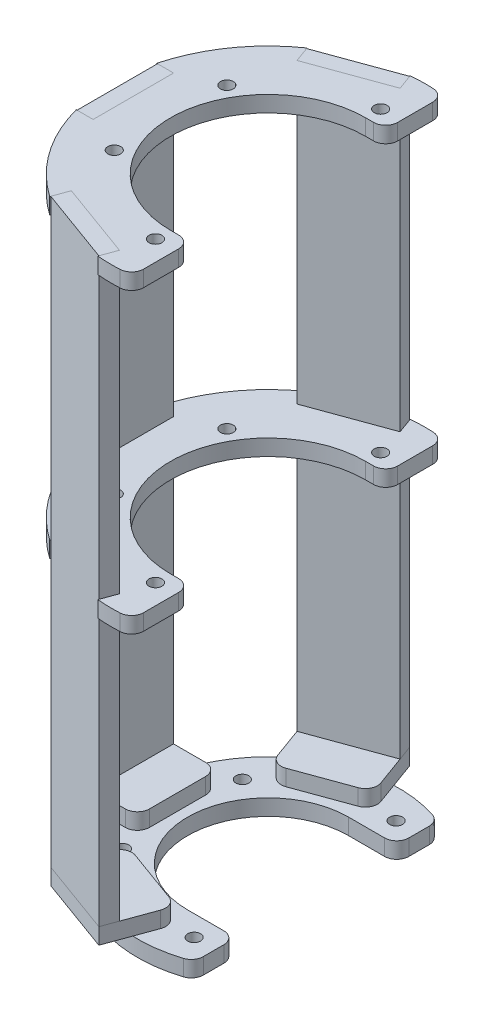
ISO-10303-21;
HEADER;
FILE_DESCRIPTION(('STEP AP214'),'2;1');
FILE_NAME('part.step','',(''),(''),'','','');
FILE_SCHEMA(('AUTOMOTIVE_DESIGN { 1 0 10303 214 1 1 1 1 }'));
ENDSEC;
DATA;
#1=APPLICATION_CONTEXT('core data for automotive mechanical design processes');
#2=APPLICATION_PROTOCOL_DEFINITION('international standard','automotive_design',2000,#1);
#3=PRODUCT_CONTEXT('',#1,'mechanical');
#4=PRODUCT('Part','Part','',(#3));
#5=PRODUCT_RELATED_PRODUCT_CATEGORY('part','',(#4));
#6=PRODUCT_DEFINITION_FORMATION('','',#4);
#7=PRODUCT_DEFINITION_CONTEXT('part definition',#1,'design');
#8=PRODUCT_DEFINITION('design','',#6,#7);
#9=PRODUCT_DEFINITION_SHAPE('','',#8);
#10=(LENGTH_UNIT() NAMED_UNIT(*) SI_UNIT(.MILLI.,.METRE.));
#11=(NAMED_UNIT(*) PLANE_ANGLE_UNIT() SI_UNIT($,.RADIAN.));
#12=(NAMED_UNIT(*) SI_UNIT($,.STERADIAN.) SOLID_ANGLE_UNIT());
#13=UNCERTAINTY_MEASURE_WITH_UNIT(LENGTH_MEASURE(1.E-05),#10,'distance_accuracy_value','');
#14=(GEOMETRIC_REPRESENTATION_CONTEXT(3) GLOBAL_UNCERTAINTY_ASSIGNED_CONTEXT((#13)) GLOBAL_UNIT_ASSIGNED_CONTEXT((#10,
#11,#12)) REPRESENTATION_CONTEXT('',''));
#15=CARTESIAN_POINT('',(0.,0.,0.));
#16=DIRECTION('',(0.,0.,1.));
#17=DIRECTION('',(1.,0.,0.));
#18=AXIS2_PLACEMENT_3D('',#15,#16,#17);
#19=CARTESIAN_POINT('',(-22.2226815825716,0.,31.818271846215));
#20=DIRECTION('',(0.93969262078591,0.,0.342020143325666));
#21=DIRECTION('',(0.,-1.,0.));
#22=AXIS2_PLACEMENT_3D('',#19,#20,#21);
#23=PLANE('',#22);
#24=DIRECTION('',(0.,-1.,0.));
#25=VECTOR('',#24,1.);
#26=CARTESIAN_POINT('',(-20.8546010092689,0.,28.0595013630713));
#27=LINE('',#26,#25);
#28=CARTESIAN_POINT('',(-20.8546010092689,0.,28.0595013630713));
#29=VERTEX_POINT('',#28);
#30=CARTESIAN_POINT('',(-20.8546010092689,-144.497747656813,28.0595013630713));
#31=VERTEX_POINT('',#30);
#32=EDGE_CURVE('E119',#29,#31,#27,.T.);
#33=ORIENTED_EDGE('',*,*,#32,.T.);
#34=DIRECTION('',(0.342020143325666,0.,-0.93969262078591));
#35=VECTOR('',#34,1.);
#36=CARTESIAN_POINT('',(-22.2226815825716,-144.497747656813,31.818271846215));
#37=LINE('',#36,#35);
#38=CARTESIAN_POINT('',(-22.2226815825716,-144.497747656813,31.818271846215));
#39=VERTEX_POINT('',#38);
#40=EDGE_CURVE('E12',#39,#31,#37,.T.);
#41=ORIENTED_EDGE('',*,*,#40,.F.);
#42=DIRECTION('',(0.,-1.,0.));
#43=VECTOR('',#42,1.);
#44=CARTESIAN_POINT('',(-22.2226815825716,0.,31.818271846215));
#45=LINE('',#44,#43);
#46=CARTESIAN_POINT('',(-22.2226815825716,0.,31.818271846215));
#47=VERTEX_POINT('',#46);
#48=EDGE_CURVE('E101',#47,#39,#45,.T.);
#49=ORIENTED_EDGE('',*,*,#48,.F.);
#50=DIRECTION('',(0.342020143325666,0.,-0.93969262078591));
#51=VECTOR('',#50,1.);
#52=CARTESIAN_POINT('',(-22.2226815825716,0.,31.818271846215));
#53=LINE('',#52,#51);
#54=EDGE_CURVE('E115',#47,#29,#53,.T.);
#55=ORIENTED_EDGE('',*,*,#54,.T.);
#56=EDGE_LOOP('',(#33,#41,#49,#55));
#57=FACE_BOUND('',#56,.T.);
#58=ADVANCED_FACE('F49',(#57),#23,.F.);
#59=CARTESIAN_POINT('',(-22.2226815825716,-144.497747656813,31.818271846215));
#60=DIRECTION('',(0.,1.,0.));
#61=DIRECTION('',(0.93969262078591,0.,0.342020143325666));
#62=AXIS2_PLACEMENT_3D('',#59,#60,#61);
#63=PLANE('',#62);
#64=DIRECTION('',(0.93969262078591,0.,0.342020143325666));
#65=VECTOR('',#64,1.);
#66=CARTESIAN_POINT('',(-20.8546010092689,-144.497747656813,28.0595013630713));
#67=LINE('',#66,#65);
#68=CARTESIAN_POINT('',(-2.06074859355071,-144.497747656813,34.8999042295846));
#69=VERTEX_POINT('',#68);
#70=EDGE_CURVE('E106',#31,#69,#67,.T.);
#71=ORIENTED_EDGE('',*,*,#70,.T.);
#72=DIRECTION('',(0.342020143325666,0.,-0.93969262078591));
#73=VECTOR('',#72,1.);
#74=CARTESIAN_POINT('',(-3.42882916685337,-144.497747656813,38.6586747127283));
#75=LINE('',#74,#73);
#76=CARTESIAN_POINT('',(-3.42882916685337,-144.497747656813,38.6586747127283));
#77=VERTEX_POINT('',#76);
#78=EDGE_CURVE('E58',#77,#69,#75,.T.);
#79=ORIENTED_EDGE('',*,*,#78,.F.);
#80=DIRECTION('',(0.93969262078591,0.,0.342020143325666));
#81=VECTOR('',#80,1.);
#82=CARTESIAN_POINT('',(-22.2226815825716,-144.497747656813,31.818271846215));
#83=LINE('',#82,#81);
#84=EDGE_CURVE('E96',#39,#77,#83,.T.);
#85=ORIENTED_EDGE('',*,*,#84,.F.);
#86=ORIENTED_EDGE('',*,*,#40,.T.);
#87=EDGE_LOOP('',(#71,#79,#85,#86));
#88=FACE_BOUND('',#87,.T.);
#89=ADVANCED_FACE('F105',(#88),#63,.F.);
#90=CARTESIAN_POINT('',(-3.42882916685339,0.,38.6586747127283));
#91=DIRECTION('',(-0.93969262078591,0.,-0.342020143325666));
#92=DIRECTION('',(0.,1.,0.));
#93=AXIS2_PLACEMENT_3D('',#90,#91,#92);
#94=PLANE('',#93);
#95=DIRECTION('',(0.,1.,0.));
#96=VECTOR('',#95,1.);
#97=CARTESIAN_POINT('',(-2.06074859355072,0.,34.8999042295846));
#98=LINE('',#97,#96);
#99=CARTESIAN_POINT('',(-2.06074859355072,0.,34.8999042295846));
#100=VERTEX_POINT('',#99);
#101=EDGE_CURVE('E83',#69,#100,#98,.T.);
#102=ORIENTED_EDGE('',*,*,#101,.T.);
#103=DIRECTION('',(0.342020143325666,0.,-0.93969262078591));
#104=VECTOR('',#103,1.);
#105=CARTESIAN_POINT('',(-3.42882916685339,0.,38.6586747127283));
#106=LINE('',#105,#104);
#107=CARTESIAN_POINT('',(-3.42882916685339,0.,38.6586747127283));
#108=VERTEX_POINT('',#107);
#109=EDGE_CURVE('E108',#108,#100,#106,.T.);
#110=ORIENTED_EDGE('',*,*,#109,.F.);
#111=DIRECTION('',(0.,1.,0.));
#112=VECTOR('',#111,1.);
#113=CARTESIAN_POINT('',(-3.42882916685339,0.,38.6586747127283));
#114=LINE('',#113,#112);
#115=EDGE_CURVE('E99',#77,#108,#114,.T.);
#116=ORIENTED_EDGE('',*,*,#115,.F.);
#117=ORIENTED_EDGE('',*,*,#78,.T.);
#118=EDGE_LOOP('',(#102,#110,#116,#117));
#119=FACE_BOUND('',#118,.T.);
#120=ADVANCED_FACE('F109',(#119),#94,.F.);
#121=CARTESIAN_POINT('',(-22.2226815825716,0.,31.818271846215));
#122=DIRECTION('',(0.,-1.,0.));
#123=DIRECTION('',(-0.93969262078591,0.,-0.342020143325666));
#124=AXIS2_PLACEMENT_3D('',#121,#122,#123);
#125=PLANE('',#124);
#126=DIRECTION('',(-0.93969262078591,0.,-0.342020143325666));
#127=VECTOR('',#126,1.);
#128=CARTESIAN_POINT('',(-20.8546010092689,0.,28.0595013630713));
#129=LINE('',#128,#127);
#130=EDGE_CURVE('E89',#100,#29,#129,.T.);
#131=ORIENTED_EDGE('',*,*,#130,.T.);
#132=ORIENTED_EDGE('',*,*,#54,.F.);
#133=DIRECTION('',(-0.93969262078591,0.,-0.342020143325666));
#134=VECTOR('',#133,1.);
#135=CARTESIAN_POINT('',(-22.2226815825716,0.,31.818271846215));
#136=LINE('',#135,#134);
#137=EDGE_CURVE('E66',#108,#47,#136,.T.);
#138=ORIENTED_EDGE('',*,*,#137,.F.);
#139=ORIENTED_EDGE('',*,*,#109,.T.);
#140=EDGE_LOOP('',(#131,#132,#138,#139));
#141=FACE_BOUND('',#140,.T.);
#142=ADVANCED_FACE('F130',(#141),#125,.F.);
#143=CARTESIAN_POINT('',(-12.8257553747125,0.,35.2384732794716));
#144=DIRECTION('',(-0.342020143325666,0.,0.93969262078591));
#145=DIRECTION('',(0.93969262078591,0.,0.342020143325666));
#146=AXIS2_PLACEMENT_3D('',#143,#144,#145);
#147=PLANE('',#146);
#148=ORIENTED_EDGE('',*,*,#48,.T.);
#149=ORIENTED_EDGE('',*,*,#84,.T.);
#150=ORIENTED_EDGE('',*,*,#115,.T.);
#151=ORIENTED_EDGE('',*,*,#137,.T.);
#152=EDGE_LOOP('',(#148,#149,#150,#151));
#153=FACE_BOUND('',#152,.T.);
#154=ADVANCED_FACE('F97',(#153),#147,.T.);
#155=CARTESIAN_POINT('',(-11.4576748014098,0.,31.479702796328));
#156=DIRECTION('',(-0.342020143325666,0.,0.93969262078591));
#157=DIRECTION('',(0.93969262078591,0.,0.342020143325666));
#158=AXIS2_PLACEMENT_3D('',#155,#156,#157);
#159=PLANE('',#158);
#160=ORIENTED_EDGE('',*,*,#32,.F.);
#161=ORIENTED_EDGE('',*,*,#130,.F.);
#162=ORIENTED_EDGE('',*,*,#101,.F.);
#163=ORIENTED_EDGE('',*,*,#70,.F.);
#164=EDGE_LOOP('',(#160,#161,#162,#163));
#165=FACE_BOUND('',#164,.T.);
#166=ADVANCED_FACE('F133',(#165),#159,.F.);
#167=CLOSED_SHELL('',(#58,#89,#120,#142,#154,#166));
#168=MANIFOLD_SOLID_BREP('B2',#167);
#169=CARTESIAN_POINT('',(-3.42882916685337,-148.497747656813,38.6586747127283));
#170=DIRECTION('',(0.342020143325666,0.,-0.93969262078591));
#171=DIRECTION('',(-0.93969262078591,0.,-0.342020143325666));
#172=AXIS2_PLACEMENT_3D('',#169,#170,#171);
#173=PLANE('',#172);
#174=DIRECTION('',(-0.93969262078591,0.,-0.342020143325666));
#175=VECTOR('',#174,1.);
#176=CARTESIAN_POINT('',(-3.42882916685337,-144.497747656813,38.6586747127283));
#177=LINE('',#176,#175);
#178=CARTESIAN_POINT('',(-3.42882916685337,-144.497747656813,38.6586747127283));
#179=VERTEX_POINT('',#178);
#180=CARTESIAN_POINT('',(-22.2226815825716,-144.497747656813,31.818271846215));
#181=VERTEX_POINT('',#180);
#182=EDGE_CURVE('E275',#179,#181,#177,.T.);
#183=ORIENTED_EDGE('',*,*,#182,.T.);
#184=DIRECTION('',(0.,1.,0.));
#185=VECTOR('',#184,1.);
#186=CARTESIAN_POINT('',(-22.2226815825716,-148.497747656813,31.818271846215));
#187=LINE('',#186,#185);
#188=CARTESIAN_POINT('',(-22.2226815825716,-148.497747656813,31.818271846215));
#189=VERTEX_POINT('',#188);
#190=EDGE_CURVE('E258',#189,#181,#187,.T.);
#191=ORIENTED_EDGE('',*,*,#190,.F.);
#192=DIRECTION('',(-0.93969262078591,0.,-0.342020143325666));
#193=VECTOR('',#192,1.);
#194=CARTESIAN_POINT('',(-3.42882916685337,-148.497747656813,38.6586747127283));
#195=LINE('',#194,#193);
#196=CARTESIAN_POINT('',(-3.42882916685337,-148.497747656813,38.6586747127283));
#197=VERTEX_POINT('',#196);
#198=EDGE_CURVE('E263',#197,#189,#195,.T.);
#199=ORIENTED_EDGE('',*,*,#198,.F.);
#200=DIRECTION('',(0.,1.,0.));
#201=VECTOR('',#200,1.);
#202=CARTESIAN_POINT('',(-3.42882916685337,-148.497747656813,38.6586747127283));
#203=LINE('',#202,#201);
#204=EDGE_CURVE('E278',#197,#179,#203,.T.);
#205=ORIENTED_EDGE('',*,*,#204,.T.);
#206=EDGE_LOOP('',(#183,#191,#199,#205));
#207=FACE_BOUND('',#206,.T.);
#208=ADVANCED_FACE('F200',(#207),#173,.F.);
#209=CARTESIAN_POINT('',(-22.2226815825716,-148.497747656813,31.818271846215));
#210=DIRECTION('',(0.93969262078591,0.,0.342020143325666));
#211=DIRECTION('',(0.342020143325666,0.,-0.93969262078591));
#212=AXIS2_PLACEMENT_3D('',#209,#210,#211);
#213=PLANE('',#212);
#214=DIRECTION('',(0.342020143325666,0.,-0.93969262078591));
#215=VECTOR('',#214,1.);
#216=CARTESIAN_POINT('',(-22.2226815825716,-144.497747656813,31.818271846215));
#217=LINE('',#216,#215);
#218=CARTESIAN_POINT('',(-18.1184398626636,-144.497747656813,20.541960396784));
#219=VERTEX_POINT('',#218);
#220=EDGE_CURVE('E314',#181,#219,#217,.T.);
#221=ORIENTED_EDGE('',*,*,#220,.T.);
#222=DIRECTION('',(0.,1.,0.));
#223=VECTOR('',#222,1.);
#224=CARTESIAN_POINT('',(-18.1184398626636,-148.497747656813,20.541960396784));
#225=LINE('',#224,#223);
#226=CARTESIAN_POINT('',(-18.1184398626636,-148.497747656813,20.541960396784));
#227=VERTEX_POINT('',#226);
#228=EDGE_CURVE('E224',#219,#227,#225,.F.);
#229=ORIENTED_EDGE('',*,*,#228,.T.);
#230=DIRECTION('',(0.342020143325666,0.,-0.93969262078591));
#231=VECTOR('',#230,1.);
#232=CARTESIAN_POINT('',(-22.2226815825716,-148.497747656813,31.818271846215));
#233=LINE('',#232,#231);
#234=EDGE_CURVE('E254',#189,#227,#233,.T.);
#235=ORIENTED_EDGE('',*,*,#234,.F.);
#236=ORIENTED_EDGE('',*,*,#190,.T.);
#237=EDGE_LOOP('',(#221,#229,#235,#236));
#238=FACE_BOUND('',#237,.T.);
#239=ADVANCED_FACE('F256',(#238),#213,.F.);
#240=CARTESIAN_POINT('',(1.70147298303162,-148.497747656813,24.5632854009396));
#241=DIRECTION('',(-0.342020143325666,0.,0.939692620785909));
#242=DIRECTION('',(0.939692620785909,0.,0.342020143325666));
#243=AXIS2_PLACEMENT_3D('',#240,#241,#242);
#244=PLANE('',#243);
#245=DIRECTION('',(0.939692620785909,0.,0.342020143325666));
#246=VECTOR('',#245,1.);
#247=CARTESIAN_POINT('',(1.70147298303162,-148.497747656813,24.5632854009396));
#248=LINE('',#247,#246);
#249=CARTESIAN_POINT('',(-14.2733015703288,-148.497747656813,18.7489429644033));
#250=VERTEX_POINT('',#249);
#251=CARTESIAN_POINT('',(-1.11760487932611,-148.497747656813,23.5372249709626));
#252=VERTEX_POINT('',#251);
#253=EDGE_CURVE('E262',#250,#252,#248,.T.);
#254=ORIENTED_EDGE('',*,*,#253,.F.);
#255=DIRECTION('',(0.,1.,0.));
#256=VECTOR('',#255,1.);
#257=CARTESIAN_POINT('',(-14.2733015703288,-148.497747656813,18.7489429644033));
#258=LINE('',#257,#256);
#259=CARTESIAN_POINT('',(-14.2733015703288,-144.497747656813,18.7489429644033));
#260=VERTEX_POINT('',#259);
#261=EDGE_CURVE('E282',#250,#260,#258,.T.);
#262=ORIENTED_EDGE('',*,*,#261,.T.);
#263=DIRECTION('',(0.939692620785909,0.,0.342020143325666));
#264=VECTOR('',#263,1.);
#265=CARTESIAN_POINT('',(1.70147298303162,-144.497747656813,24.5632854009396));
#266=LINE('',#265,#264);
#267=CARTESIAN_POINT('',(-1.11760487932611,-144.497747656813,23.5372249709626));
#268=VERTEX_POINT('',#267);
#269=EDGE_CURVE('E315',#260,#268,#266,.T.);
#270=ORIENTED_EDGE('',*,*,#269,.T.);
#271=DIRECTION('',(0.,1.,0.));
#272=VECTOR('',#271,1.);
#273=CARTESIAN_POINT('',(-1.11760487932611,-148.497747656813,23.5372249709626));
#274=LINE('',#273,#272);
#275=EDGE_CURVE('E277',#268,#252,#274,.F.);
#276=ORIENTED_EDGE('',*,*,#275,.T.);
#277=EDGE_LOOP('',(#254,#262,#270,#276));
#278=FACE_BOUND('',#277,.T.);
#279=ADVANCED_FACE('F305',(#278),#244,.F.);
#280=CARTESIAN_POINT('',(-3.42882916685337,-148.497747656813,38.6586747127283));
#281=DIRECTION('',(-0.93969262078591,0.,-0.342020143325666));
#282=DIRECTION('',(-0.342020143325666,0.,0.93969262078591));
#283=AXIS2_PLACEMENT_3D('',#280,#281,#282);
#284=PLANE('',#283);
#285=DIRECTION('',(-0.342020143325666,0.,0.93969262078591));
#286=VECTOR('',#285,1.);
#287=CARTESIAN_POINT('',(-3.42882916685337,-148.497747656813,38.6586747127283));
#288=LINE('',#287,#286);
#289=CARTESIAN_POINT('',(0.67541255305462,-148.497747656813,27.3823632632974));
#290=VERTEX_POINT('',#289);
#291=EDGE_CURVE('E267',#290,#197,#288,.T.);
#292=ORIENTED_EDGE('',*,*,#291,.F.);
#293=DIRECTION('',(0.,1.,0.));
#294=VECTOR('',#293,1.);
#295=CARTESIAN_POINT('',(0.675412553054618,-148.497747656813,27.3823632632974));
#296=LINE('',#295,#294);
#297=CARTESIAN_POINT('',(0.67541255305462,-144.497747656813,27.3823632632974));
#298=VERTEX_POINT('',#297);
#299=EDGE_CURVE('E47',#290,#298,#296,.T.);
#300=ORIENTED_EDGE('',*,*,#299,.T.);
#301=DIRECTION('',(-0.342020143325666,0.,0.93969262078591));
#302=VECTOR('',#301,1.);
#303=CARTESIAN_POINT('',(-3.42882916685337,-144.497747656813,38.6586747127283));
#304=LINE('',#303,#302);
#305=EDGE_CURVE('E272',#298,#179,#304,.T.);
#306=ORIENTED_EDGE('',*,*,#305,.T.);
#307=ORIENTED_EDGE('',*,*,#204,.F.);
#308=EDGE_LOOP('',(#292,#300,#306,#307));
#309=FACE_BOUND('',#308,.T.);
#310=ADVANCED_FACE('F326',(#309),#284,.F.);
#311=CARTESIAN_POINT('',(0.,-148.497747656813,0.));
#312=DIRECTION('',(0.,-1.,0.));
#313=DIRECTION('',(-0.93969262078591,0.,-0.342020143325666));
#314=AXIS2_PLACEMENT_3D('',#311,#312,#313);
#315=PLANE('',#314);
#316=ORIENTED_EDGE('',*,*,#234,.T.);
#317=CARTESIAN_POINT('',(-15.2993620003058,-148.497747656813,21.568020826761));
#318=DIRECTION('',(0.,-1.,0.));
#319=DIRECTION('',(0.,0.,-1.));
#320=AXIS2_PLACEMENT_3D('',#317,#318,#319);
#321=CIRCLE('',#320,3.);
#322=EDGE_CURVE('E209',#227,#250,#321,.T.);
#323=ORIENTED_EDGE('',*,*,#322,.T.);
#324=ORIENTED_EDGE('',*,*,#253,.T.);
#325=CARTESIAN_POINT('',(-2.14366530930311,-148.497747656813,26.3563028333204));
#326=DIRECTION('',(0.,-1.,0.));
#327=DIRECTION('',(0.,0.,-1.));
#328=AXIS2_PLACEMENT_3D('',#325,#326,#327);
#329=CIRCLE('',#328,3.);
#330=EDGE_CURVE('E216',#252,#290,#329,.T.);
#331=ORIENTED_EDGE('',*,*,#330,.T.);
#332=ORIENTED_EDGE('',*,*,#291,.T.);
#333=ORIENTED_EDGE('',*,*,#198,.T.);
#334=EDGE_LOOP('',(#316,#323,#324,#331,#332,#333));
#335=FACE_BOUND('',#334,.T.);
#336=ADVANCED_FACE('F266',(#335),#315,.T.);
#337=CARTESIAN_POINT('',(0.,-144.497747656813,0.));
#338=DIRECTION('',(0.,-1.,0.));
#339=DIRECTION('',(-0.93969262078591,0.,-0.342020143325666));
#340=AXIS2_PLACEMENT_3D('',#337,#338,#339);
#341=PLANE('',#340);
#342=ORIENTED_EDGE('',*,*,#269,.F.);
#343=CARTESIAN_POINT('',(-15.2993620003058,-144.497747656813,21.568020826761));
#344=DIRECTION('',(0.,-1.,0.));
#345=DIRECTION('',(0.,0.,-1.));
#346=AXIS2_PLACEMENT_3D('',#343,#344,#345);
#347=CIRCLE('',#346,3.);
#348=EDGE_CURVE('E294',#260,#219,#347,.F.);
#349=ORIENTED_EDGE('',*,*,#348,.T.);
#350=ORIENTED_EDGE('',*,*,#220,.F.);
#351=ORIENTED_EDGE('',*,*,#182,.F.);
#352=ORIENTED_EDGE('',*,*,#305,.F.);
#353=CARTESIAN_POINT('',(-2.14366530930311,-144.497747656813,26.3563028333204));
#354=DIRECTION('',(0.,-1.,0.));
#355=DIRECTION('',(0.,0.,-1.));
#356=AXIS2_PLACEMENT_3D('',#353,#354,#355);
#357=CIRCLE('',#356,3.);
#358=EDGE_CURVE('E291',#298,#268,#357,.F.);
#359=ORIENTED_EDGE('',*,*,#358,.T.);
#360=EDGE_LOOP('',(#342,#349,#350,#351,#352,#359));
#361=FACE_BOUND('',#360,.T.);
#362=ADVANCED_FACE('F313',(#361),#341,.F.);
#363=CARTESIAN_POINT('',(-15.2993620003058,-148.497747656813,21.568020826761));
#364=DIRECTION('',(0.,1.,0.));
#365=DIRECTION('',(0.,0.,1.));
#366=AXIS2_PLACEMENT_3D('',#363,#364,#365);
#367=CYLINDRICAL_SURFACE('',#366,3.);
#368=ORIENTED_EDGE('',*,*,#322,.F.);
#369=ORIENTED_EDGE('',*,*,#228,.F.);
#370=ORIENTED_EDGE('',*,*,#348,.F.);
#371=ORIENTED_EDGE('',*,*,#261,.F.);
#372=EDGE_LOOP('',(#368,#369,#370,#371));
#373=FACE_BOUND('',#372,.T.);
#374=ADVANCED_FACE('F311',(#373),#367,.T.);
#375=CARTESIAN_POINT('',(-2.14366530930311,-148.497747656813,26.3563028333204));
#376=DIRECTION('',(0.,1.,0.));
#377=DIRECTION('',(0.,0.,1.));
#378=AXIS2_PLACEMENT_3D('',#375,#376,#377);
#379=CYLINDRICAL_SURFACE('',#378,3.);
#380=ORIENTED_EDGE('',*,*,#330,.F.);
#381=ORIENTED_EDGE('',*,*,#275,.F.);
#382=ORIENTED_EDGE('',*,*,#358,.F.);
#383=ORIENTED_EDGE('',*,*,#299,.F.);
#384=EDGE_LOOP('',(#380,#381,#382,#383));
#385=FACE_BOUND('',#384,.T.);
#386=ADVANCED_FACE('F202',(#385),#379,.T.);
#387=CLOSED_SHELL('',(#208,#239,#279,#310,#336,#362,#374,#386));
#388=MANIFOLD_SOLID_BREP('B6',#387);
#389=CARTESIAN_POINT('',(-3.42882916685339,0.,-38.6586747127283));
#390=DIRECTION('',(-0.93969262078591,0.,0.342020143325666));
#391=DIRECTION('',(0.,-1.,0.));
#392=AXIS2_PLACEMENT_3D('',#389,#390,#391);
#393=PLANE('',#392);
#394=DIRECTION('',(0.,-1.,0.));
#395=VECTOR('',#394,1.);
#396=CARTESIAN_POINT('',(-2.06074859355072,0.,-34.8999042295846));
#397=LINE('',#396,#395);
#398=CARTESIAN_POINT('',(-2.06074859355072,0.,-34.8999042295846));
#399=VERTEX_POINT('',#398);
#400=CARTESIAN_POINT('',(-2.06074859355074,-144.497747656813,-34.8999042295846));
#401=VERTEX_POINT('',#400);
#402=EDGE_CURVE('E485',#399,#401,#397,.T.);
#403=ORIENTED_EDGE('',*,*,#402,.T.);
#404=DIRECTION('',(0.342020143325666,0.,0.93969262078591));
#405=VECTOR('',#404,1.);
#406=CARTESIAN_POINT('',(-3.42882916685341,-144.497747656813,-38.6586747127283));
#407=LINE('',#406,#405);
#408=CARTESIAN_POINT('',(-3.42882916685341,-144.497747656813,-38.6586747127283));
#409=VERTEX_POINT('',#408);
#410=EDGE_CURVE('E198',#409,#401,#407,.T.);
#411=ORIENTED_EDGE('',*,*,#410,.F.);
#412=DIRECTION('',(0.,-1.,0.));
#413=VECTOR('',#412,1.);
#414=CARTESIAN_POINT('',(-3.42882916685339,0.,-38.6586747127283));
#415=LINE('',#414,#413);
#416=CARTESIAN_POINT('',(-3.42882916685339,0.,-38.6586747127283));
#417=VERTEX_POINT('',#416);
#418=EDGE_CURVE('E467',#417,#409,#415,.T.);
#419=ORIENTED_EDGE('',*,*,#418,.F.);
#420=DIRECTION('',(0.342020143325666,0.,0.93969262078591));
#421=VECTOR('',#420,1.);
#422=CARTESIAN_POINT('',(-3.42882916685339,0.,-38.6586747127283));
#423=LINE('',#422,#421);
#424=EDGE_CURVE('E481',#417,#399,#423,.T.);
#425=ORIENTED_EDGE('',*,*,#424,.T.);
#426=EDGE_LOOP('',(#403,#411,#419,#425));
#427=FACE_BOUND('',#426,.T.);
#428=ADVANCED_FACE('F415',(#427),#393,.F.);
#429=CARTESIAN_POINT('',(-3.42882916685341,-144.497747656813,-38.6586747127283));
#430=DIRECTION('',(0.,1.,0.));
#431=DIRECTION('',(-0.93969262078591,0.,0.342020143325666));
#432=AXIS2_PLACEMENT_3D('',#429,#430,#431);
#433=PLANE('',#432);
#434=DIRECTION('',(-0.93969262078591,0.,0.342020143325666));
#435=VECTOR('',#434,1.);
#436=CARTESIAN_POINT('',(-2.06074859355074,-144.497747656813,-34.8999042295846));
#437=LINE('',#436,#435);
#438=CARTESIAN_POINT('',(-20.8546010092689,-144.497747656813,-28.0595013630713));
#439=VERTEX_POINT('',#438);
#440=EDGE_CURVE('E472',#401,#439,#437,.T.);
#441=ORIENTED_EDGE('',*,*,#440,.T.);
#442=DIRECTION('',(0.342020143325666,0.,0.93969262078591));
#443=VECTOR('',#442,1.);
#444=CARTESIAN_POINT('',(-22.2226815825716,-144.497747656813,-31.8182718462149));
#445=LINE('',#444,#443);
#446=CARTESIAN_POINT('',(-22.2226815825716,-144.497747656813,-31.8182718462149));
#447=VERTEX_POINT('',#446);
#448=EDGE_CURVE('E424',#447,#439,#445,.T.);
#449=ORIENTED_EDGE('',*,*,#448,.F.);
#450=DIRECTION('',(-0.93969262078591,0.,0.342020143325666));
#451=VECTOR('',#450,1.);
#452=CARTESIAN_POINT('',(-3.42882916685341,-144.497747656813,-38.6586747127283));
#453=LINE('',#452,#451);
#454=EDGE_CURVE('E462',#409,#447,#453,.T.);
#455=ORIENTED_EDGE('',*,*,#454,.F.);
#456=ORIENTED_EDGE('',*,*,#410,.T.);
#457=EDGE_LOOP('',(#441,#449,#455,#456));
#458=FACE_BOUND('',#457,.T.);
#459=ADVANCED_FACE('F471',(#458),#433,.F.);
#460=CARTESIAN_POINT('',(-22.2226815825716,0.,-31.818271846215));
#461=DIRECTION('',(0.93969262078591,0.,-0.342020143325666));
#462=DIRECTION('',(0.,1.,0.));
#463=AXIS2_PLACEMENT_3D('',#460,#461,#462);
#464=PLANE('',#463);
#465=DIRECTION('',(0.,1.,0.));
#466=VECTOR('',#465,1.);
#467=CARTESIAN_POINT('',(-20.8546010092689,0.,-28.0595013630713));
#468=LINE('',#467,#466);
#469=CARTESIAN_POINT('',(-20.8546010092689,0.,-28.0595013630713));
#470=VERTEX_POINT('',#469);
#471=EDGE_CURVE('E449',#439,#470,#468,.T.);
#472=ORIENTED_EDGE('',*,*,#471,.T.);
#473=DIRECTION('',(0.342020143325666,0.,0.93969262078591));
#474=VECTOR('',#473,1.);
#475=CARTESIAN_POINT('',(-22.2226815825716,0.,-31.818271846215));
#476=LINE('',#475,#474);
#477=CARTESIAN_POINT('',(-22.2226815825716,0.,-31.818271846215));
#478=VERTEX_POINT('',#477);
#479=EDGE_CURVE('E474',#478,#470,#476,.T.);
#480=ORIENTED_EDGE('',*,*,#479,.F.);
#481=DIRECTION('',(0.,1.,0.));
#482=VECTOR('',#481,1.);
#483=CARTESIAN_POINT('',(-22.2226815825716,0.,-31.818271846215));
#484=LINE('',#483,#482);
#485=EDGE_CURVE('E465',#447,#478,#484,.T.);
#486=ORIENTED_EDGE('',*,*,#485,.F.);
#487=ORIENTED_EDGE('',*,*,#448,.T.);
#488=EDGE_LOOP('',(#472,#480,#486,#487));
#489=FACE_BOUND('',#488,.T.);
#490=ADVANCED_FACE('F475',(#489),#464,.F.);
#491=CARTESIAN_POINT('',(-3.42882916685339,0.,-38.6586747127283));
#492=DIRECTION('',(0.,-1.,0.));
#493=DIRECTION('',(0.93969262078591,0.,-0.342020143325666));
#494=AXIS2_PLACEMENT_3D('',#491,#492,#493);
#495=PLANE('',#494);
#496=DIRECTION('',(0.93969262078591,0.,-0.342020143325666));
#497=VECTOR('',#496,1.);
#498=CARTESIAN_POINT('',(-2.06074859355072,0.,-34.8999042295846));
#499=LINE('',#498,#497);
#500=EDGE_CURVE('E455',#470,#399,#499,.T.);
#501=ORIENTED_EDGE('',*,*,#500,.T.);
#502=ORIENTED_EDGE('',*,*,#424,.F.);
#503=DIRECTION('',(0.93969262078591,0.,-0.342020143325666));
#504=VECTOR('',#503,1.);
#505=CARTESIAN_POINT('',(-3.42882916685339,0.,-38.6586747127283));
#506=LINE('',#505,#504);
#507=EDGE_CURVE('E432',#478,#417,#506,.T.);
#508=ORIENTED_EDGE('',*,*,#507,.F.);
#509=ORIENTED_EDGE('',*,*,#479,.T.);
#510=EDGE_LOOP('',(#501,#502,#508,#509));
#511=FACE_BOUND('',#510,.T.);
#512=ADVANCED_FACE('F496',(#511),#495,.F.);
#513=CARTESIAN_POINT('',(-12.8257553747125,0.,-35.2384732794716));
#514=DIRECTION('',(-0.342020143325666,0.,-0.93969262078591));
#515=DIRECTION('',(-0.93969262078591,0.,0.342020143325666));
#516=AXIS2_PLACEMENT_3D('',#513,#514,#515);
#517=PLANE('',#516);
#518=ORIENTED_EDGE('',*,*,#418,.T.);
#519=ORIENTED_EDGE('',*,*,#454,.T.);
#520=ORIENTED_EDGE('',*,*,#485,.T.);
#521=ORIENTED_EDGE('',*,*,#507,.T.);
#522=EDGE_LOOP('',(#518,#519,#520,#521));
#523=FACE_BOUND('',#522,.T.);
#524=ADVANCED_FACE('F463',(#523),#517,.T.);
#525=CARTESIAN_POINT('',(-11.4576748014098,0.,-31.479702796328));
#526=DIRECTION('',(-0.342020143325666,0.,-0.93969262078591));
#527=DIRECTION('',(-0.93969262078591,0.,0.342020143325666));
#528=AXIS2_PLACEMENT_3D('',#525,#526,#527);
#529=PLANE('',#528);
#530=ORIENTED_EDGE('',*,*,#402,.F.);
#531=ORIENTED_EDGE('',*,*,#500,.F.);
#532=ORIENTED_EDGE('',*,*,#471,.F.);
#533=ORIENTED_EDGE('',*,*,#440,.F.);
#534=EDGE_LOOP('',(#530,#531,#532,#533));
#535=FACE_BOUND('',#534,.T.);
#536=ADVANCED_FACE('F499',(#535),#529,.F.);
#537=CLOSED_SHELL('',(#428,#459,#490,#512,#524,#536));
#538=MANIFOLD_SOLID_BREP('B41',#537);
#539=CARTESIAN_POINT('',(-22.2226815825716,-148.497747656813,-31.8182718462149));
#540=DIRECTION('',(0.342020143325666,0.,0.93969262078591));
#541=DIRECTION('',(0.93969262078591,0.,-0.342020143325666));
#542=AXIS2_PLACEMENT_3D('',#539,#540,#541);
#543=PLANE('',#542);
#544=DIRECTION('',(0.93969262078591,0.,-0.342020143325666));
#545=VECTOR('',#544,1.);
#546=CARTESIAN_POINT('',(-22.2226815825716,-144.497747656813,-31.8182718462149));
#547=LINE('',#546,#545);
#548=CARTESIAN_POINT('',(-22.2226815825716,-144.497747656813,-31.8182718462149));
#549=VERTEX_POINT('',#548);
#550=CARTESIAN_POINT('',(-3.42882916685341,-144.497747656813,-38.6586747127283));
#551=VERTEX_POINT('',#550);
#552=EDGE_CURVE('E641',#549,#551,#547,.T.);
#553=ORIENTED_EDGE('',*,*,#552,.T.);
#554=DIRECTION('',(0.,1.,0.));
#555=VECTOR('',#554,1.);
#556=CARTESIAN_POINT('',(-3.42882916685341,-148.497747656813,-38.6586747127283));
#557=LINE('',#556,#555);
#558=CARTESIAN_POINT('',(-3.42882916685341,-148.497747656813,-38.6586747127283));
#559=VERTEX_POINT('',#558);
#560=EDGE_CURVE('E624',#559,#551,#557,.T.);
#561=ORIENTED_EDGE('',*,*,#560,.F.);
#562=DIRECTION('',(0.93969262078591,0.,-0.342020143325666));
#563=VECTOR('',#562,1.);
#564=CARTESIAN_POINT('',(-22.2226815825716,-148.497747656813,-31.8182718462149));
#565=LINE('',#564,#563);
#566=CARTESIAN_POINT('',(-22.2226815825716,-148.497747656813,-31.8182718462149));
#567=VERTEX_POINT('',#566);
#568=EDGE_CURVE('E629',#567,#559,#565,.T.);
#569=ORIENTED_EDGE('',*,*,#568,.F.);
#570=DIRECTION('',(0.,1.,0.));
#571=VECTOR('',#570,1.);
#572=CARTESIAN_POINT('',(-22.2226815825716,-148.497747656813,-31.8182718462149));
#573=LINE('',#572,#571);
#574=EDGE_CURVE('E644',#567,#549,#573,.T.);
#575=ORIENTED_EDGE('',*,*,#574,.T.);
#576=EDGE_LOOP('',(#553,#561,#569,#575));
#577=FACE_BOUND('',#576,.T.);
#578=ADVANCED_FACE('F566',(#577),#543,.F.);
#579=CARTESIAN_POINT('',(-3.42882916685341,-148.497747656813,-38.6586747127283));
#580=DIRECTION('',(-0.93969262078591,0.,0.342020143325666));
#581=DIRECTION('',(0.342020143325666,0.,0.93969262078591));
#582=AXIS2_PLACEMENT_3D('',#579,#580,#581);
#583=PLANE('',#582);
#584=DIRECTION('',(0.342020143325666,0.,0.93969262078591));
#585=VECTOR('',#584,1.);
#586=CARTESIAN_POINT('',(-3.42882916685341,-144.497747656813,-38.6586747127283));
#587=LINE('',#586,#585);
#588=CARTESIAN_POINT('',(0.675412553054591,-144.497747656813,-27.3823632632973));
#589=VERTEX_POINT('',#588);
#590=EDGE_CURVE('E682',#551,#589,#587,.T.);
#591=ORIENTED_EDGE('',*,*,#590,.T.);
#592=DIRECTION('',(0.,1.,0.));
#593=VECTOR('',#592,1.);
#594=CARTESIAN_POINT('',(0.675412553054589,-148.497747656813,-27.3823632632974));
#595=LINE('',#594,#593);
#596=CARTESIAN_POINT('',(0.675412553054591,-148.497747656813,-27.3823632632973));
#597=VERTEX_POINT('',#596);
#598=EDGE_CURVE('E590',#589,#597,#595,.F.);
#599=ORIENTED_EDGE('',*,*,#598,.T.);
#600=DIRECTION('',(0.342020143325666,0.,0.93969262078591));
#601=VECTOR('',#600,1.);
#602=CARTESIAN_POINT('',(-3.42882916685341,-148.497747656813,-38.6586747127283));
#603=LINE('',#602,#601);
#604=EDGE_CURVE('E620',#559,#597,#603,.T.);
#605=ORIENTED_EDGE('',*,*,#604,.F.);
#606=ORIENTED_EDGE('',*,*,#560,.T.);
#607=EDGE_LOOP('',(#591,#599,#605,#606));
#608=FACE_BOUND('',#607,.T.);
#609=ADVANCED_FACE('F622',(#608),#583,.F.);
#610=CARTESIAN_POINT('',(-17.0923794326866,-148.497747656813,-17.7228825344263));
#611=DIRECTION('',(-0.342020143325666,0.,-0.93969262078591));
#612=DIRECTION('',(-0.93969262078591,0.,0.342020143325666));
#613=AXIS2_PLACEMENT_3D('',#610,#611,#612);
#614=PLANE('',#613);
#615=DIRECTION('',(-0.93969262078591,0.,0.342020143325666));
#616=VECTOR('',#615,1.);
#617=CARTESIAN_POINT('',(-17.0923794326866,-148.497747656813,-17.7228825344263));
#618=LINE('',#617,#616);
#619=CARTESIAN_POINT('',(-1.11760487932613,-148.497747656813,-23.5372249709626));
#620=VERTEX_POINT('',#619);
#621=CARTESIAN_POINT('',(-14.2733015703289,-148.497747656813,-18.7489429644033));
#622=VERTEX_POINT('',#621);
#623=EDGE_CURVE('E628',#620,#622,#618,.T.);
#624=ORIENTED_EDGE('',*,*,#623,.F.);
#625=DIRECTION('',(0.,1.,0.));
#626=VECTOR('',#625,1.);
#627=CARTESIAN_POINT('',(-1.11760487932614,-148.497747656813,-23.5372249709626));
#628=LINE('',#627,#626);
#629=CARTESIAN_POINT('',(-1.11760487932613,-144.497747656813,-23.5372249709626));
#630=VERTEX_POINT('',#629);
#631=EDGE_CURVE('E648',#620,#630,#628,.T.);
#632=ORIENTED_EDGE('',*,*,#631,.T.);
#633=DIRECTION('',(-0.93969262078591,0.,0.342020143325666));
#634=VECTOR('',#633,1.);
#635=CARTESIAN_POINT('',(-17.0923794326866,-144.497747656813,-17.7228825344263));
#636=LINE('',#635,#634);
#637=CARTESIAN_POINT('',(-14.2733015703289,-144.497747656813,-18.7489429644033));
#638=VERTEX_POINT('',#637);
#639=EDGE_CURVE('E683',#630,#638,#636,.T.);
#640=ORIENTED_EDGE('',*,*,#639,.T.);
#641=DIRECTION('',(0.,1.,0.));
#642=VECTOR('',#641,1.);
#643=CARTESIAN_POINT('',(-14.2733015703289,-148.497747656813,-18.7489429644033));
#644=LINE('',#643,#642);
#645=EDGE_CURVE('E643',#638,#622,#644,.F.);
#646=ORIENTED_EDGE('',*,*,#645,.T.);
#647=EDGE_LOOP('',(#624,#632,#640,#646));
#648=FACE_BOUND('',#647,.T.);
#649=ADVANCED_FACE('F673',(#648),#614,.F.);
#650=CARTESIAN_POINT('',(-22.2226815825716,-148.497747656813,-31.8182718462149));
#651=DIRECTION('',(0.93969262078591,0.,-0.342020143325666));
#652=DIRECTION('',(-0.342020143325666,0.,-0.93969262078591));
#653=AXIS2_PLACEMENT_3D('',#650,#651,#652);
#654=PLANE('',#653);
#655=DIRECTION('',(-0.342020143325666,0.,-0.93969262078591));
#656=VECTOR('',#655,1.);
#657=CARTESIAN_POINT('',(-22.2226815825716,-148.497747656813,-31.8182718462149));
#658=LINE('',#657,#656);
#659=CARTESIAN_POINT('',(-18.1184398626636,-148.497747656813,-20.541960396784));
#660=VERTEX_POINT('',#659);
#661=EDGE_CURVE('E633',#660,#567,#658,.T.);
#662=ORIENTED_EDGE('',*,*,#661,.F.);
#663=DIRECTION('',(0.,1.,0.));
#664=VECTOR('',#663,1.);
#665=CARTESIAN_POINT('',(-18.1184398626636,-148.497747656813,-20.541960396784));
#666=LINE('',#665,#664);
#667=CARTESIAN_POINT('',(-18.1184398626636,-144.497747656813,-20.541960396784));
#668=VERTEX_POINT('',#667);
#669=EDGE_CURVE('E413',#660,#668,#666,.T.);
#670=ORIENTED_EDGE('',*,*,#669,.T.);
#671=DIRECTION('',(-0.342020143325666,0.,-0.93969262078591));
#672=VECTOR('',#671,1.);
#673=CARTESIAN_POINT('',(-22.2226815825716,-144.497747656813,-31.8182718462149));
#674=LINE('',#673,#672);
#675=EDGE_CURVE('E638',#668,#549,#674,.T.);
#676=ORIENTED_EDGE('',*,*,#675,.T.);
#677=ORIENTED_EDGE('',*,*,#574,.F.);
#678=EDGE_LOOP('',(#662,#670,#676,#677));
#679=FACE_BOUND('',#678,.T.);
#680=ADVANCED_FACE('F691',(#679),#654,.F.);
#681=CARTESIAN_POINT('',(0.,-148.497747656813,0.));
#682=DIRECTION('',(0.,-1.,0.));
#683=DIRECTION('',(0.93969262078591,0.,-0.342020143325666));
#684=AXIS2_PLACEMENT_3D('',#681,#682,#683);
#685=PLANE('',#684);
#686=ORIENTED_EDGE('',*,*,#604,.T.);
#687=CARTESIAN_POINT('',(-2.14366530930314,-148.497747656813,-26.3563028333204));
#688=DIRECTION('',(0.,-1.,0.));
#689=DIRECTION('',(0.,0.,-1.));
#690=AXIS2_PLACEMENT_3D('',#687,#688,#689);
#691=CIRCLE('',#690,3.);
#692=EDGE_CURVE('E575',#597,#620,#691,.T.);
#693=ORIENTED_EDGE('',*,*,#692,.T.);
#694=ORIENTED_EDGE('',*,*,#623,.T.);
#695=CARTESIAN_POINT('',(-15.2993620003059,-148.497747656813,-21.568020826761));
#696=DIRECTION('',(0.,-1.,0.));
#697=DIRECTION('',(0.,0.,-1.));
#698=AXIS2_PLACEMENT_3D('',#695,#696,#697);
#699=CIRCLE('',#698,3.);
#700=EDGE_CURVE('E582',#622,#660,#699,.T.);
#701=ORIENTED_EDGE('',*,*,#700,.T.);
#702=ORIENTED_EDGE('',*,*,#661,.T.);
#703=ORIENTED_EDGE('',*,*,#568,.T.);
#704=EDGE_LOOP('',(#686,#693,#694,#701,#702,#703));
#705=FACE_BOUND('',#704,.T.);
#706=ADVANCED_FACE('F632',(#705),#685,.T.);
#707=CARTESIAN_POINT('',(0.,-144.497747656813,0.));
#708=DIRECTION('',(0.,-1.,0.));
#709=DIRECTION('',(0.93969262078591,0.,-0.342020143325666));
#710=AXIS2_PLACEMENT_3D('',#707,#708,#709);
#711=PLANE('',#710);
#712=ORIENTED_EDGE('',*,*,#639,.F.);
#713=CARTESIAN_POINT('',(-2.14366530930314,-144.497747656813,-26.3563028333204));
#714=DIRECTION('',(0.,-1.,0.));
#715=DIRECTION('',(0.,0.,-1.));
#716=AXIS2_PLACEMENT_3D('',#713,#714,#715);
#717=CIRCLE('',#716,3.);
#718=EDGE_CURVE('E660',#630,#589,#717,.F.);
#719=ORIENTED_EDGE('',*,*,#718,.T.);
#720=ORIENTED_EDGE('',*,*,#590,.F.);
#721=ORIENTED_EDGE('',*,*,#552,.F.);
#722=ORIENTED_EDGE('',*,*,#675,.F.);
#723=CARTESIAN_POINT('',(-15.2993620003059,-144.497747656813,-21.568020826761));
#724=DIRECTION('',(0.,-1.,0.));
#725=DIRECTION('',(0.,0.,-1.));
#726=AXIS2_PLACEMENT_3D('',#723,#724,#725);
#727=CIRCLE('',#726,3.);
#728=EDGE_CURVE('E657',#668,#638,#727,.F.);
#729=ORIENTED_EDGE('',*,*,#728,.T.);
#730=EDGE_LOOP('',(#712,#719,#720,#721,#722,#729));
#731=FACE_BOUND('',#730,.T.);
#732=ADVANCED_FACE('F681',(#731),#711,.F.);
#733=CARTESIAN_POINT('',(-2.14366530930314,-148.497747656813,-26.3563028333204));
#734=DIRECTION('',(0.,1.,0.));
#735=DIRECTION('',(0.,0.,1.));
#736=AXIS2_PLACEMENT_3D('',#733,#734,#735);
#737=CYLINDRICAL_SURFACE('',#736,3.);
#738=ORIENTED_EDGE('',*,*,#692,.F.);
#739=ORIENTED_EDGE('',*,*,#598,.F.);
#740=ORIENTED_EDGE('',*,*,#718,.F.);
#741=ORIENTED_EDGE('',*,*,#631,.F.);
#742=EDGE_LOOP('',(#738,#739,#740,#741));
#743=FACE_BOUND('',#742,.T.);
#744=ADVANCED_FACE('F679',(#743),#737,.T.);
#745=CARTESIAN_POINT('',(-15.2993620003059,-148.497747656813,-21.568020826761));
#746=DIRECTION('',(0.,1.,0.));
#747=DIRECTION('',(0.,0.,1.));
#748=AXIS2_PLACEMENT_3D('',#745,#746,#747);
#749=CYLINDRICAL_SURFACE('',#748,3.);
#750=ORIENTED_EDGE('',*,*,#700,.F.);
#751=ORIENTED_EDGE('',*,*,#645,.F.);
#752=ORIENTED_EDGE('',*,*,#728,.F.);
#753=ORIENTED_EDGE('',*,*,#669,.F.);
#754=EDGE_LOOP('',(#750,#751,#752,#753));
#755=FACE_BOUND('',#754,.T.);
#756=ADVANCED_FACE('F568',(#755),#749,.T.);
#757=CLOSED_SHELL('',(#578,#609,#649,#680,#706,#732,#744,#756));
#758=MANIFOLD_SOLID_BREP('B192',#757);
#759=CARTESIAN_POINT('',(-37.5,-148.497747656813,10.));
#760=DIRECTION('',(1.,0.,0.));
#761=DIRECTION('',(0.,0.,-1.));
#762=AXIS2_PLACEMENT_3D('',#759,#760,#761);
#763=PLANE('',#762);
#764=DIRECTION('',(0.,0.,-1.));
#765=VECTOR('',#764,1.);
#766=CARTESIAN_POINT('',(-37.5,-144.497747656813,10.));
#767=LINE('',#766,#765);
#768=CARTESIAN_POINT('',(-37.5,-144.497747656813,10.));
#769=VERTEX_POINT('',#768);
#770=CARTESIAN_POINT('',(-37.5,-144.497747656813,-9.99999999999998));
#771=VERTEX_POINT('',#770);
#772=EDGE_CURVE('E856',#769,#771,#767,.T.);
#773=ORIENTED_EDGE('',*,*,#772,.T.);
#774=DIRECTION('',(0.,1.,0.));
#775=VECTOR('',#774,1.);
#776=CARTESIAN_POINT('',(-37.5,-148.497747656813,-9.99999999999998));
#777=LINE('',#776,#775);
#778=CARTESIAN_POINT('',(-37.5,-148.497747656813,-9.99999999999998));
#779=VERTEX_POINT('',#778);
#780=EDGE_CURVE('E839',#779,#771,#777,.T.);
#781=ORIENTED_EDGE('',*,*,#780,.F.);
#782=DIRECTION('',(0.,0.,-1.));
#783=VECTOR('',#782,1.);
#784=CARTESIAN_POINT('',(-37.5,-148.497747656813,10.));
#785=LINE('',#784,#783);
#786=CARTESIAN_POINT('',(-37.5,-148.497747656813,10.));
#787=VERTEX_POINT('',#786);
#788=EDGE_CURVE('E844',#787,#779,#785,.T.);
#789=ORIENTED_EDGE('',*,*,#788,.F.);
#790=DIRECTION('',(0.,1.,0.));
#791=VECTOR('',#790,1.);
#792=CARTESIAN_POINT('',(-37.5,-148.497747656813,10.));
#793=LINE('',#792,#791);
#794=EDGE_CURVE('E859',#787,#769,#793,.T.);
#795=ORIENTED_EDGE('',*,*,#794,.T.);
#796=EDGE_LOOP('',(#773,#781,#789,#795));
#797=FACE_BOUND('',#796,.T.);
#798=ADVANCED_FACE('F781',(#797),#763,.F.);
#799=CARTESIAN_POINT('',(-37.5,-148.497747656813,-9.99999999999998));
#800=DIRECTION('',(0.,0.,1.));
#801=DIRECTION('',(1.,0.,0.));
#802=AXIS2_PLACEMENT_3D('',#799,#800,#801);
#803=PLANE('',#802);
#804=DIRECTION('',(1.,0.,0.));
#805=VECTOR('',#804,1.);
#806=CARTESIAN_POINT('',(-37.5,-144.497747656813,-9.99999999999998));
#807=LINE('',#806,#805);
#808=CARTESIAN_POINT('',(-25.5,-144.497747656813,-9.99999999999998));
#809=VERTEX_POINT('',#808);
#810=EDGE_CURVE('E895',#771,#809,#807,.T.);
#811=ORIENTED_EDGE('',*,*,#810,.T.);
#812=DIRECTION('',(0.,1.,0.));
#813=VECTOR('',#812,1.);
#814=CARTESIAN_POINT('',(-25.5,-148.497747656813,-9.99999999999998));
#815=LINE('',#814,#813);
#816=CARTESIAN_POINT('',(-25.5,-148.497747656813,-9.99999999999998));
#817=VERTEX_POINT('',#816);
#818=EDGE_CURVE('E805',#809,#817,#815,.F.);
#819=ORIENTED_EDGE('',*,*,#818,.T.);
#820=DIRECTION('',(1.,0.,0.));
#821=VECTOR('',#820,1.);
#822=CARTESIAN_POINT('',(-37.5,-148.497747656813,-9.99999999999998));
#823=LINE('',#822,#821);
#824=EDGE_CURVE('E835',#779,#817,#823,.T.);
#825=ORIENTED_EDGE('',*,*,#824,.F.);
#826=ORIENTED_EDGE('',*,*,#780,.T.);
#827=EDGE_LOOP('',(#811,#819,#825,#826));
#828=FACE_BOUND('',#827,.T.);
#829=ADVANCED_FACE('F837',(#828),#803,.F.);
#830=CARTESIAN_POINT('',(-22.5,-148.497747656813,10.));
#831=DIRECTION('',(-1.,0.,0.));
#832=DIRECTION('',(0.,0.,1.));
#833=AXIS2_PLACEMENT_3D('',#830,#831,#832);
#834=PLANE('',#833);
#835=DIRECTION('',(0.,0.,1.));
#836=VECTOR('',#835,1.);
#837=CARTESIAN_POINT('',(-22.5,-148.497747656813,10.));
#838=LINE('',#837,#836);
#839=CARTESIAN_POINT('',(-22.5,-148.497747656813,-6.99999999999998));
#840=VERTEX_POINT('',#839);
#841=CARTESIAN_POINT('',(-22.5,-148.497747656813,7.00000000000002));
#842=VERTEX_POINT('',#841);
#843=EDGE_CURVE('E843',#840,#842,#838,.T.);
#844=ORIENTED_EDGE('',*,*,#843,.F.);
#845=DIRECTION('',(0.,1.,0.));
#846=VECTOR('',#845,1.);
#847=CARTESIAN_POINT('',(-22.5,-148.497747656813,-6.99999999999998));
#848=LINE('',#847,#846);
#849=CARTESIAN_POINT('',(-22.5,-144.497747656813,-6.99999999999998));
#850=VERTEX_POINT('',#849);
#851=EDGE_CURVE('E863',#840,#850,#848,.T.);
#852=ORIENTED_EDGE('',*,*,#851,.T.);
#853=DIRECTION('',(0.,0.,1.));
#854=VECTOR('',#853,1.);
#855=CARTESIAN_POINT('',(-22.5,-144.497747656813,10.));
#856=LINE('',#855,#854);
#857=CARTESIAN_POINT('',(-22.5,-144.497747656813,7.00000000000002));
#858=VERTEX_POINT('',#857);
#859=EDGE_CURVE('E896',#850,#858,#856,.T.);
#860=ORIENTED_EDGE('',*,*,#859,.T.);
#861=DIRECTION('',(0.,1.,0.));
#862=VECTOR('',#861,1.);
#863=CARTESIAN_POINT('',(-22.5,-148.497747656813,7.00000000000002));
#864=LINE('',#863,#862);
#865=EDGE_CURVE('E858',#858,#842,#864,.F.);
#866=ORIENTED_EDGE('',*,*,#865,.T.);
#867=EDGE_LOOP('',(#844,#852,#860,#866));
#868=FACE_BOUND('',#867,.T.);
#869=ADVANCED_FACE('F886',(#868),#834,.F.);
#870=CARTESIAN_POINT('',(-37.5,-148.497747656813,10.));
#871=DIRECTION('',(0.,0.,-1.));
#872=DIRECTION('',(-1.,0.,0.));
#873=AXIS2_PLACEMENT_3D('',#870,#871,#872);
#874=PLANE('',#873);
#875=DIRECTION('',(-1.,0.,0.));
#876=VECTOR('',#875,1.);
#877=CARTESIAN_POINT('',(-37.5,-148.497747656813,10.));
#878=LINE('',#877,#876);
#879=CARTESIAN_POINT('',(-25.5,-148.497747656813,10.));
#880=VERTEX_POINT('',#879);
#881=EDGE_CURVE('E848',#880,#787,#878,.T.);
#882=ORIENTED_EDGE('',*,*,#881,.F.);
#883=DIRECTION('',(0.,1.,0.));
#884=VECTOR('',#883,1.);
#885=CARTESIAN_POINT('',(-25.5,-148.497747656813,10.));
#886=LINE('',#885,#884);
#887=CARTESIAN_POINT('',(-25.5,-144.497747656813,10.));
#888=VERTEX_POINT('',#887);
#889=EDGE_CURVE('E564',#880,#888,#886,.T.);
#890=ORIENTED_EDGE('',*,*,#889,.T.);
#891=DIRECTION('',(-1.,0.,0.));
#892=VECTOR('',#891,1.);
#893=CARTESIAN_POINT('',(-37.5,-144.497747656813,10.));
#894=LINE('',#893,#892);
#895=EDGE_CURVE('E853',#888,#769,#894,.T.);
#896=ORIENTED_EDGE('',*,*,#895,.T.);
#897=ORIENTED_EDGE('',*,*,#794,.F.);
#898=EDGE_LOOP('',(#882,#890,#896,#897));
#899=FACE_BOUND('',#898,.T.);
#900=ADVANCED_FACE('F906',(#899),#874,.F.);
#901=CARTESIAN_POINT('',(0.,-148.497747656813,0.));
#902=DIRECTION('',(0.,-1.,0.));
#903=DIRECTION('',(0.,0.,-1.));
#904=AXIS2_PLACEMENT_3D('',#901,#902,#903);
#905=PLANE('',#904);
#906=ORIENTED_EDGE('',*,*,#824,.T.);
#907=CARTESIAN_POINT('',(-25.5,-148.497747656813,-6.99999999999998));
#908=DIRECTION('',(0.,-1.,0.));
#909=DIRECTION('',(0.,0.,-1.));
#910=AXIS2_PLACEMENT_3D('',#907,#908,#909);
#911=CIRCLE('',#910,3.);
#912=EDGE_CURVE('E790',#817,#840,#911,.T.);
#913=ORIENTED_EDGE('',*,*,#912,.T.);
#914=ORIENTED_EDGE('',*,*,#843,.T.);
#915=CARTESIAN_POINT('',(-25.5,-148.497747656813,7.00000000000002));
#916=DIRECTION('',(0.,-1.,0.));
#917=DIRECTION('',(0.,0.,-1.));
#918=AXIS2_PLACEMENT_3D('',#915,#916,#917);
#919=CIRCLE('',#918,3.);
#920=EDGE_CURVE('E797',#842,#880,#919,.T.);
#921=ORIENTED_EDGE('',*,*,#920,.T.);
#922=ORIENTED_EDGE('',*,*,#881,.T.);
#923=ORIENTED_EDGE('',*,*,#788,.T.);
#924=EDGE_LOOP('',(#906,#913,#914,#921,#922,#923));
#925=FACE_BOUND('',#924,.T.);
#926=ADVANCED_FACE('F847',(#925),#905,.T.);
#927=CARTESIAN_POINT('',(0.,-144.497747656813,0.));
#928=DIRECTION('',(0.,-1.,0.));
#929=DIRECTION('',(0.,0.,-1.));
#930=AXIS2_PLACEMENT_3D('',#927,#928,#929);
#931=PLANE('',#930);
#932=ORIENTED_EDGE('',*,*,#859,.F.);
#933=CARTESIAN_POINT('',(-25.5,-144.497747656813,-6.99999999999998));
#934=DIRECTION('',(0.,-1.,0.));
#935=DIRECTION('',(0.,0.,-1.));
#936=AXIS2_PLACEMENT_3D('',#933,#934,#935);
#937=CIRCLE('',#936,3.);
#938=EDGE_CURVE('E874',#850,#809,#937,.F.);
#939=ORIENTED_EDGE('',*,*,#938,.T.);
#940=ORIENTED_EDGE('',*,*,#810,.F.);
#941=ORIENTED_EDGE('',*,*,#772,.F.);
#942=ORIENTED_EDGE('',*,*,#895,.F.);
#943=CARTESIAN_POINT('',(-25.5,-144.497747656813,7.00000000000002));
#944=DIRECTION('',(0.,-1.,0.));
#945=DIRECTION('',(0.,0.,-1.));
#946=AXIS2_PLACEMENT_3D('',#943,#944,#945);
#947=CIRCLE('',#946,3.);
#948=EDGE_CURVE('E871',#888,#858,#947,.F.);
#949=ORIENTED_EDGE('',*,*,#948,.T.);
#950=EDGE_LOOP('',(#932,#939,#940,#941,#942,#949));
#951=FACE_BOUND('',#950,.T.);
#952=ADVANCED_FACE('F894',(#951),#931,.F.);
#953=CARTESIAN_POINT('',(-25.5,-148.497747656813,-6.99999999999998));
#954=DIRECTION('',(0.,1.,0.));
#955=DIRECTION('',(0.,0.,1.));
#956=AXIS2_PLACEMENT_3D('',#953,#954,#955);
#957=CYLINDRICAL_SURFACE('',#956,3.);
#958=ORIENTED_EDGE('',*,*,#912,.F.);
#959=ORIENTED_EDGE('',*,*,#818,.F.);
#960=ORIENTED_EDGE('',*,*,#938,.F.);
#961=ORIENTED_EDGE('',*,*,#851,.F.);
#962=EDGE_LOOP('',(#958,#959,#960,#961));
#963=FACE_BOUND('',#962,.T.);
#964=ADVANCED_FACE('F892',(#963),#957,.T.);
#965=CARTESIAN_POINT('',(-25.5,-148.497747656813,7.00000000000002));
#966=DIRECTION('',(0.,1.,0.));
#967=DIRECTION('',(0.,0.,1.));
#968=AXIS2_PLACEMENT_3D('',#965,#966,#967);
#969=CYLINDRICAL_SURFACE('',#968,3.);
#970=ORIENTED_EDGE('',*,*,#920,.F.);
#971=ORIENTED_EDGE('',*,*,#865,.F.);
#972=ORIENTED_EDGE('',*,*,#948,.F.);
#973=ORIENTED_EDGE('',*,*,#889,.F.);
#974=EDGE_LOOP('',(#970,#971,#972,#973));
#975=FACE_BOUND('',#974,.T.);
#976=ADVANCED_FACE('F783',(#975),#969,.T.);
#977=CLOSED_SHELL('',(#798,#829,#869,#900,#926,#952,#964,#976));
#978=MANIFOLD_SOLID_BREP('B407',#977);
#979=CARTESIAN_POINT('',(-37.5,0.,-10.));
#980=DIRECTION('',(0.,0.,1.));
#981=DIRECTION('',(0.,-1.,0.));
#982=AXIS2_PLACEMENT_3D('',#979,#980,#981);
#983=PLANE('',#982);
#984=DIRECTION('',(0.,-1.,0.));
#985=VECTOR('',#984,1.);
#986=CARTESIAN_POINT('',(-33.5,0.,-10.));
#987=LINE('',#986,#985);
#988=CARTESIAN_POINT('',(-33.5,0.,-10.));
#989=VERTEX_POINT('',#988);
#990=CARTESIAN_POINT('',(-33.5,-144.497747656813,-9.99999999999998));
#991=VERTEX_POINT('',#990);
#992=EDGE_CURVE('E1065',#989,#991,#987,.T.);
#993=ORIENTED_EDGE('',*,*,#992,.T.);
#994=DIRECTION('',(1.,0.,0.));
#995=VECTOR('',#994,1.);
#996=CARTESIAN_POINT('',(-37.5,-144.497747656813,-9.99999999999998));
#997=LINE('',#996,#995);
#998=CARTESIAN_POINT('',(-37.5,-144.497747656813,-9.99999999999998));
#999=VERTEX_POINT('',#998);
#1000=EDGE_CURVE('E779',#999,#991,#997,.T.);
#1001=ORIENTED_EDGE('',*,*,#1000,.F.);
#1002=DIRECTION('',(0.,-1.,0.));
#1003=VECTOR('',#1002,1.);
#1004=CARTESIAN_POINT('',(-37.5,0.,-10.));
#1005=LINE('',#1004,#1003);
#1006=CARTESIAN_POINT('',(-37.5,0.,-10.));
#1007=VERTEX_POINT('',#1006);
#1008=EDGE_CURVE('E1048',#1007,#999,#1005,.T.);
#1009=ORIENTED_EDGE('',*,*,#1008,.F.);
#1010=DIRECTION('',(1.,0.,0.));
#1011=VECTOR('',#1010,1.);
#1012=CARTESIAN_POINT('',(-37.5,0.,-10.));
#1013=LINE('',#1012,#1011);
#1014=EDGE_CURVE('E1061',#1007,#989,#1013,.T.);
#1015=ORIENTED_EDGE('',*,*,#1014,.T.);
#1016=EDGE_LOOP('',(#993,#1001,#1009,#1015));
#1017=FACE_BOUND('',#1016,.T.);
#1018=ADVANCED_FACE('F996',(#1017),#983,.F.);
#1019=CARTESIAN_POINT('',(-37.5,-144.497747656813,-9.99999999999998));
#1020=DIRECTION('',(0.,1.,0.));
#1021=DIRECTION('',(0.,0.,1.));
#1022=AXIS2_PLACEMENT_3D('',#1019,#1020,#1021);
#1023=PLANE('',#1022);
#1024=DIRECTION('',(0.,0.,1.));
#1025=VECTOR('',#1024,1.);
#1026=CARTESIAN_POINT('',(-33.5,-144.497747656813,-9.99999999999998));
#1027=LINE('',#1026,#1025);
#1028=CARTESIAN_POINT('',(-33.5,-144.497747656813,10.));
#1029=VERTEX_POINT('',#1028);
#1030=EDGE_CURVE('E1053',#991,#1029,#1027,.T.);
#1031=ORIENTED_EDGE('',*,*,#1030,.T.);
#1032=DIRECTION('',(1.,0.,0.));
#1033=VECTOR('',#1032,1.);
#1034=CARTESIAN_POINT('',(-37.5,-144.497747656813,10.));
#1035=LINE('',#1034,#1033);
#1036=CARTESIAN_POINT('',(-37.5,-144.497747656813,10.));
#1037=VERTEX_POINT('',#1036);
#1038=EDGE_CURVE('E1005',#1037,#1029,#1035,.T.);
#1039=ORIENTED_EDGE('',*,*,#1038,.F.);
#1040=DIRECTION('',(0.,0.,1.));
#1041=VECTOR('',#1040,1.);
#1042=CARTESIAN_POINT('',(-37.5,-144.497747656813,-9.99999999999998));
#1043=LINE('',#1042,#1041);
#1044=EDGE_CURVE('E1043',#999,#1037,#1043,.T.);
#1045=ORIENTED_EDGE('',*,*,#1044,.F.);
#1046=ORIENTED_EDGE('',*,*,#1000,.T.);
#1047=EDGE_LOOP('',(#1031,#1039,#1045,#1046));
#1048=FACE_BOUND('',#1047,.T.);
#1049=ADVANCED_FACE('F1052',(#1048),#1023,.F.);
#1050=CARTESIAN_POINT('',(-37.5,0.,10.));
#1051=DIRECTION('',(0.,0.,-1.));
#1052=DIRECTION('',(0.,1.,0.));
#1053=AXIS2_PLACEMENT_3D('',#1050,#1051,#1052);
#1054=PLANE('',#1053);
#1055=DIRECTION('',(0.,1.,0.));
#1056=VECTOR('',#1055,1.);
#1057=CARTESIAN_POINT('',(-33.5,0.,10.));
#1058=LINE('',#1057,#1056);
#1059=CARTESIAN_POINT('',(-33.5,0.,10.));
#1060=VERTEX_POINT('',#1059);
#1061=EDGE_CURVE('E1030',#1029,#1060,#1058,.T.);
#1062=ORIENTED_EDGE('',*,*,#1061,.T.);
#1063=DIRECTION('',(1.,0.,0.));
#1064=VECTOR('',#1063,1.);
#1065=CARTESIAN_POINT('',(-37.5,0.,10.));
#1066=LINE('',#1065,#1064);
#1067=CARTESIAN_POINT('',(-37.5,0.,10.));
#1068=VERTEX_POINT('',#1067);
#1069=EDGE_CURVE('E1055',#1068,#1060,#1066,.T.);
#1070=ORIENTED_EDGE('',*,*,#1069,.F.);
#1071=DIRECTION('',(0.,1.,0.));
#1072=VECTOR('',#1071,1.);
#1073=CARTESIAN_POINT('',(-37.5,0.,10.));
#1074=LINE('',#1073,#1072);
#1075=EDGE_CURVE('E1046',#1037,#1068,#1074,.T.);
#1076=ORIENTED_EDGE('',*,*,#1075,.F.);
#1077=ORIENTED_EDGE('',*,*,#1038,.T.);
#1078=EDGE_LOOP('',(#1062,#1070,#1076,#1077));
#1079=FACE_BOUND('',#1078,.T.);
#1080=ADVANCED_FACE('F1056',(#1079),#1054,.F.);
#1081=CARTESIAN_POINT('',(-37.5,0.,-10.));
#1082=DIRECTION('',(0.,-1.,0.));
#1083=DIRECTION('',(0.,0.,-1.));
#1084=AXIS2_PLACEMENT_3D('',#1081,#1082,#1083);
#1085=PLANE('',#1084);
#1086=DIRECTION('',(0.,0.,-1.));
#1087=VECTOR('',#1086,1.);
#1088=CARTESIAN_POINT('',(-33.5,0.,-10.));
#1089=LINE('',#1088,#1087);
#1090=EDGE_CURVE('E1036',#1060,#989,#1089,.T.);
#1091=ORIENTED_EDGE('',*,*,#1090,.T.);
#1092=ORIENTED_EDGE('',*,*,#1014,.F.);
#1093=DIRECTION('',(0.,0.,-1.));
#1094=VECTOR('',#1093,1.);
#1095=CARTESIAN_POINT('',(-37.5,0.,-10.));
#1096=LINE('',#1095,#1094);
#1097=EDGE_CURVE('E1013',#1068,#1007,#1096,.T.);
#1098=ORIENTED_EDGE('',*,*,#1097,.F.);
#1099=ORIENTED_EDGE('',*,*,#1069,.T.);
#1100=EDGE_LOOP('',(#1091,#1092,#1098,#1099));
#1101=FACE_BOUND('',#1100,.T.);
#1102=ADVANCED_FACE('F1077',(#1101),#1085,.F.);
#1103=CARTESIAN_POINT('',(-37.5,0.,0.));
#1104=DIRECTION('',(-1.,0.,0.));
#1105=DIRECTION('',(0.,0.,1.));
#1106=AXIS2_PLACEMENT_3D('',#1103,#1104,#1105);
#1107=PLANE('',#1106);
#1108=ORIENTED_EDGE('',*,*,#1008,.T.);
#1109=ORIENTED_EDGE('',*,*,#1044,.T.);
#1110=ORIENTED_EDGE('',*,*,#1075,.T.);
#1111=ORIENTED_EDGE('',*,*,#1097,.T.);
#1112=EDGE_LOOP('',(#1108,#1109,#1110,#1111));
#1113=FACE_BOUND('',#1112,.T.);
#1114=ADVANCED_FACE('F1044',(#1113),#1107,.T.);
#1115=CARTESIAN_POINT('',(-33.5,0.,0.));
#1116=DIRECTION('',(-1.,0.,0.));
#1117=DIRECTION('',(0.,0.,1.));
#1118=AXIS2_PLACEMENT_3D('',#1115,#1116,#1117);
#1119=PLANE('',#1118);
#1120=ORIENTED_EDGE('',*,*,#992,.F.);
#1121=ORIENTED_EDGE('',*,*,#1090,.F.);
#1122=ORIENTED_EDGE('',*,*,#1061,.F.);
#1123=ORIENTED_EDGE('',*,*,#1030,.F.);
#1124=EDGE_LOOP('',(#1120,#1121,#1122,#1123));
#1125=FACE_BOUND('',#1124,.T.);
#1126=ADVANCED_FACE('F1080',(#1125),#1119,.F.);
#1127=CLOSED_SHELL('',(#1018,#1049,#1080,#1102,#1114,#1126));
#1128=MANIFOLD_SOLID_BREP('B558',#1127);
#1129=CARTESIAN_POINT('',(12.,-148.5,-20.));
#1130=DIRECTION('',(-1.,0.,0.));
#1131=DIRECTION('',(0.,-1.,0.));
#1132=AXIS2_PLACEMENT_3D('',#1129,#1130,#1131);
#1133=PLANE('',#1132);
#1134=DIRECTION('',(0.,0.,-1.));
#1135=VECTOR('',#1134,1.);
#1136=CARTESIAN_POINT('',(12.,-152.5,-20.));
#1137=LINE('',#1136,#1135);
#1138=CARTESIAN_POINT('',(12.,-152.5,-23.));
#1139=VERTEX_POINT('',#1138);
#1140=CARTESIAN_POINT('',(12.,-152.5,-28.0935935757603));
#1141=VERTEX_POINT('',#1140);
#1142=EDGE_CURVE('E1264',#1139,#1141,#1137,.T.);
#1143=ORIENTED_EDGE('',*,*,#1142,.T.);
#1144=DIRECTION('',(0.,-1.,0.));
#1145=VECTOR('',#1144,1.);
#1146=CARTESIAN_POINT('',(12.,-148.5,-28.0935935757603));
#1147=LINE('',#1146,#1145);
#1148=CARTESIAN_POINT('',(12.,-148.5,-28.0935935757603));
#1149=VERTEX_POINT('',#1148);
#1150=EDGE_CURVE('E1171',#1141,#1149,#1147,.F.);
#1151=ORIENTED_EDGE('',*,*,#1150,.T.);
#1152=DIRECTION('',(0.,0.,-1.));
#1153=VECTOR('',#1152,1.);
#1154=CARTESIAN_POINT('',(12.,-148.5,-20.));
#1155=LINE('',#1154,#1153);
#1156=CARTESIAN_POINT('',(12.,-148.5,-23.));
#1157=VERTEX_POINT('',#1156);
#1158=EDGE_CURVE('E1284',#1157,#1149,#1155,.T.);
#1159=ORIENTED_EDGE('',*,*,#1158,.F.);
#1160=DIRECTION('',(0.,-1.,0.));
#1161=VECTOR('',#1160,1.);
#1162=CARTESIAN_POINT('',(12.,-148.5,-23.));
#1163=LINE('',#1162,#1161);
#1164=EDGE_CURVE('E1249',#1157,#1139,#1163,.T.);
#1165=ORIENTED_EDGE('',*,*,#1164,.T.);
#1166=EDGE_LOOP('',(#1143,#1151,#1159,#1165));
#1167=FACE_BOUND('',#1166,.T.);
#1168=ADVANCED_FACE('F1147',(#1167),#1133,.F.);
#1169=CARTESIAN_POINT('',(0.,-148.5,0.));
#1170=DIRECTION('',(0.,-1.,0.));
#1171=DIRECTION('',(0.,0.,-1.));
#1172=AXIS2_PLACEMENT_3D('',#1169,#1170,#1171);
#1173=CYLINDRICAL_SURFACE('',#1172,32.5);
#1174=CARTESIAN_POINT('',(0.,-148.5,0.));
#1175=DIRECTION('',(0.,1.,0.));
#1176=DIRECTION('',(0.,0.,1.));
#1177=AXIS2_PLACEMENT_3D('',#1174,#1175,#1176);
#1178=CIRCLE('',#1177,32.5);
#1179=CARTESIAN_POINT('',(9.91525423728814,-148.5,-30.9505691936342));
#1180=VERTEX_POINT('',#1179);
#1181=CARTESIAN_POINT('',(9.91525423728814,-148.5,30.9505691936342));
#1182=VERTEX_POINT('',#1181);
#1183=EDGE_CURVE('E1331',#1180,#1182,#1178,.T.);
#1184=ORIENTED_EDGE('',*,*,#1183,.F.);
#1185=DIRECTION('',(0.,-1.,0.));
#1186=VECTOR('',#1185,1.);
#1187=CARTESIAN_POINT('',(9.91525423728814,-148.5,-30.9505691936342));
#1188=LINE('',#1187,#1186);
#1189=CARTESIAN_POINT('',(9.91525423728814,-152.5,-30.9505691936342));
#1190=VERTEX_POINT('',#1189);
#1191=EDGE_CURVE('E1315',#1180,#1190,#1188,.T.);
#1192=ORIENTED_EDGE('',*,*,#1191,.T.);
#1193=CARTESIAN_POINT('',(0.,-152.5,0.));
#1194=DIRECTION('',(0.,1.,0.));
#1195=DIRECTION('',(0.,0.,1.));
#1196=AXIS2_PLACEMENT_3D('',#1193,#1194,#1195);
#1197=CIRCLE('',#1196,32.5);
#1198=CARTESIAN_POINT('',(9.91525423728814,-152.5,30.9505691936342));
#1199=VERTEX_POINT('',#1198);
#1200=EDGE_CURVE('E1267',#1190,#1199,#1197,.T.);
#1201=ORIENTED_EDGE('',*,*,#1200,.T.);
#1202=DIRECTION('',(0.,-1.,0.));
#1203=VECTOR('',#1202,1.);
#1204=CARTESIAN_POINT('',(9.91525423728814,-148.5,30.9505691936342));
#1205=LINE('',#1204,#1203);
#1206=EDGE_CURVE('E1312',#1199,#1182,#1205,.F.);
#1207=ORIENTED_EDGE('',*,*,#1206,.T.);
#1208=EDGE_LOOP('',(#1184,#1192,#1201,#1207));
#1209=FACE_BOUND('',#1208,.T.);
#1210=ADVANCED_FACE('F1335',(#1209),#1173,.T.);
#1211=CARTESIAN_POINT('',(12.,-148.5,30.2034766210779));
#1212=DIRECTION('',(-1.,0.,0.));
#1213=DIRECTION('',(0.,-1.,0.));
#1214=AXIS2_PLACEMENT_3D('',#1211,#1212,#1213);
#1215=PLANE('',#1214);
#1216=DIRECTION('',(0.,0.,-1.));
#1217=VECTOR('',#1216,1.);
#1218=CARTESIAN_POINT('',(12.,-148.5,30.2034766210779));
#1219=LINE('',#1218,#1217);
#1220=CARTESIAN_POINT('',(12.,-148.5,28.0935935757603));
#1221=VERTEX_POINT('',#1220);
#1222=CARTESIAN_POINT('',(12.,-148.5,23.));
#1223=VERTEX_POINT('',#1222);
#1224=EDGE_CURVE('E1239',#1221,#1223,#1219,.T.);
#1225=ORIENTED_EDGE('',*,*,#1224,.F.);
#1226=DIRECTION('',(0.,-1.,0.));
#1227=VECTOR('',#1226,1.);
#1228=CARTESIAN_POINT('',(12.,-148.5,28.0935935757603));
#1229=LINE('',#1228,#1227);
#1230=CARTESIAN_POINT('',(12.,-152.5,28.0935935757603));
#1231=VERTEX_POINT('',#1230);
#1232=EDGE_CURVE('E994',#1221,#1231,#1229,.T.);
#1233=ORIENTED_EDGE('',*,*,#1232,.T.);
#1234=DIRECTION('',(0.,0.,-1.));
#1235=VECTOR('',#1234,1.);
#1236=CARTESIAN_POINT('',(12.,-152.5,30.2034766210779));
#1237=LINE('',#1236,#1235);
#1238=CARTESIAN_POINT('',(12.,-152.5,23.));
#1239=VERTEX_POINT('',#1238);
#1240=EDGE_CURVE('E1272',#1231,#1239,#1237,.T.);
#1241=ORIENTED_EDGE('',*,*,#1240,.T.);
#1242=DIRECTION('',(0.,-1.,0.));
#1243=VECTOR('',#1242,1.);
#1244=CARTESIAN_POINT('',(12.,-148.5,23.));
#1245=LINE('',#1244,#1243);
#1246=EDGE_CURVE('E1308',#1239,#1223,#1245,.F.);
#1247=ORIENTED_EDGE('',*,*,#1246,.T.);
#1248=EDGE_LOOP('',(#1225,#1233,#1241,#1247));
#1249=FACE_BOUND('',#1248,.T.);
#1250=ADVANCED_FACE('F1367',(#1249),#1215,.F.);
#1251=CARTESIAN_POINT('',(0.,-148.5,20.));
#1252=DIRECTION('',(0.,0.,1.));
#1253=DIRECTION('',(1.,0.,0.));
#1254=AXIS2_PLACEMENT_3D('',#1251,#1252,#1253);
#1255=PLANE('',#1254);
#1256=DIRECTION('',(-1.,0.,0.));
#1257=VECTOR('',#1256,1.);
#1258=CARTESIAN_POINT('',(0.,-148.5,20.));
#1259=LINE('',#1258,#1257);
#1260=CARTESIAN_POINT('',(9.00000000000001,-148.5,20.));
#1261=VERTEX_POINT('',#1260);
#1262=CARTESIAN_POINT('',(0.,-148.5,20.));
#1263=VERTEX_POINT('',#1262);
#1264=EDGE_CURVE('E1226',#1261,#1263,#1259,.T.);
#1265=ORIENTED_EDGE('',*,*,#1264,.F.);
#1266=DIRECTION('',(0.,-1.,0.));
#1267=VECTOR('',#1266,1.);
#1268=CARTESIAN_POINT('',(9.00000000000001,-148.5,20.));
#1269=LINE('',#1268,#1267);
#1270=CARTESIAN_POINT('',(9.00000000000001,-152.5,20.));
#1271=VERTEX_POINT('',#1270);
#1272=EDGE_CURVE('E1305',#1261,#1271,#1269,.T.);
#1273=ORIENTED_EDGE('',*,*,#1272,.T.);
#1274=DIRECTION('',(-1.,0.,0.));
#1275=VECTOR('',#1274,1.);
#1276=CARTESIAN_POINT('',(0.,-152.5,20.));
#1277=LINE('',#1276,#1275);
#1278=CARTESIAN_POINT('',(0.,-152.5,20.));
#1279=VERTEX_POINT('',#1278);
#1280=EDGE_CURVE('E1245',#1271,#1279,#1277,.T.);
#1281=ORIENTED_EDGE('',*,*,#1280,.T.);
#1282=DIRECTION('',(0.,-1.,0.));
#1283=VECTOR('',#1282,1.);
#1284=CARTESIAN_POINT('',(0.,-148.5,20.));
#1285=LINE('',#1284,#1283);
#1286=EDGE_CURVE('E1242',#1263,#1279,#1285,.T.);
#1287=ORIENTED_EDGE('',*,*,#1286,.F.);
#1288=EDGE_LOOP('',(#1265,#1273,#1281,#1287));
#1289=FACE_BOUND('',#1288,.T.);
#1290=ADVANCED_FACE('F1243',(#1289),#1255,.F.);
#1291=CARTESIAN_POINT('',(0.,-148.5,0.));
#1292=DIRECTION('',(0.,-1.,0.));
#1293=DIRECTION('',(0.,0.,-1.));
#1294=AXIS2_PLACEMENT_3D('',#1291,#1292,#1293);
#1295=CYLINDRICAL_SURFACE('',#1294,20.);
#1296=CARTESIAN_POINT('',(0.,-152.5,0.));
#1297=DIRECTION('',(0.,-1.,0.));
#1298=DIRECTION('',(0.,0.,1.));
#1299=AXIS2_PLACEMENT_3D('',#1296,#1297,#1298);
#1300=CIRCLE('',#1299,20.);
#1301=CARTESIAN_POINT('',(0.,-152.5,-20.));
#1302=VERTEX_POINT('',#1301);
#1303=EDGE_CURVE('E1277',#1279,#1302,#1300,.T.);
#1304=ORIENTED_EDGE('',*,*,#1303,.T.);
#1305=DIRECTION('',(0.,-1.,0.));
#1306=VECTOR('',#1305,1.);
#1307=CARTESIAN_POINT('',(0.,-148.5,-20.));
#1308=LINE('',#1307,#1306);
#1309=CARTESIAN_POINT('',(0.,-148.5,-20.));
#1310=VERTEX_POINT('',#1309);
#1311=EDGE_CURVE('E1250',#1310,#1302,#1308,.T.);
#1312=ORIENTED_EDGE('',*,*,#1311,.F.);
#1313=CARTESIAN_POINT('',(0.,-148.5,0.));
#1314=DIRECTION('',(0.,-1.,0.));
#1315=DIRECTION('',(0.,0.,1.));
#1316=AXIS2_PLACEMENT_3D('',#1313,#1314,#1315);
#1317=CIRCLE('',#1316,20.);
#1318=EDGE_CURVE('E1231',#1263,#1310,#1317,.T.);
#1319=ORIENTED_EDGE('',*,*,#1318,.F.);
#1320=ORIENTED_EDGE('',*,*,#1286,.T.);
#1321=EDGE_LOOP('',(#1304,#1312,#1319,#1320));
#1322=FACE_BOUND('',#1321,.T.);
#1323=ADVANCED_FACE('F1252',(#1322),#1295,.F.);
#1324=CARTESIAN_POINT('',(0.,-148.5,-20.));
#1325=DIRECTION('',(0.,0.,-1.));
#1326=DIRECTION('',(-1.,0.,0.));
#1327=AXIS2_PLACEMENT_3D('',#1324,#1325,#1326);
#1328=PLANE('',#1327);
#1329=DIRECTION('',(1.,0.,0.));
#1330=VECTOR('',#1329,1.);
#1331=CARTESIAN_POINT('',(0.,-152.5,-20.));
#1332=LINE('',#1331,#1330);
#1333=CARTESIAN_POINT('',(9.,-152.5,-20.));
#1334=VERTEX_POINT('',#1333);
#1335=EDGE_CURVE('E1280',#1302,#1334,#1332,.T.);
#1336=ORIENTED_EDGE('',*,*,#1335,.T.);
#1337=DIRECTION('',(0.,-1.,0.));
#1338=VECTOR('',#1337,1.);
#1339=CARTESIAN_POINT('',(9.,-148.5,-20.));
#1340=LINE('',#1339,#1338);
#1341=CARTESIAN_POINT('',(9.,-148.5,-20.));
#1342=VERTEX_POINT('',#1341);
#1343=EDGE_CURVE('E1297',#1334,#1342,#1340,.F.);
#1344=ORIENTED_EDGE('',*,*,#1343,.T.);
#1345=DIRECTION('',(1.,0.,0.));
#1346=VECTOR('',#1345,1.);
#1347=CARTESIAN_POINT('',(0.,-148.5,-20.));
#1348=LINE('',#1347,#1346);
#1349=EDGE_CURVE('E1256',#1310,#1342,#1348,.T.);
#1350=ORIENTED_EDGE('',*,*,#1349,.F.);
#1351=ORIENTED_EDGE('',*,*,#1311,.T.);
#1352=EDGE_LOOP('',(#1336,#1344,#1350,#1351));
#1353=FACE_BOUND('',#1352,.T.);
#1354=ADVANCED_FACE('F1351',(#1353),#1328,.F.);
#1355=CARTESIAN_POINT('',(0.,-148.5,0.));
#1356=DIRECTION('',(0.,1.,0.));
#1357=DIRECTION('',(0.,0.,1.));
#1358=AXIS2_PLACEMENT_3D('',#1355,#1356,#1357);
#1359=PLANE('',#1358);
#1360=CARTESIAN_POINT('',(-21.2979531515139,-148.5,-14.9129873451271));
#1361=DIRECTION('',(0.,1.,0.));
#1362=DIRECTION('',(0.,0.,1.));
#1363=AXIS2_PLACEMENT_3D('',#1360,#1361,#1362);
#1364=CIRCLE('',#1363,1.6);
#1365=CARTESIAN_POINT('',(-21.2979531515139,-148.5,-13.3129873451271));
#1366=VERTEX_POINT('',#1365);
#1367=EDGE_CURVE('E1401',#1366,#1366,#1364,.F.);
#1368=ORIENTED_EDGE('',*,*,#1367,.T.);
#1369=EDGE_LOOP('',(#1368));
#1370=FACE_BOUND('',#1369,.T.);
#1371=CARTESIAN_POINT('',(6.72929517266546,-148.5,-25.1140714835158));
#1372=DIRECTION('',(0.,1.,0.));
#1373=DIRECTION('',(0.,0.,1.));
#1374=AXIS2_PLACEMENT_3D('',#1371,#1372,#1373);
#1375=CIRCLE('',#1374,1.6);
#1376=CARTESIAN_POINT('',(6.72929517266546,-148.5,-23.5140714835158));
#1377=VERTEX_POINT('',#1376);
#1378=EDGE_CURVE('E1409',#1377,#1377,#1375,.F.);
#1379=ORIENTED_EDGE('',*,*,#1378,.T.);
#1380=EDGE_LOOP('',(#1379));
#1381=FACE_BOUND('',#1380,.T.);
#1382=CARTESIAN_POINT('',(6.72929517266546,-148.5,25.1140714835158));
#1383=DIRECTION('',(0.,1.,0.));
#1384=DIRECTION('',(0.,0.,1.));
#1385=AXIS2_PLACEMENT_3D('',#1382,#1383,#1384);
#1386=CIRCLE('',#1385,1.6);
#1387=CARTESIAN_POINT('',(6.72929517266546,-148.5,26.7140714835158));
#1388=VERTEX_POINT('',#1387);
#1389=EDGE_CURVE('E1400',#1388,#1388,#1386,.F.);
#1390=ORIENTED_EDGE('',*,*,#1389,.T.);
#1391=EDGE_LOOP('',(#1390));
#1392=FACE_BOUND('',#1391,.T.);
#1393=CARTESIAN_POINT('',(-21.2979531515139,-148.5,14.9129873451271));
#1394=DIRECTION('',(0.,1.,0.));
#1395=DIRECTION('',(0.,0.,1.));
#1396=AXIS2_PLACEMENT_3D('',#1393,#1394,#1395);
#1397=CIRCLE('',#1396,1.6);
#1398=CARTESIAN_POINT('',(-21.2979531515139,-148.5,16.5129873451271));
#1399=VERTEX_POINT('',#1398);
#1400=EDGE_CURVE('E1268',#1399,#1399,#1397,.F.);
#1401=ORIENTED_EDGE('',*,*,#1400,.T.);
#1402=EDGE_LOOP('',(#1401));
#1403=FACE_BOUND('',#1402,.T.);
#1404=ORIENTED_EDGE('',*,*,#1158,.T.);
#1405=CARTESIAN_POINT('',(9.,-148.5,-28.0935935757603));
#1406=DIRECTION('',(0.,1.,0.));
#1407=DIRECTION('',(0.,0.,1.));
#1408=AXIS2_PLACEMENT_3D('',#1405,#1406,#1407);
#1409=CIRCLE('',#1408,3.);
#1410=EDGE_CURVE('E1156',#1149,#1180,#1409,.T.);
#1411=ORIENTED_EDGE('',*,*,#1410,.T.);
#1412=ORIENTED_EDGE('',*,*,#1183,.T.);
#1413=CARTESIAN_POINT('',(9.,-148.5,28.0935935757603));
#1414=DIRECTION('',(0.,1.,0.));
#1415=DIRECTION('',(0.,0.,1.));
#1416=AXIS2_PLACEMENT_3D('',#1413,#1414,#1415);
#1417=CIRCLE('',#1416,3.);
#1418=EDGE_CURVE('E1163',#1182,#1221,#1417,.T.);
#1419=ORIENTED_EDGE('',*,*,#1418,.T.);
#1420=ORIENTED_EDGE('',*,*,#1224,.T.);
#1421=CARTESIAN_POINT('',(9.,-148.5,23.));
#1422=DIRECTION('',(0.,1.,0.));
#1423=DIRECTION('',(0.,0.,1.));
#1424=AXIS2_PLACEMENT_3D('',#1421,#1422,#1423);
#1425=CIRCLE('',#1424,3.);
#1426=EDGE_CURVE('E1234',#1223,#1261,#1425,.T.);
#1427=ORIENTED_EDGE('',*,*,#1426,.T.);
#1428=ORIENTED_EDGE('',*,*,#1264,.T.);
#1429=ORIENTED_EDGE('',*,*,#1318,.T.);
#1430=ORIENTED_EDGE('',*,*,#1349,.T.);
#1431=CARTESIAN_POINT('',(9.,-148.5,-23.));
#1432=DIRECTION('',(0.,1.,0.));
#1433=DIRECTION('',(0.,0.,1.));
#1434=AXIS2_PLACEMENT_3D('',#1431,#1432,#1433);
#1435=CIRCLE('',#1434,3.);
#1436=EDGE_CURVE('E1302',#1342,#1157,#1435,.T.);
#1437=ORIENTED_EDGE('',*,*,#1436,.T.);
#1438=EDGE_LOOP('',(#1404,#1411,#1412,#1419,#1420,#1427,#1428,#1429,#1430,#1437));
#1439=FACE_BOUND('',#1438,.T.);
#1440=ADVANCED_FACE('F1228',(#1370,#1381,#1392,#1403,#1439),#1359,.T.);
#1441=CARTESIAN_POINT('',(0.,-152.5,0.));
#1442=DIRECTION('',(0.,1.,0.));
#1443=DIRECTION('',(0.,0.,1.));
#1444=AXIS2_PLACEMENT_3D('',#1441,#1442,#1443);
#1445=PLANE('',#1444);
#1446=CARTESIAN_POINT('',(-21.2979531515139,-152.5,-14.9129873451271));
#1447=DIRECTION('',(0.,-1.,0.));
#1448=DIRECTION('',(0.,0.,1.));
#1449=AXIS2_PLACEMENT_3D('',#1446,#1447,#1448);
#1450=CIRCLE('',#1449,1.6);
#1451=CARTESIAN_POINT('',(-21.2979531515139,-152.5,-13.312987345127));
#1452=VERTEX_POINT('',#1451);
#1453=EDGE_CURVE('E1406',#1452,#1452,#1450,.T.);
#1454=ORIENTED_EDGE('',*,*,#1453,.F.);
#1455=EDGE_LOOP('',(#1454));
#1456=FACE_BOUND('',#1455,.T.);
#1457=CARTESIAN_POINT('',(6.72929517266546,-152.5,-25.1140714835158));
#1458=DIRECTION('',(0.,-1.,0.));
#1459=DIRECTION('',(0.,0.,1.));
#1460=AXIS2_PLACEMENT_3D('',#1457,#1458,#1459);
#1461=CIRCLE('',#1460,1.6);
#1462=CARTESIAN_POINT('',(6.72929517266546,-152.5,-23.5140714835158));
#1463=VERTEX_POINT('',#1462);
#1464=EDGE_CURVE('E1405',#1463,#1463,#1461,.T.);
#1465=ORIENTED_EDGE('',*,*,#1464,.F.);
#1466=EDGE_LOOP('',(#1465));
#1467=FACE_BOUND('',#1466,.T.);
#1468=CARTESIAN_POINT('',(6.72929517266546,-152.5,25.1140714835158));
#1469=DIRECTION('',(0.,-1.,0.));
#1470=DIRECTION('',(0.,0.,-1.));
#1471=AXIS2_PLACEMENT_3D('',#1468,#1469,#1470);
#1472=CIRCLE('',#1471,1.6);
#1473=CARTESIAN_POINT('',(6.72929517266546,-152.5,23.5140714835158));
#1474=VERTEX_POINT('',#1473);
#1475=EDGE_CURVE('E1412',#1474,#1474,#1472,.T.);
#1476=ORIENTED_EDGE('',*,*,#1475,.F.);
#1477=EDGE_LOOP('',(#1476));
#1478=FACE_BOUND('',#1477,.T.);
#1479=CARTESIAN_POINT('',(-21.2979531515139,-152.5,14.9129873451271));
#1480=DIRECTION('',(0.,-1.,0.));
#1481=DIRECTION('',(0.,0.,-1.));
#1482=AXIS2_PLACEMENT_3D('',#1479,#1480,#1481);
#1483=CIRCLE('',#1482,1.6);
#1484=CARTESIAN_POINT('',(-21.2979531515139,-152.5,13.3129873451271));
#1485=VERTEX_POINT('',#1484);
#1486=EDGE_CURVE('E1396',#1485,#1485,#1483,.T.);
#1487=ORIENTED_EDGE('',*,*,#1486,.F.);
#1488=EDGE_LOOP('',(#1487));
#1489=FACE_BOUND('',#1488,.T.);
#1490=ORIENTED_EDGE('',*,*,#1200,.F.);
#1491=CARTESIAN_POINT('',(9.,-152.5,-28.0935935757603));
#1492=DIRECTION('',(0.,1.,0.));
#1493=DIRECTION('',(0.,0.,1.));
#1494=AXIS2_PLACEMENT_3D('',#1491,#1492,#1493);
#1495=CIRCLE('',#1494,3.);
#1496=EDGE_CURVE('E1322',#1190,#1141,#1495,.F.);
#1497=ORIENTED_EDGE('',*,*,#1496,.T.);
#1498=ORIENTED_EDGE('',*,*,#1142,.F.);
#1499=CARTESIAN_POINT('',(9.,-152.5,-23.));
#1500=DIRECTION('',(0.,1.,0.));
#1501=DIRECTION('',(0.,0.,1.));
#1502=AXIS2_PLACEMENT_3D('',#1499,#1500,#1501);
#1503=CIRCLE('',#1502,3.);
#1504=EDGE_CURVE('E1294',#1139,#1334,#1503,.F.);
#1505=ORIENTED_EDGE('',*,*,#1504,.T.);
#1506=ORIENTED_EDGE('',*,*,#1335,.F.);
#1507=ORIENTED_EDGE('',*,*,#1303,.F.);
#1508=ORIENTED_EDGE('',*,*,#1280,.F.);
#1509=CARTESIAN_POINT('',(9.,-152.5,23.));
#1510=DIRECTION('',(0.,1.,0.));
#1511=DIRECTION('',(0.,0.,1.));
#1512=AXIS2_PLACEMENT_3D('',#1509,#1510,#1511);
#1513=CIRCLE('',#1512,3.);
#1514=EDGE_CURVE('E1290',#1271,#1239,#1513,.F.);
#1515=ORIENTED_EDGE('',*,*,#1514,.T.);
#1516=ORIENTED_EDGE('',*,*,#1240,.F.);
#1517=CARTESIAN_POINT('',(9.,-152.5,28.0935935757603));
#1518=DIRECTION('',(0.,1.,0.));
#1519=DIRECTION('',(0.,0.,1.));
#1520=AXIS2_PLACEMENT_3D('',#1517,#1518,#1519);
#1521=CIRCLE('',#1520,3.);
#1522=EDGE_CURVE('E1319',#1231,#1199,#1521,.F.);
#1523=ORIENTED_EDGE('',*,*,#1522,.T.);
#1524=EDGE_LOOP('',(#1490,#1497,#1498,#1505,#1506,#1507,#1508,#1515,#1516,#1523));
#1525=FACE_BOUND('',#1524,.T.);
#1526=ADVANCED_FACE('F1343',(#1456,#1467,#1478,#1489,#1525),#1445,.F.);
#1527=CARTESIAN_POINT('',(-21.2979531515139,-143.974516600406,14.9129873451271));
#1528=DIRECTION('',(0.,-1.,0.));
#1529=DIRECTION('',(0.,0.,-1.));
#1530=AXIS2_PLACEMENT_3D('',#1527,#1528,#1529);
#1531=CYLINDRICAL_SURFACE('',#1530,1.6);
#1532=ORIENTED_EDGE('',*,*,#1486,.T.);
#1533=EDGE_LOOP('',(#1532));
#1534=FACE_BOUND('',#1533,.T.);
#1535=ORIENTED_EDGE('',*,*,#1400,.F.);
#1536=EDGE_LOOP('',(#1535));
#1537=FACE_BOUND('',#1536,.T.);
#1538=ADVANCED_FACE('F1427',(#1534,#1537),#1531,.F.);
#1539=CARTESIAN_POINT('',(6.72929517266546,-143.974516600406,25.1140714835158));
#1540=DIRECTION('',(0.,-1.,0.));
#1541=DIRECTION('',(0.,0.,-1.));
#1542=AXIS2_PLACEMENT_3D('',#1539,#1540,#1541);
#1543=CYLINDRICAL_SURFACE('',#1542,1.6);
#1544=ORIENTED_EDGE('',*,*,#1475,.T.);
#1545=EDGE_LOOP('',(#1544));
#1546=FACE_BOUND('',#1545,.T.);
#1547=ORIENTED_EDGE('',*,*,#1389,.F.);
#1548=EDGE_LOOP('',(#1547));
#1549=FACE_BOUND('',#1548,.T.);
#1550=ADVANCED_FACE('F1422',(#1546,#1549),#1543,.F.);
#1551=CARTESIAN_POINT('',(6.72929517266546,-143.974516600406,-25.1140714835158));
#1552=DIRECTION('',(0.,-1.,0.));
#1553=DIRECTION('',(0.,0.,-1.));
#1554=AXIS2_PLACEMENT_3D('',#1551,#1552,#1553);
#1555=CYLINDRICAL_SURFACE('',#1554,1.6);
#1556=ORIENTED_EDGE('',*,*,#1464,.T.);
#1557=EDGE_LOOP('',(#1556));
#1558=FACE_BOUND('',#1557,.T.);
#1559=ORIENTED_EDGE('',*,*,#1378,.F.);
#1560=EDGE_LOOP('',(#1559));
#1561=FACE_BOUND('',#1560,.T.);
#1562=ADVANCED_FACE('F1439',(#1558,#1561),#1555,.F.);
#1563=CARTESIAN_POINT('',(-21.2979531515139,-143.974516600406,-14.9129873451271));
#1564=DIRECTION('',(0.,-1.,0.));
#1565=DIRECTION('',(0.,0.,-1.));
#1566=AXIS2_PLACEMENT_3D('',#1563,#1564,#1565);
#1567=CYLINDRICAL_SURFACE('',#1566,1.6);
#1568=ORIENTED_EDGE('',*,*,#1453,.T.);
#1569=EDGE_LOOP('',(#1568));
#1570=FACE_BOUND('',#1569,.T.);
#1571=ORIENTED_EDGE('',*,*,#1367,.F.);
#1572=EDGE_LOOP('',(#1571));
#1573=FACE_BOUND('',#1572,.T.);
#1574=ADVANCED_FACE('F1374',(#1570,#1573),#1567,.F.);
#1575=CARTESIAN_POINT('',(9.,-148.5,-23.));
#1576=DIRECTION('',(0.,-1.,0.));
#1577=DIRECTION('',(0.,0.,-1.));
#1578=AXIS2_PLACEMENT_3D('',#1575,#1576,#1577);
#1579=CYLINDRICAL_SURFACE('',#1578,3.);
#1580=ORIENTED_EDGE('',*,*,#1436,.F.);
#1581=ORIENTED_EDGE('',*,*,#1343,.F.);
#1582=ORIENTED_EDGE('',*,*,#1504,.F.);
#1583=ORIENTED_EDGE('',*,*,#1164,.F.);
#1584=EDGE_LOOP('',(#1580,#1581,#1582,#1583));
#1585=FACE_BOUND('',#1584,.T.);
#1586=ADVANCED_FACE('F1347',(#1585),#1579,.T.);
#1587=CARTESIAN_POINT('',(9.,-148.5,23.));
#1588=DIRECTION('',(0.,-1.,0.));
#1589=DIRECTION('',(0.,0.,-1.));
#1590=AXIS2_PLACEMENT_3D('',#1587,#1588,#1589);
#1591=CYLINDRICAL_SURFACE('',#1590,3.);
#1592=ORIENTED_EDGE('',*,*,#1426,.F.);
#1593=ORIENTED_EDGE('',*,*,#1246,.F.);
#1594=ORIENTED_EDGE('',*,*,#1514,.F.);
#1595=ORIENTED_EDGE('',*,*,#1272,.F.);
#1596=EDGE_LOOP('',(#1592,#1593,#1594,#1595));
#1597=FACE_BOUND('',#1596,.T.);
#1598=ADVANCED_FACE('F1373',(#1597),#1591,.T.);
#1599=CARTESIAN_POINT('',(9.,-148.5,-28.0935935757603));
#1600=DIRECTION('',(0.,-1.,0.));
#1601=DIRECTION('',(0.,0.,-1.));
#1602=AXIS2_PLACEMENT_3D('',#1599,#1600,#1601);
#1603=CYLINDRICAL_SURFACE('',#1602,3.);
#1604=ORIENTED_EDGE('',*,*,#1410,.F.);
#1605=ORIENTED_EDGE('',*,*,#1150,.F.);
#1606=ORIENTED_EDGE('',*,*,#1496,.F.);
#1607=ORIENTED_EDGE('',*,*,#1191,.F.);
#1608=EDGE_LOOP('',(#1604,#1605,#1606,#1607));
#1609=FACE_BOUND('',#1608,.T.);
#1610=ADVANCED_FACE('F1340',(#1609),#1603,.T.);
#1611=CARTESIAN_POINT('',(9.,-148.5,28.0935935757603));
#1612=DIRECTION('',(0.,-1.,0.));
#1613=DIRECTION('',(0.,0.,-1.));
#1614=AXIS2_PLACEMENT_3D('',#1611,#1612,#1613);
#1615=CYLINDRICAL_SURFACE('',#1614,3.);
#1616=ORIENTED_EDGE('',*,*,#1418,.F.);
#1617=ORIENTED_EDGE('',*,*,#1206,.F.);
#1618=ORIENTED_EDGE('',*,*,#1522,.F.);
#1619=ORIENTED_EDGE('',*,*,#1232,.F.);
#1620=EDGE_LOOP('',(#1616,#1617,#1618,#1619));
#1621=FACE_BOUND('',#1620,.T.);
#1622=ADVANCED_FACE('F1149',(#1621),#1615,.T.);
#1623=CLOSED_SHELL('',(#1168,#1210,#1250,#1290,#1323,#1354,#1440,#1526,#1538,#1550,#1562,#1574,
#1586,#1598,#1610,#1622));
#1624=MANIFOLD_SOLID_BREP('B773',#1623);
#1625=CARTESIAN_POINT('',(0.,-78.,0.));
#1626=DIRECTION('',(0.,1.,0.));
#1627=DIRECTION('',(0.,0.,1.));
#1628=AXIS2_PLACEMENT_3D('',#1625,#1626,#1627);
#1629=CYLINDRICAL_SURFACE('',#1628,39.);
#1630=CARTESIAN_POINT('',(0.,-74.,0.));
#1631=DIRECTION('',(0.,1.,0.));
#1632=DIRECTION('',(0.,0.,1.));
#1633=AXIS2_PLACEMENT_3D('',#1630,#1631,#1632);
#1634=CIRCLE('',#1633,39.);
#1635=CARTESIAN_POINT('',(2.16666666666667,-74.,-38.9397683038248));
#1636=VERTEX_POINT('',#1635);
#1637=CARTESIAN_POINT('',(-3.49591766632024,-74.,-38.8429988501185));
#1638=VERTEX_POINT('',#1637);
#1639=EDGE_CURVE('E1903',#1636,#1638,#1634,.T.);
#1640=ORIENTED_EDGE('',*,*,#1639,.F.);
#1641=DIRECTION('',(0.,1.,0.));
#1642=VECTOR('',#1641,1.);
#1643=CARTESIAN_POINT('',(2.16666666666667,-78.,-38.9397683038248));
#1644=LINE('',#1643,#1642);
#1645=CARTESIAN_POINT('',(2.16666666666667,-78.,-38.9397683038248));
#1646=VERTEX_POINT('',#1645);
#1647=EDGE_CURVE('E1145',#1636,#1646,#1644,.F.);
#1648=ORIENTED_EDGE('',*,*,#1647,.T.);
#1649=CARTESIAN_POINT('',(0.,-78.,0.));
#1650=DIRECTION('',(0.,1.,0.));
#1651=DIRECTION('',(0.,0.,1.));
#1652=AXIS2_PLACEMENT_3D('',#1649,#1650,#1651);
#1653=CIRCLE('',#1652,39.);
#1654=CARTESIAN_POINT('',(-3.49591766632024,-78.,-38.8429988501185));
#1655=VERTEX_POINT('',#1654);
#1656=EDGE_CURVE('E1879',#1646,#1655,#1653,.T.);
#1657=ORIENTED_EDGE('',*,*,#1656,.T.);
#1658=DIRECTION('',(0.,1.,0.));
#1659=VECTOR('',#1658,1.);
#1660=CARTESIAN_POINT('',(-3.49591766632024,-100.,-38.8429988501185));
#1661=LINE('',#1660,#1659);
#1662=EDGE_CURVE('E1772',#1655,#1638,#1661,.T.);
#1663=ORIENTED_EDGE('',*,*,#1662,.T.);
#1664=EDGE_LOOP('',(#1640,#1648,#1657,#1663));
#1665=FACE_BOUND('',#1664,.T.);
#1666=ADVANCED_FACE('F1581',(#1665),#1629,.T.);
#1667=DIRECTION('',(0.,1.,0.));
#1668=VECTOR('',#1667,1.);
#1669=CARTESIAN_POINT('',(-22.2897700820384,-100.,32.0025959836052));
#1670=LINE('',#1669,#1668);
#1671=CARTESIAN_POINT('',(-22.2897700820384,-78.,32.0025959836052));
#1672=VERTEX_POINT('',#1671);
#1673=CARTESIAN_POINT('',(-22.2897700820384,-74.,32.0025959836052));
#1674=VERTEX_POINT('',#1673);
#1675=EDGE_CURVE('E1806',#1672,#1674,#1670,.T.);
#1676=ORIENTED_EDGE('',*,*,#1675,.T.);
#1677=CARTESIAN_POINT('',(-37.6961536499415,-74.,10.));
#1678=VERTEX_POINT('',#1677);
#1679=EDGE_CURVE('E1908',#1678,#1674,#1634,.T.);
#1680=ORIENTED_EDGE('',*,*,#1679,.F.);
#1681=DIRECTION('',(0.,1.,0.));
#1682=VECTOR('',#1681,1.);
#1683=CARTESIAN_POINT('',(-37.6961536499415,-100.,10.));
#1684=LINE('',#1683,#1682);
#1685=CARTESIAN_POINT('',(-37.6961536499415,-78.,10.));
#1686=VERTEX_POINT('',#1685);
#1687=EDGE_CURVE('E1814',#1686,#1678,#1684,.T.);
#1688=ORIENTED_EDGE('',*,*,#1687,.F.);
#1689=EDGE_CURVE('E1884',#1686,#1672,#1653,.T.);
#1690=ORIENTED_EDGE('',*,*,#1689,.T.);
#1691=EDGE_LOOP('',(#1676,#1680,#1688,#1690));
#1692=FACE_BOUND('',#1691,.T.);
#1693=ADVANCED_FACE('F2049',(#1692),#1629,.T.);
#1694=DIRECTION('',(0.,1.,0.));
#1695=VECTOR('',#1694,1.);
#1696=CARTESIAN_POINT('',(-22.2897700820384,-100.,-32.0025959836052));
#1697=LINE('',#1696,#1695);
#1698=CARTESIAN_POINT('',(-22.2897700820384,-78.,-32.0025959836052));
#1699=VERTEX_POINT('',#1698);
#1700=CARTESIAN_POINT('',(-22.2897700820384,-74.,-32.0025959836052));
#1701=VERTEX_POINT('',#1700);
#1702=EDGE_CURVE('E1736',#1699,#1701,#1697,.T.);
#1703=ORIENTED_EDGE('',*,*,#1702,.F.);
#1704=CARTESIAN_POINT('',(-37.6961536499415,-78.,-10.));
#1705=VERTEX_POINT('',#1704);
#1706=EDGE_CURVE('E1883',#1699,#1705,#1653,.T.);
#1707=ORIENTED_EDGE('',*,*,#1706,.T.);
#1708=DIRECTION('',(0.,1.,0.));
#1709=VECTOR('',#1708,1.);
#1710=CARTESIAN_POINT('',(-37.6961536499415,-100.,-10.));
#1711=LINE('',#1710,#1709);
#1712=CARTESIAN_POINT('',(-37.6961536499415,-74.,-10.));
#1713=VERTEX_POINT('',#1712);
#1714=EDGE_CURVE('E1815',#1705,#1713,#1711,.T.);
#1715=ORIENTED_EDGE('',*,*,#1714,.T.);
#1716=EDGE_CURVE('E1907',#1701,#1713,#1634,.T.);
#1717=ORIENTED_EDGE('',*,*,#1716,.F.);
#1718=EDGE_LOOP('',(#1703,#1707,#1715,#1717));
#1719=FACE_BOUND('',#1718,.T.);
#1720=ADVANCED_FACE('F2040',(#1719),#1629,.T.);
#1721=CARTESIAN_POINT('',(5.,-78.,-24.25));
#1722=DIRECTION('',(1.,0.,0.));
#1723=DIRECTION('',(0.,0.,-1.));
#1724=AXIS2_PLACEMENT_3D('',#1721,#1722,#1723);
#1725=PLANE('',#1724);
#1726=DIRECTION('',(0.,0.,-1.));
#1727=VECTOR('',#1726,1.);
#1728=CARTESIAN_POINT('',(5.,-78.,-24.25));
#1729=LINE('',#1728,#1727);
#1730=CARTESIAN_POINT('',(5.,-78.,-27.25));
#1731=VERTEX_POINT('',#1730);
#1732=CARTESIAN_POINT('',(5.,-78.,-35.9444015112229));
#1733=VERTEX_POINT('',#1732);
#1734=EDGE_CURVE('E1874',#1731,#1733,#1729,.T.);
#1735=ORIENTED_EDGE('',*,*,#1734,.T.);
#1736=DIRECTION('',(0.,1.,0.));
#1737=VECTOR('',#1736,1.);
#1738=CARTESIAN_POINT('',(5.,-78.,-35.9444015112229));
#1739=LINE('',#1738,#1737);
#1740=CARTESIAN_POINT('',(5.,-74.,-35.9444015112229));
#1741=VERTEX_POINT('',#1740);
#1742=EDGE_CURVE('E1590',#1733,#1741,#1739,.T.);
#1743=ORIENTED_EDGE('',*,*,#1742,.T.);
#1744=DIRECTION('',(0.,0.,-1.));
#1745=VECTOR('',#1744,1.);
#1746=CARTESIAN_POINT('',(5.,-74.,-24.25));
#1747=LINE('',#1746,#1745);
#1748=CARTESIAN_POINT('',(5.,-74.,-27.25));
#1749=VERTEX_POINT('',#1748);
#1750=EDGE_CURVE('E1873',#1749,#1741,#1747,.T.);
#1751=ORIENTED_EDGE('',*,*,#1750,.F.);
#1752=DIRECTION('',(0.,1.,0.));
#1753=VECTOR('',#1752,1.);
#1754=CARTESIAN_POINT('',(5.,-78.,-27.25));
#1755=LINE('',#1754,#1753);
#1756=EDGE_CURVE('E1951',#1749,#1731,#1755,.F.);
#1757=ORIENTED_EDGE('',*,*,#1756,.T.);
#1758=EDGE_LOOP('',(#1735,#1743,#1751,#1757));
#1759=FACE_BOUND('',#1758,.T.);
#1760=ADVANCED_FACE('F1986',(#1759),#1725,.T.);
#1761=CARTESIAN_POINT('',(0.,-78.,-24.25));
#1762=DIRECTION('',(0.,0.,1.));
#1763=DIRECTION('',(1.,0.,0.));
#1764=AXIS2_PLACEMENT_3D('',#1761,#1762,#1763);
#1765=PLANE('',#1764);
#1766=DIRECTION('',(1.,0.,0.));
#1767=VECTOR('',#1766,1.);
#1768=CARTESIAN_POINT('',(0.,-78.,-24.25));
#1769=LINE('',#1768,#1767);
#1770=CARTESIAN_POINT('',(0.,-78.,-24.25));
#1771=VERTEX_POINT('',#1770);
#1772=CARTESIAN_POINT('',(2.,-78.,-24.25));
#1773=VERTEX_POINT('',#1772);
#1774=EDGE_CURVE('E1894',#1771,#1773,#1769,.T.);
#1775=ORIENTED_EDGE('',*,*,#1774,.T.);
#1776=DIRECTION('',(0.,1.,0.));
#1777=VECTOR('',#1776,1.);
#1778=CARTESIAN_POINT('',(2.,-78.,-24.25));
#1779=LINE('',#1778,#1777);
#1780=CARTESIAN_POINT('',(2.,-74.,-24.25));
#1781=VERTEX_POINT('',#1780);
#1782=EDGE_CURVE('E1947',#1773,#1781,#1779,.T.);
#1783=ORIENTED_EDGE('',*,*,#1782,.T.);
#1784=DIRECTION('',(1.,0.,0.));
#1785=VECTOR('',#1784,1.);
#1786=CARTESIAN_POINT('',(0.,-74.,-24.25));
#1787=LINE('',#1786,#1785);
#1788=CARTESIAN_POINT('',(0.,-74.,-24.25));
#1789=VERTEX_POINT('',#1788);
#1790=EDGE_CURVE('E1878',#1789,#1781,#1787,.T.);
#1791=ORIENTED_EDGE('',*,*,#1790,.F.);
#1792=DIRECTION('',(0.,1.,0.));
#1793=VECTOR('',#1792,1.);
#1794=CARTESIAN_POINT('',(0.,-78.,-24.25));
#1795=LINE('',#1794,#1793);
#1796=EDGE_CURVE('E1921',#1771,#1789,#1795,.T.);
#1797=ORIENTED_EDGE('',*,*,#1796,.F.);
#1798=EDGE_LOOP('',(#1775,#1783,#1791,#1797));
#1799=FACE_BOUND('',#1798,.T.);
#1800=ADVANCED_FACE('F1995',(#1799),#1765,.T.);
#1801=CARTESIAN_POINT('',(0.,-78.,0.));
#1802=DIRECTION('',(0.,1.,0.));
#1803=DIRECTION('',(0.,0.,1.));
#1804=AXIS2_PLACEMENT_3D('',#1801,#1802,#1803);
#1805=CYLINDRICAL_SURFACE('',#1804,24.25);
#1806=CARTESIAN_POINT('',(0.,-74.,0.));
#1807=DIRECTION('',(0.,-1.,0.));
#1808=DIRECTION('',(0.,0.,1.));
#1809=AXIS2_PLACEMENT_3D('',#1806,#1807,#1808);
#1810=CIRCLE('',#1809,24.25);
#1811=CARTESIAN_POINT('',(0.,-74.,24.25));
#1812=VERTEX_POINT('',#1811);
#1813=EDGE_CURVE('E1914',#1812,#1789,#1810,.T.);
#1814=ORIENTED_EDGE('',*,*,#1813,.F.);
#1815=DIRECTION('',(0.,1.,0.));
#1816=VECTOR('',#1815,1.);
#1817=CARTESIAN_POINT('',(0.,-78.,24.25));
#1818=LINE('',#1817,#1816);
#1819=CARTESIAN_POINT('',(0.,-78.,24.25));
#1820=VERTEX_POINT('',#1819);
#1821=EDGE_CURVE('E1898',#1820,#1812,#1818,.T.);
#1822=ORIENTED_EDGE('',*,*,#1821,.F.);
#1823=CARTESIAN_POINT('',(0.,-78.,0.));
#1824=DIRECTION('',(0.,-1.,0.));
#1825=DIRECTION('',(0.,0.,1.));
#1826=AXIS2_PLACEMENT_3D('',#1823,#1824,#1825);
#1827=CIRCLE('',#1826,24.25);
#1828=EDGE_CURVE('E1890',#1820,#1771,#1827,.T.);
#1829=ORIENTED_EDGE('',*,*,#1828,.T.);
#1830=ORIENTED_EDGE('',*,*,#1796,.T.);
#1831=EDGE_LOOP('',(#1814,#1822,#1829,#1830));
#1832=FACE_BOUND('',#1831,.T.);
#1833=ADVANCED_FACE('F2005',(#1832),#1805,.F.);
#1834=CARTESIAN_POINT('',(0.,-78.,24.25));
#1835=DIRECTION('',(0.,0.,-1.));
#1836=DIRECTION('',(-1.,0.,0.));
#1837=AXIS2_PLACEMENT_3D('',#1834,#1835,#1836);
#1838=PLANE('',#1837);
#1839=DIRECTION('',(-1.,0.,0.));
#1840=VECTOR('',#1839,1.);
#1841=CARTESIAN_POINT('',(0.,-74.,24.25));
#1842=LINE('',#1841,#1840);
#1843=CARTESIAN_POINT('',(2.,-74.,24.25));
#1844=VERTEX_POINT('',#1843);
#1845=EDGE_CURVE('E1911',#1844,#1812,#1842,.T.);
#1846=ORIENTED_EDGE('',*,*,#1845,.F.);
#1847=DIRECTION('',(0.,1.,0.));
#1848=VECTOR('',#1847,1.);
#1849=CARTESIAN_POINT('',(2.,-78.,24.25));
#1850=LINE('',#1849,#1848);
#1851=CARTESIAN_POINT('',(2.,-78.,24.25));
#1852=VERTEX_POINT('',#1851);
#1853=EDGE_CURVE('E1937',#1844,#1852,#1850,.F.);
#1854=ORIENTED_EDGE('',*,*,#1853,.T.);
#1855=DIRECTION('',(-1.,0.,0.));
#1856=VECTOR('',#1855,1.);
#1857=CARTESIAN_POINT('',(0.,-78.,24.25));
#1858=LINE('',#1857,#1856);
#1859=EDGE_CURVE('E1887',#1852,#1820,#1858,.T.);
#1860=ORIENTED_EDGE('',*,*,#1859,.T.);
#1861=ORIENTED_EDGE('',*,*,#1821,.T.);
#1862=EDGE_LOOP('',(#1846,#1854,#1860,#1861));
#1863=FACE_BOUND('',#1862,.T.);
#1864=ADVANCED_FACE('F2008',(#1863),#1838,.T.);
#1865=CARTESIAN_POINT('',(5.,-78.,24.25));
#1866=DIRECTION('',(1.,0.,0.));
#1867=DIRECTION('',(0.,0.,-1.));
#1868=AXIS2_PLACEMENT_3D('',#1865,#1866,#1867);
#1869=PLANE('',#1868);
#1870=DIRECTION('',(0.,0.,-1.));
#1871=VECTOR('',#1870,1.);
#1872=CARTESIAN_POINT('',(5.,-74.,24.25));
#1873=LINE('',#1872,#1871);
#1874=CARTESIAN_POINT('',(5.,-74.,35.9444015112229));
#1875=VERTEX_POINT('',#1874);
#1876=CARTESIAN_POINT('',(5.,-74.,27.25));
#1877=VERTEX_POINT('',#1876);
#1878=EDGE_CURVE('E1906',#1875,#1877,#1873,.T.);
#1879=ORIENTED_EDGE('',*,*,#1878,.F.);
#1880=DIRECTION('',(0.,1.,0.));
#1881=VECTOR('',#1880,1.);
#1882=CARTESIAN_POINT('',(5.,-78.,35.9444015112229));
#1883=LINE('',#1882,#1881);
#1884=CARTESIAN_POINT('',(5.,-78.,35.9444015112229));
#1885=VERTEX_POINT('',#1884);
#1886=EDGE_CURVE('E1974',#1875,#1885,#1883,.F.);
#1887=ORIENTED_EDGE('',*,*,#1886,.T.);
#1888=DIRECTION('',(0.,0.,-1.));
#1889=VECTOR('',#1888,1.);
#1890=CARTESIAN_POINT('',(5.,-78.,24.25));
#1891=LINE('',#1890,#1889);
#1892=CARTESIAN_POINT('',(5.,-78.,27.25));
#1893=VERTEX_POINT('',#1892);
#1894=EDGE_CURVE('E1882',#1885,#1893,#1891,.T.);
#1895=ORIENTED_EDGE('',*,*,#1894,.T.);
#1896=DIRECTION('',(0.,1.,0.));
#1897=VECTOR('',#1896,1.);
#1898=CARTESIAN_POINT('',(5.,-78.,27.25));
#1899=LINE('',#1898,#1897);
#1900=EDGE_CURVE('E1924',#1893,#1877,#1899,.T.);
#1901=ORIENTED_EDGE('',*,*,#1900,.T.);
#1902=EDGE_LOOP('',(#1879,#1887,#1895,#1901));
#1903=FACE_BOUND('',#1902,.T.);
#1904=ADVANCED_FACE('F2078',(#1903),#1869,.T.);
#1905=CARTESIAN_POINT('',(-3.49591766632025,-78.,38.8429988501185));
#1906=VERTEX_POINT('',#1905);
#1907=CARTESIAN_POINT('',(2.16666666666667,-78.,38.9397683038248));
#1908=VERTEX_POINT('',#1907);
#1909=EDGE_CURVE('E1877',#1906,#1908,#1653,.T.);
#1910=ORIENTED_EDGE('',*,*,#1909,.T.);
#1911=DIRECTION('',(0.,1.,0.));
#1912=VECTOR('',#1911,1.);
#1913=CARTESIAN_POINT('',(2.16666666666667,-78.,38.9397683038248));
#1914=LINE('',#1913,#1912);
#1915=CARTESIAN_POINT('',(2.16666666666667,-74.,38.9397683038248));
#1916=VERTEX_POINT('',#1915);
#1917=EDGE_CURVE('E1964',#1908,#1916,#1914,.T.);
#1918=ORIENTED_EDGE('',*,*,#1917,.T.);
#1919=CARTESIAN_POINT('',(-3.49591766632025,-74.,38.8429988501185));
#1920=VERTEX_POINT('',#1919);
#1921=EDGE_CURVE('E1902',#1920,#1916,#1634,.T.);
#1922=ORIENTED_EDGE('',*,*,#1921,.F.);
#1923=DIRECTION('',(0.,1.,0.));
#1924=VECTOR('',#1923,1.);
#1925=CARTESIAN_POINT('',(-3.49591766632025,-100.,38.8429988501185));
#1926=LINE('',#1925,#1924);
#1927=EDGE_CURVE('E1780',#1906,#1920,#1926,.T.);
#1928=ORIENTED_EDGE('',*,*,#1927,.F.);
#1929=EDGE_LOOP('',(#1910,#1918,#1922,#1928));
#1930=FACE_BOUND('',#1929,.T.);
#1931=ADVANCED_FACE('F2024',(#1930),#1629,.T.);
#1932=CARTESIAN_POINT('',(0.,-78.,0.));
#1933=DIRECTION('',(0.,1.,0.));
#1934=DIRECTION('',(0.,0.,1.));
#1935=AXIS2_PLACEMENT_3D('',#1932,#1933,#1934);
#1936=PLANE('',#1935);
#1937=CARTESIAN_POINT('',(0.,-78.,-28.));
#1938=DIRECTION('',(0.,1.,0.));
#1939=DIRECTION('',(0.,0.,1.));
#1940=AXIS2_PLACEMENT_3D('',#1937,#1938,#1939);
#1941=CIRCLE('',#1940,1.6);
#1942=CARTESIAN_POINT('',(0.,-78.,-26.4));
#1943=VERTEX_POINT('',#1942);
#1944=EDGE_CURVE('E1869',#1943,#1943,#1941,.T.);
#1945=ORIENTED_EDGE('',*,*,#1944,.T.);
#1946=EDGE_LOOP('',(#1945));
#1947=FACE_BOUND('',#1946,.T.);
#1948=CARTESIAN_POINT('',(-24.248711,-78.,-14.));
#1949=DIRECTION('',(0.,1.,0.));
#1950=DIRECTION('',(0.,0.,1.));
#1951=AXIS2_PLACEMENT_3D('',#1948,#1949,#1950);
#1952=CIRCLE('',#1951,1.6);
#1953=CARTESIAN_POINT('',(-24.248711,-78.,-12.4));
#1954=VERTEX_POINT('',#1953);
#1955=EDGE_CURVE('E1865',#1954,#1954,#1952,.T.);
#1956=ORIENTED_EDGE('',*,*,#1955,.T.);
#1957=EDGE_LOOP('',(#1956));
#1958=FACE_BOUND('',#1957,.T.);
#1959=CARTESIAN_POINT('',(-24.2487113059,-78.,14.));
#1960=DIRECTION('',(0.,1.,0.));
#1961=DIRECTION('',(0.,0.,1.));
#1962=AXIS2_PLACEMENT_3D('',#1959,#1960,#1961);
#1963=CIRCLE('',#1962,1.6);
#1964=CARTESIAN_POINT('',(-24.2487113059,-78.,15.6));
#1965=VERTEX_POINT('',#1964);
#1966=EDGE_CURVE('E1861',#1965,#1965,#1963,.T.);
#1967=ORIENTED_EDGE('',*,*,#1966,.T.);
#1968=EDGE_LOOP('',(#1967));
#1969=FACE_BOUND('',#1968,.T.);
#1970=CARTESIAN_POINT('',(0.,-78.,28.));
#1971=DIRECTION('',(0.,1.,0.));
#1972=DIRECTION('',(0.,0.,1.));
#1973=AXIS2_PLACEMENT_3D('',#1970,#1971,#1972);
#1974=CIRCLE('',#1973,1.6);
#1975=CARTESIAN_POINT('',(0.,-78.,29.6));
#1976=VERTEX_POINT('',#1975);
#1977=EDGE_CURVE('E1846',#1976,#1976,#1974,.T.);
#1978=ORIENTED_EDGE('',*,*,#1977,.T.);
#1979=EDGE_LOOP('',(#1978));
#1980=FACE_BOUND('',#1979,.T.);
#1981=ORIENTED_EDGE('',*,*,#1894,.F.);
#1982=CARTESIAN_POINT('',(2.,-78.,35.9444015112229));
#1983=DIRECTION('',(0.,1.,0.));
#1984=DIRECTION('',(0.,0.,1.));
#1985=AXIS2_PLACEMENT_3D('',#1982,#1983,#1984);
#1986=CIRCLE('',#1985,3.);
#1987=EDGE_CURVE('E1979',#1885,#1908,#1986,.F.);
#1988=ORIENTED_EDGE('',*,*,#1987,.T.);
#1989=ORIENTED_EDGE('',*,*,#1909,.F.);
#1990=DIRECTION('',(0.342020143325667,0.,-0.939692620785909));
#1991=VECTOR('',#1990,1.);
#1992=CARTESIAN_POINT('',(9.3969262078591,-78.,3.42020143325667));
#1993=LINE('',#1992,#1991);
#1994=CARTESIAN_POINT('',(-2.06074859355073,-78.,34.8999042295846));
#1995=VERTEX_POINT('',#1994);
#1996=EDGE_CURVE('E1789',#1906,#1995,#1993,.T.);
#1997=ORIENTED_EDGE('',*,*,#1996,.T.);
#1998=DIRECTION('',(-0.939692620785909,0.,-0.342020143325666));
#1999=VECTOR('',#1998,1.);
#2000=CARTESIAN_POINT('',(-11.4576748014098,-78.,31.479702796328));
#2001=LINE('',#2000,#1999);
#2002=CARTESIAN_POINT('',(-20.8546010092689,-78.,28.0595013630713));
#2003=VERTEX_POINT('',#2002);
#2004=EDGE_CURVE('E1800',#1995,#2003,#2001,.T.);
#2005=ORIENTED_EDGE('',*,*,#2004,.T.);
#2006=DIRECTION('',(-0.342020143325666,0.,0.939692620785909));
#2007=VECTOR('',#2006,1.);
#2008=CARTESIAN_POINT('',(-9.39692620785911,-78.,-3.42020143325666));
#2009=LINE('',#2008,#2007);
#2010=EDGE_CURVE('E1810',#2003,#1672,#2009,.T.);
#2011=ORIENTED_EDGE('',*,*,#2010,.T.);
#2012=ORIENTED_EDGE('',*,*,#1689,.F.);
#2013=DIRECTION('',(1.,0.,0.));
#2014=VECTOR('',#2013,1.);
#2015=CARTESIAN_POINT('',(0.,-78.,10.));
#2016=LINE('',#2015,#2014);
#2017=CARTESIAN_POINT('',(-33.5,-78.,10.));
#2018=VERTEX_POINT('',#2017);
#2019=EDGE_CURVE('E1819',#1686,#2018,#2016,.T.);
#2020=ORIENTED_EDGE('',*,*,#2019,.T.);
#2021=DIRECTION('',(0.,0.,-1.));
#2022=VECTOR('',#2021,1.);
#2023=CARTESIAN_POINT('',(-33.5,-78.,0.));
#2024=LINE('',#2023,#2022);
#2025=CARTESIAN_POINT('',(-33.5,-78.,-10.));
#2026=VERTEX_POINT('',#2025);
#2027=EDGE_CURVE('E1833',#2018,#2026,#2024,.T.);
#2028=ORIENTED_EDGE('',*,*,#2027,.T.);
#2029=DIRECTION('',(-1.,0.,0.));
#2030=VECTOR('',#2029,1.);
#2031=CARTESIAN_POINT('',(0.,-78.,-10.));
#2032=LINE('',#2031,#2030);
#2033=EDGE_CURVE('E1837',#2026,#1705,#2032,.T.);
#2034=ORIENTED_EDGE('',*,*,#2033,.T.);
#2035=ORIENTED_EDGE('',*,*,#1706,.F.);
#2036=DIRECTION('',(0.342020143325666,0.,0.93969262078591));
#2037=VECTOR('',#2036,1.);
#2038=CARTESIAN_POINT('',(-9.39692620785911,-78.,3.42020143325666));
#2039=LINE('',#2038,#2037);
#2040=CARTESIAN_POINT('',(-20.8546010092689,-78.,-28.0595013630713));
#2041=VERTEX_POINT('',#2040);
#2042=EDGE_CURVE('E1750',#1699,#2041,#2039,.T.);
#2043=ORIENTED_EDGE('',*,*,#2042,.T.);
#2044=DIRECTION('',(0.93969262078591,0.,-0.342020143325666));
#2045=VECTOR('',#2044,1.);
#2046=CARTESIAN_POINT('',(-11.4576748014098,-78.,-31.479702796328));
#2047=LINE('',#2046,#2045);
#2048=CARTESIAN_POINT('',(-2.06074859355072,-78.,-34.8999042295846));
#2049=VERTEX_POINT('',#2048);
#2050=EDGE_CURVE('E1747',#2041,#2049,#2047,.T.);
#2051=ORIENTED_EDGE('',*,*,#2050,.T.);
#2052=DIRECTION('',(-0.342020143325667,0.,-0.939692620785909));
#2053=VECTOR('',#2052,1.);
#2054=CARTESIAN_POINT('',(9.39692620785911,-78.,-3.42020143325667));
#2055=LINE('',#2054,#2053);
#2056=EDGE_CURVE('E1776',#2049,#1655,#2055,.T.);
#2057=ORIENTED_EDGE('',*,*,#2056,.T.);
#2058=ORIENTED_EDGE('',*,*,#1656,.F.);
#2059=CARTESIAN_POINT('',(2.,-78.,-35.9444015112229));
#2060=DIRECTION('',(0.,1.,0.));
#2061=DIRECTION('',(0.,0.,1.));
#2062=AXIS2_PLACEMENT_3D('',#2059,#2060,#2061);
#2063=CIRCLE('',#2062,3.);
#2064=EDGE_CURVE('E1597',#1646,#1733,#2063,.F.);
#2065=ORIENTED_EDGE('',*,*,#2064,.T.);
#2066=ORIENTED_EDGE('',*,*,#1734,.F.);
#2067=CARTESIAN_POINT('',(2.,-78.,-27.25));
#2068=DIRECTION('',(0.,1.,0.));
#2069=DIRECTION('',(0.,0.,1.));
#2070=AXIS2_PLACEMENT_3D('',#2067,#2068,#2069);
#2071=CIRCLE('',#2070,3.);
#2072=EDGE_CURVE('E1940',#1731,#1773,#2071,.F.);
#2073=ORIENTED_EDGE('',*,*,#2072,.T.);
#2074=ORIENTED_EDGE('',*,*,#1774,.F.);
#2075=ORIENTED_EDGE('',*,*,#1828,.F.);
#2076=ORIENTED_EDGE('',*,*,#1859,.F.);
#2077=CARTESIAN_POINT('',(2.,-78.,27.25));
#2078=DIRECTION('',(0.,1.,0.));
#2079=DIRECTION('',(0.,0.,1.));
#2080=AXIS2_PLACEMENT_3D('',#2077,#2078,#2079);
#2081=CIRCLE('',#2080,3.);
#2082=EDGE_CURVE('E1943',#1852,#1893,#2081,.F.);
#2083=ORIENTED_EDGE('',*,*,#2082,.T.);
#2084=EDGE_LOOP('',(#1981,#1988,#1989,#1997,#2005,#2011,#2012,#2020,#2028,#2034,#2035,#2043,
#2051,#2057,#2058,#2065,#2066,#2073,#2074,#2075,#2076,#2083));
#2085=FACE_BOUND('',#2084,.T.);
#2086=ADVANCED_FACE('F1999',(#1947,#1958,#1969,#1980,#2085),#1936,.F.);
#2087=CARTESIAN_POINT('',(0.,-74.,0.));
#2088=DIRECTION('',(0.,1.,0.));
#2089=DIRECTION('',(0.,0.,1.));
#2090=AXIS2_PLACEMENT_3D('',#2087,#2088,#2089);
#2091=PLANE('',#2090);
#2092=ORIENTED_EDGE('',*,*,#1921,.T.);
#2093=CARTESIAN_POINT('',(2.,-74.,35.9444015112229));
#2094=DIRECTION('',(0.,1.,0.));
#2095=DIRECTION('',(0.,0.,1.));
#2096=AXIS2_PLACEMENT_3D('',#2093,#2094,#2095);
#2097=CIRCLE('',#2096,3.);
#2098=EDGE_CURVE('E1971',#1916,#1875,#2097,.T.);
#2099=ORIENTED_EDGE('',*,*,#2098,.T.);
#2100=ORIENTED_EDGE('',*,*,#1878,.T.);
#2101=CARTESIAN_POINT('',(2.,-74.,27.25));
#2102=DIRECTION('',(0.,1.,0.));
#2103=DIRECTION('',(0.,0.,1.));
#2104=AXIS2_PLACEMENT_3D('',#2101,#2102,#2103);
#2105=CIRCLE('',#2104,3.);
#2106=EDGE_CURVE('E1934',#1877,#1844,#2105,.T.);
#2107=ORIENTED_EDGE('',*,*,#2106,.T.);
#2108=ORIENTED_EDGE('',*,*,#1845,.T.);
#2109=ORIENTED_EDGE('',*,*,#1813,.T.);
#2110=ORIENTED_EDGE('',*,*,#1790,.T.);
#2111=CARTESIAN_POINT('',(2.,-74.,-27.25));
#2112=DIRECTION('',(0.,1.,0.));
#2113=DIRECTION('',(0.,0.,1.));
#2114=AXIS2_PLACEMENT_3D('',#2111,#2112,#2113);
#2115=CIRCLE('',#2114,3.);
#2116=EDGE_CURVE('E1931',#1781,#1749,#2115,.T.);
#2117=ORIENTED_EDGE('',*,*,#2116,.T.);
#2118=ORIENTED_EDGE('',*,*,#1750,.T.);
#2119=CARTESIAN_POINT('',(2.,-74.,-35.9444015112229));
#2120=DIRECTION('',(0.,1.,0.));
#2121=DIRECTION('',(0.,0.,1.));
#2122=AXIS2_PLACEMENT_3D('',#2119,#2120,#2121);
#2123=CIRCLE('',#2122,3.);
#2124=EDGE_CURVE('E1968',#1741,#1636,#2123,.T.);
#2125=ORIENTED_EDGE('',*,*,#2124,.T.);
#2126=ORIENTED_EDGE('',*,*,#1639,.T.);
#2127=DIRECTION('',(-0.342020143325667,0.,-0.939692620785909));
#2128=VECTOR('',#2127,1.);
#2129=CARTESIAN_POINT('',(9.39692620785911,-74.,-3.42020143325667));
#2130=LINE('',#2129,#2128);
#2131=CARTESIAN_POINT('',(-2.06074859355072,-74.,-34.8999042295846));
#2132=VERTEX_POINT('',#2131);
#2133=EDGE_CURVE('E1757',#2132,#1638,#2130,.T.);
#2134=ORIENTED_EDGE('',*,*,#2133,.F.);
#2135=DIRECTION('',(0.93969262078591,0.,-0.342020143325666));
#2136=VECTOR('',#2135,1.);
#2137=CARTESIAN_POINT('',(-11.4576748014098,-74.,-31.479702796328));
#2138=LINE('',#2137,#2136);
#2139=CARTESIAN_POINT('',(-20.8546010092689,-74.,-28.0595013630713));
#2140=VERTEX_POINT('',#2139);
#2141=EDGE_CURVE('E1744',#2140,#2132,#2138,.T.);
#2142=ORIENTED_EDGE('',*,*,#2141,.F.);
#2143=DIRECTION('',(0.342020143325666,0.,0.93969262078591));
#2144=VECTOR('',#2143,1.);
#2145=CARTESIAN_POINT('',(-9.39692620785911,-74.,3.42020143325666));
#2146=LINE('',#2145,#2144);
#2147=EDGE_CURVE('E1730',#1701,#2140,#2146,.T.);
#2148=ORIENTED_EDGE('',*,*,#2147,.F.);
#2149=ORIENTED_EDGE('',*,*,#1716,.T.);
#2150=DIRECTION('',(-1.,0.,0.));
#2151=VECTOR('',#2150,1.);
#2152=CARTESIAN_POINT('',(0.,-74.,-10.));
#2153=LINE('',#2152,#2151);
#2154=CARTESIAN_POINT('',(-33.5,-74.,-10.));
#2155=VERTEX_POINT('',#2154);
#2156=EDGE_CURVE('E1960',#2155,#1713,#2153,.T.);
#2157=ORIENTED_EDGE('',*,*,#2156,.F.);
#2158=DIRECTION('',(0.,0.,-1.));
#2159=VECTOR('',#2158,1.);
#2160=CARTESIAN_POINT('',(-33.5,-74.,0.));
#2161=LINE('',#2160,#2159);
#2162=CARTESIAN_POINT('',(-33.5,-74.,10.));
#2163=VERTEX_POINT('',#2162);
#2164=EDGE_CURVE('E1957',#2163,#2155,#2161,.T.);
#2165=ORIENTED_EDGE('',*,*,#2164,.F.);
#2166=DIRECTION('',(1.,0.,0.));
#2167=VECTOR('',#2166,1.);
#2168=CARTESIAN_POINT('',(0.,-74.,10.));
#2169=LINE('',#2168,#2167);
#2170=EDGE_CURVE('E1954',#1678,#2163,#2169,.T.);
#2171=ORIENTED_EDGE('',*,*,#2170,.F.);
#2172=ORIENTED_EDGE('',*,*,#1679,.T.);
#2173=DIRECTION('',(-0.342020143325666,0.,0.939692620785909));
#2174=VECTOR('',#2173,1.);
#2175=CARTESIAN_POINT('',(-9.39692620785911,-74.,-3.42020143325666));
#2176=LINE('',#2175,#2174);
#2177=CARTESIAN_POINT('',(-20.8546010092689,-74.,28.0595013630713));
#2178=VERTEX_POINT('',#2177);
#2179=EDGE_CURVE('E1803',#2178,#1674,#2176,.T.);
#2180=ORIENTED_EDGE('',*,*,#2179,.F.);
#2181=DIRECTION('',(-0.939692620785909,0.,-0.342020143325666));
#2182=VECTOR('',#2181,1.);
#2183=CARTESIAN_POINT('',(-11.4576748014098,-74.,31.479702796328));
#2184=LINE('',#2183,#2182);
#2185=CARTESIAN_POINT('',(-2.06074859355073,-74.,34.8999042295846));
#2186=VERTEX_POINT('',#2185);
#2187=EDGE_CURVE('E1793',#2186,#2178,#2184,.T.);
#2188=ORIENTED_EDGE('',*,*,#2187,.F.);
#2189=DIRECTION('',(0.342020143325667,0.,-0.939692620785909));
#2190=VECTOR('',#2189,1.);
#2191=CARTESIAN_POINT('',(9.3969262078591,-74.,3.42020143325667));
#2192=LINE('',#2191,#2190);
#2193=EDGE_CURVE('E1783',#1920,#2186,#2192,.T.);
#2194=ORIENTED_EDGE('',*,*,#2193,.F.);
#2195=EDGE_LOOP('',(#2092,#2099,#2100,#2107,#2108,#2109,#2110,#2117,#2118,#2125,#2126,#2134,
#2142,#2148,#2149,#2157,#2165,#2171,#2172,#2180,#2188,#2194));
#2196=FACE_BOUND('',#2195,.T.);
#2197=CARTESIAN_POINT('',(0.,-74.,-28.));
#2198=DIRECTION('',(0.,1.,0.));
#2199=DIRECTION('',(0.,0.,1.));
#2200=AXIS2_PLACEMENT_3D('',#2197,#2198,#2199);
#2201=CIRCLE('',#2200,1.6);
#2202=CARTESIAN_POINT('',(0.,-74.,-26.4));
#2203=VERTEX_POINT('',#2202);
#2204=EDGE_CURVE('E1842',#2203,#2203,#2201,.T.);
#2205=ORIENTED_EDGE('',*,*,#2204,.F.);
#2206=EDGE_LOOP('',(#2205));
#2207=FACE_BOUND('',#2206,.T.);
#2208=CARTESIAN_POINT('',(-24.248711,-74.,-14.));
#2209=DIRECTION('',(0.,1.,0.));
#2210=DIRECTION('',(0.,0.,1.));
#2211=AXIS2_PLACEMENT_3D('',#2208,#2209,#2210);
#2212=CIRCLE('',#2211,1.6);
#2213=CARTESIAN_POINT('',(-24.248711,-74.,-12.4));
#2214=VERTEX_POINT('',#2213);
#2215=EDGE_CURVE('E1847',#2214,#2214,#2212,.T.);
#2216=ORIENTED_EDGE('',*,*,#2215,.F.);
#2217=EDGE_LOOP('',(#2216));
#2218=FACE_BOUND('',#2217,.T.);
#2219=CARTESIAN_POINT('',(-24.2487113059,-74.,14.));
#2220=DIRECTION('',(0.,1.,0.));
#2221=DIRECTION('',(0.,0.,1.));
#2222=AXIS2_PLACEMENT_3D('',#2219,#2220,#2221);
#2223=CIRCLE('',#2222,1.6);
#2224=CARTESIAN_POINT('',(-24.2487113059,-74.,15.6));
#2225=VERTEX_POINT('',#2224);
#2226=EDGE_CURVE('E1851',#2225,#2225,#2223,.T.);
#2227=ORIENTED_EDGE('',*,*,#2226,.F.);
#2228=EDGE_LOOP('',(#2227));
#2229=FACE_BOUND('',#2228,.T.);
#2230=CARTESIAN_POINT('',(0.,-74.,28.));
#2231=DIRECTION('',(0.,1.,0.));
#2232=DIRECTION('',(0.,0.,1.));
#2233=AXIS2_PLACEMENT_3D('',#2230,#2231,#2232);
#2234=CIRCLE('',#2233,1.6);
#2235=CARTESIAN_POINT('',(0.,-74.,29.6));
#2236=VERTEX_POINT('',#2235);
#2237=EDGE_CURVE('E1841',#2236,#2236,#2234,.T.);
#2238=ORIENTED_EDGE('',*,*,#2237,.F.);
#2239=EDGE_LOOP('',(#2238));
#2240=FACE_BOUND('',#2239,.T.);
#2241=ADVANCED_FACE('F1754',(#2196,#2207,#2218,#2229,#2240),#2091,.T.);
#2242=CARTESIAN_POINT('',(0.,-84.,28.));
#2243=DIRECTION('',(0.,1.,0.));
#2244=DIRECTION('',(0.,0.,1.));
#2245=AXIS2_PLACEMENT_3D('',#2242,#2243,#2244);
#2246=CYLINDRICAL_SURFACE('',#2245,1.6);
#2247=ORIENTED_EDGE('',*,*,#2237,.T.);
#2248=EDGE_LOOP('',(#2247));
#2249=FACE_BOUND('',#2248,.T.);
#2250=ORIENTED_EDGE('',*,*,#1977,.F.);
#2251=EDGE_LOOP('',(#2250));
#2252=FACE_BOUND('',#2251,.T.);
#2253=ADVANCED_FACE('F2250',(#2249,#2252),#2246,.F.);
#2254=CARTESIAN_POINT('',(-24.2487113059,-84.,14.));
#2255=DIRECTION('',(0.,1.,0.));
#2256=DIRECTION('',(0.,0.,1.));
#2257=AXIS2_PLACEMENT_3D('',#2254,#2255,#2256);
#2258=CYLINDRICAL_SURFACE('',#2257,1.6);
#2259=ORIENTED_EDGE('',*,*,#2226,.T.);
#2260=EDGE_LOOP('',(#2259));
#2261=FACE_BOUND('',#2260,.T.);
#2262=ORIENTED_EDGE('',*,*,#1966,.F.);
#2263=EDGE_LOOP('',(#2262));
#2264=FACE_BOUND('',#2263,.T.);
#2265=ADVANCED_FACE('F2240',(#2261,#2264),#2258,.F.);
#2266=CARTESIAN_POINT('',(-24.248711,-84.,-14.));
#2267=DIRECTION('',(0.,1.,0.));
#2268=DIRECTION('',(0.,0.,1.));
#2269=AXIS2_PLACEMENT_3D('',#2266,#2267,#2268);
#2270=CYLINDRICAL_SURFACE('',#2269,1.6);
#2271=ORIENTED_EDGE('',*,*,#2215,.T.);
#2272=EDGE_LOOP('',(#2271));
#2273=FACE_BOUND('',#2272,.T.);
#2274=ORIENTED_EDGE('',*,*,#1955,.F.);
#2275=EDGE_LOOP('',(#2274));
#2276=FACE_BOUND('',#2275,.T.);
#2277=ADVANCED_FACE('F2229',(#2273,#2276),#2270,.F.);
#2278=CARTESIAN_POINT('',(0.,-84.,-28.));
#2279=DIRECTION('',(0.,1.,0.));
#2280=DIRECTION('',(0.,0.,1.));
#2281=AXIS2_PLACEMENT_3D('',#2278,#2279,#2280);
#2282=CYLINDRICAL_SURFACE('',#2281,1.6);
#2283=ORIENTED_EDGE('',*,*,#2204,.T.);
#2284=EDGE_LOOP('',(#2283));
#2285=FACE_BOUND('',#2284,.T.);
#2286=ORIENTED_EDGE('',*,*,#1944,.F.);
#2287=EDGE_LOOP('',(#2286));
#2288=FACE_BOUND('',#2287,.T.);
#2289=ADVANCED_FACE('F2096',(#2285,#2288),#2282,.F.);
#2290=CARTESIAN_POINT('',(2.,-78.,27.25));
#2291=DIRECTION('',(0.,1.,0.));
#2292=DIRECTION('',(0.,0.,1.));
#2293=AXIS2_PLACEMENT_3D('',#2290,#2291,#2292);
#2294=CYLINDRICAL_SURFACE('',#2293,3.);
#2295=ORIENTED_EDGE('',*,*,#2082,.F.);
#2296=ORIENTED_EDGE('',*,*,#1853,.F.);
#2297=ORIENTED_EDGE('',*,*,#2106,.F.);
#2298=ORIENTED_EDGE('',*,*,#1900,.F.);
#2299=EDGE_LOOP('',(#2295,#2296,#2297,#2298));
#2300=FACE_BOUND('',#2299,.T.);
#2301=ADVANCED_FACE('F2012',(#2300),#2294,.T.);
#2302=CARTESIAN_POINT('',(2.,-78.,-27.25));
#2303=DIRECTION('',(0.,1.,0.));
#2304=DIRECTION('',(0.,0.,1.));
#2305=AXIS2_PLACEMENT_3D('',#2302,#2303,#2304);
#2306=CYLINDRICAL_SURFACE('',#2305,3.);
#2307=ORIENTED_EDGE('',*,*,#2072,.F.);
#2308=ORIENTED_EDGE('',*,*,#1756,.F.);
#2309=ORIENTED_EDGE('',*,*,#2116,.F.);
#2310=ORIENTED_EDGE('',*,*,#1782,.F.);
#2311=EDGE_LOOP('',(#2307,#2308,#2309,#2310));
#2312=FACE_BOUND('',#2311,.T.);
#2313=ADVANCED_FACE('F1993',(#2312),#2306,.T.);
#2314=CARTESIAN_POINT('',(-37.6961536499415,-100.,-10.));
#2315=DIRECTION('',(0.,0.,-1.));
#2316=DIRECTION('',(-1.,0.,0.));
#2317=AXIS2_PLACEMENT_3D('',#2314,#2315,#2316);
#2318=PLANE('',#2317);
#2319=DIRECTION('',(0.,1.,0.));
#2320=VECTOR('',#2319,1.);
#2321=CARTESIAN_POINT('',(-33.5,-100.,-10.));
#2322=LINE('',#2321,#2320);
#2323=EDGE_CURVE('E1820',#2026,#2155,#2322,.T.);
#2324=ORIENTED_EDGE('',*,*,#2323,.T.);
#2325=ORIENTED_EDGE('',*,*,#2156,.T.);
#2326=ORIENTED_EDGE('',*,*,#1714,.F.);
#2327=ORIENTED_EDGE('',*,*,#2033,.F.);
#2328=EDGE_LOOP('',(#2324,#2325,#2326,#2327));
#2329=FACE_BOUND('',#2328,.T.);
#2330=ADVANCED_FACE('F2038',(#2329),#2318,.F.);
#2331=CARTESIAN_POINT('',(-33.5,-100.,-10.));
#2332=DIRECTION('',(1.,0.,0.));
#2333=DIRECTION('',(0.,0.,-1.));
#2334=AXIS2_PLACEMENT_3D('',#2331,#2332,#2333);
#2335=PLANE('',#2334);
#2336=DIRECTION('',(0.,1.,0.));
#2337=VECTOR('',#2336,1.);
#2338=CARTESIAN_POINT('',(-33.5,-100.,10.));
#2339=LINE('',#2338,#2337);
#2340=EDGE_CURVE('E1824',#2018,#2163,#2339,.T.);
#2341=ORIENTED_EDGE('',*,*,#2340,.T.);
#2342=ORIENTED_EDGE('',*,*,#2164,.T.);
#2343=ORIENTED_EDGE('',*,*,#2323,.F.);
#2344=ORIENTED_EDGE('',*,*,#2027,.F.);
#2345=EDGE_LOOP('',(#2341,#2342,#2343,#2344));
#2346=FACE_BOUND('',#2345,.T.);
#2347=ADVANCED_FACE('F2061',(#2346),#2335,.F.);
#2348=CARTESIAN_POINT('',(-33.5,-100.,10.));
#2349=DIRECTION('',(0.,0.,1.));
#2350=DIRECTION('',(1.,0.,0.));
#2351=AXIS2_PLACEMENT_3D('',#2348,#2349,#2350);
#2352=PLANE('',#2351);
#2353=ORIENTED_EDGE('',*,*,#1687,.T.);
#2354=ORIENTED_EDGE('',*,*,#2170,.T.);
#2355=ORIENTED_EDGE('',*,*,#2340,.F.);
#2356=ORIENTED_EDGE('',*,*,#2019,.F.);
#2357=EDGE_LOOP('',(#2353,#2354,#2355,#2356));
#2358=FACE_BOUND('',#2357,.T.);
#2359=ADVANCED_FACE('F2059',(#2358),#2352,.F.);
#2360=CARTESIAN_POINT('',(-22.2897700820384,-100.,32.0025959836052));
#2361=DIRECTION('',(-0.939692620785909,0.,-0.342020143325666));
#2362=DIRECTION('',(-0.342020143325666,0.,0.939692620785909));
#2363=AXIS2_PLACEMENT_3D('',#2360,#2361,#2362);
#2364=PLANE('',#2363);
#2365=DIRECTION('',(0.,1.,0.));
#2366=VECTOR('',#2365,1.);
#2367=CARTESIAN_POINT('',(-20.8546010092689,-100.,28.0595013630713));
#2368=LINE('',#2367,#2366);
#2369=EDGE_CURVE('E1796',#2003,#2178,#2368,.T.);
#2370=ORIENTED_EDGE('',*,*,#2369,.T.);
#2371=ORIENTED_EDGE('',*,*,#2179,.T.);
#2372=ORIENTED_EDGE('',*,*,#1675,.F.);
#2373=ORIENTED_EDGE('',*,*,#2010,.F.);
#2374=EDGE_LOOP('',(#2370,#2371,#2372,#2373));
#2375=FACE_BOUND('',#2374,.T.);
#2376=ADVANCED_FACE('F2054',(#2375),#2364,.F.);
#2377=CARTESIAN_POINT('',(-20.8546010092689,-100.,28.0595013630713));
#2378=DIRECTION('',(0.342020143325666,0.,-0.939692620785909));
#2379=DIRECTION('',(-0.939692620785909,0.,-0.342020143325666));
#2380=AXIS2_PLACEMENT_3D('',#2377,#2378,#2379);
#2381=PLANE('',#2380);
#2382=DIRECTION('',(0.,1.,0.));
#2383=VECTOR('',#2382,1.);
#2384=CARTESIAN_POINT('',(-2.06074859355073,-100.,34.8999042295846));
#2385=LINE('',#2384,#2383);
#2386=EDGE_CURVE('E1786',#1995,#2186,#2385,.T.);
#2387=ORIENTED_EDGE('',*,*,#2386,.T.);
#2388=ORIENTED_EDGE('',*,*,#2187,.T.);
#2389=ORIENTED_EDGE('',*,*,#2369,.F.);
#2390=ORIENTED_EDGE('',*,*,#2004,.F.);
#2391=EDGE_LOOP('',(#2387,#2388,#2389,#2390));
#2392=FACE_BOUND('',#2391,.T.);
#2393=ADVANCED_FACE('F2116',(#2392),#2381,.F.);
#2394=CARTESIAN_POINT('',(-2.06074859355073,-100.,34.8999042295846));
#2395=DIRECTION('',(0.939692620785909,0.,0.342020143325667));
#2396=DIRECTION('',(0.342020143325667,0.,-0.939692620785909));
#2397=AXIS2_PLACEMENT_3D('',#2394,#2395,#2396);
#2398=PLANE('',#2397);
#2399=ORIENTED_EDGE('',*,*,#1927,.T.);
#2400=ORIENTED_EDGE('',*,*,#2193,.T.);
#2401=ORIENTED_EDGE('',*,*,#2386,.F.);
#2402=ORIENTED_EDGE('',*,*,#1996,.F.);
#2403=EDGE_LOOP('',(#2399,#2400,#2401,#2402));
#2404=FACE_BOUND('',#2403,.T.);
#2405=ADVANCED_FACE('F2112',(#2404),#2398,.F.);
#2406=CARTESIAN_POINT('',(-3.49591766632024,-100.,-38.8429988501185));
#2407=DIRECTION('',(0.939692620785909,0.,-0.342020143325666));
#2408=DIRECTION('',(-0.342020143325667,0.,-0.939692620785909));
#2409=AXIS2_PLACEMENT_3D('',#2406,#2407,#2408);
#2410=PLANE('',#2409);
#2411=DIRECTION('',(0.,1.,0.));
#2412=VECTOR('',#2411,1.);
#2413=CARTESIAN_POINT('',(-2.06074859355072,-100.,-34.8999042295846));
#2414=LINE('',#2413,#2412);
#2415=EDGE_CURVE('E1759',#2049,#2132,#2414,.T.);
#2416=ORIENTED_EDGE('',*,*,#2415,.T.);
#2417=ORIENTED_EDGE('',*,*,#2133,.T.);
#2418=ORIENTED_EDGE('',*,*,#1662,.F.);
#2419=ORIENTED_EDGE('',*,*,#2056,.F.);
#2420=EDGE_LOOP('',(#2416,#2417,#2418,#2419));
#2421=FACE_BOUND('',#2420,.T.);
#2422=ADVANCED_FACE('F2107',(#2421),#2410,.F.);
#2423=CARTESIAN_POINT('',(-2.06074859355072,-100.,-34.8999042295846));
#2424=DIRECTION('',(0.342020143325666,0.,0.939692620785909));
#2425=DIRECTION('',(0.93969262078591,0.,-0.342020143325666));
#2426=AXIS2_PLACEMENT_3D('',#2423,#2424,#2425);
#2427=PLANE('',#2426);
#2428=DIRECTION('',(0.,1.,0.));
#2429=VECTOR('',#2428,1.);
#2430=CARTESIAN_POINT('',(-20.8546010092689,-100.,-28.0595013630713));
#2431=LINE('',#2430,#2429);
#2432=EDGE_CURVE('E1733',#2041,#2140,#2431,.T.);
#2433=ORIENTED_EDGE('',*,*,#2432,.T.);
#2434=ORIENTED_EDGE('',*,*,#2141,.T.);
#2435=ORIENTED_EDGE('',*,*,#2415,.F.);
#2436=ORIENTED_EDGE('',*,*,#2050,.F.);
#2437=EDGE_LOOP('',(#2433,#2434,#2435,#2436));
#2438=FACE_BOUND('',#2437,.T.);
#2439=ADVANCED_FACE('F1743',(#2438),#2427,.F.);
#2440=CARTESIAN_POINT('',(-20.8546010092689,-100.,-28.0595013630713));
#2441=DIRECTION('',(-0.93969262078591,0.,0.342020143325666));
#2442=DIRECTION('',(0.342020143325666,0.,0.93969262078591));
#2443=AXIS2_PLACEMENT_3D('',#2440,#2441,#2442);
#2444=PLANE('',#2443);
#2445=ORIENTED_EDGE('',*,*,#1702,.T.);
#2446=ORIENTED_EDGE('',*,*,#2147,.T.);
#2447=ORIENTED_EDGE('',*,*,#2432,.F.);
#2448=ORIENTED_EDGE('',*,*,#2042,.F.);
#2449=EDGE_LOOP('',(#2445,#2446,#2447,#2448));
#2450=FACE_BOUND('',#2449,.T.);
#2451=ADVANCED_FACE('F1732',(#2450),#2444,.F.);
#2452=CARTESIAN_POINT('',(2.,-78.,35.9444015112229));
#2453=DIRECTION('',(0.,1.,0.));
#2454=DIRECTION('',(0.,0.,1.));
#2455=AXIS2_PLACEMENT_3D('',#2452,#2453,#2454);
#2456=CYLINDRICAL_SURFACE('',#2455,3.);
#2457=ORIENTED_EDGE('',*,*,#1987,.F.);
#2458=ORIENTED_EDGE('',*,*,#1886,.F.);
#2459=ORIENTED_EDGE('',*,*,#2098,.F.);
#2460=ORIENTED_EDGE('',*,*,#1917,.F.);
#2461=EDGE_LOOP('',(#2457,#2458,#2459,#2460));
#2462=FACE_BOUND('',#2461,.T.);
#2463=ADVANCED_FACE('F2021',(#2462),#2456,.T.);
#2464=CARTESIAN_POINT('',(2.,-78.,-35.9444015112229));
#2465=DIRECTION('',(0.,1.,0.));
#2466=DIRECTION('',(0.,0.,1.));
#2467=AXIS2_PLACEMENT_3D('',#2464,#2465,#2466);
#2468=CYLINDRICAL_SURFACE('',#2467,3.);
#2469=ORIENTED_EDGE('',*,*,#2064,.F.);
#2470=ORIENTED_EDGE('',*,*,#1647,.F.);
#2471=ORIENTED_EDGE('',*,*,#2124,.F.);
#2472=ORIENTED_EDGE('',*,*,#1742,.F.);
#2473=EDGE_LOOP('',(#2469,#2470,#2471,#2472));
#2474=FACE_BOUND('',#2473,.T.);
#2475=ADVANCED_FACE('F1583',(#2474),#2468,.T.);
#2476=CLOSED_SHELL('',(#1666,#1693,#1720,#1760,#1800,#1833,#1864,#1904,#1931,#2086,#2241,#2253,
#2265,#2277,#2289,#2301,#2313,#2330,#2347,#2359,#2376,#2393,#2405,#2422,#2439,#2451,#2463,#2475));
#2477=MANIFOLD_SOLID_BREP('B988',#2476);
#2478=CARTESIAN_POINT('',(0.,-4.,0.));
#2479=DIRECTION('',(0.,1.,0.));
#2480=DIRECTION('',(0.,0.,1.));
#2481=AXIS2_PLACEMENT_3D('',#2478,#2479,#2480);
#2482=CYLINDRICAL_SURFACE('',#2481,39.);
#2483=CARTESIAN_POINT('',(0.,0.,0.));
#2484=DIRECTION('',(0.,1.,0.));
#2485=DIRECTION('',(0.,0.,1.));
#2486=AXIS2_PLACEMENT_3D('',#2483,#2484,#2485);
#2487=CIRCLE('',#2486,39.);
#2488=CARTESIAN_POINT('',(2.16666666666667,0.,-38.9397683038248));
#2489=VERTEX_POINT('',#2488);
#2490=CARTESIAN_POINT('',(-3.49591766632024,0.,-38.8429988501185));
#2491=VERTEX_POINT('',#2490);
#2492=EDGE_CURVE('E2681',#2489,#2491,#2487,.T.);
#2493=ORIENTED_EDGE('',*,*,#2492,.F.);
#2494=DIRECTION('',(0.,1.,0.));
#2495=VECTOR('',#2494,1.);
#2496=CARTESIAN_POINT('',(2.16666666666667,-4.,-38.9397683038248));
#2497=LINE('',#2496,#2495);
#2498=CARTESIAN_POINT('',(2.16666666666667,-4.,-38.9397683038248));
#2499=VERTEX_POINT('',#2498);
#2500=EDGE_CURVE('E2742',#2489,#2499,#2497,.F.);
#2501=ORIENTED_EDGE('',*,*,#2500,.T.);
#2502=CARTESIAN_POINT('',(0.,-4.,0.));
#2503=DIRECTION('',(0.,1.,0.));
#2504=DIRECTION('',(0.,0.,1.));
#2505=AXIS2_PLACEMENT_3D('',#2502,#2503,#2504);
#2506=CIRCLE('',#2505,39.);
#2507=CARTESIAN_POINT('',(-3.49591766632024,-4.00000000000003,-38.8429988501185));
#2508=VERTEX_POINT('',#2507);
#2509=EDGE_CURVE('E2658',#2499,#2508,#2506,.T.);
#2510=ORIENTED_EDGE('',*,*,#2509,.T.);
#2511=DIRECTION('',(0.,1.,0.));
#2512=VECTOR('',#2511,1.);
#2513=CARTESIAN_POINT('',(-3.49591766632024,-100.,-38.8429988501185));
#2514=LINE('',#2513,#2512);
#2515=EDGE_CURVE('E2539',#2508,#2491,#2514,.T.);
#2516=ORIENTED_EDGE('',*,*,#2515,.T.);
#2517=EDGE_LOOP('',(#2493,#2501,#2510,#2516));
#2518=FACE_BOUND('',#2517,.T.);
#2519=ADVANCED_FACE('F2349',(#2518),#2482,.T.);
#2520=DIRECTION('',(0.,1.,0.));
#2521=VECTOR('',#2520,1.);
#2522=CARTESIAN_POINT('',(-22.2897700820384,-100.,32.0025959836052));
#2523=LINE('',#2522,#2521);
#2524=CARTESIAN_POINT('',(-22.2897700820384,-4.00000000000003,32.0025959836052));
#2525=VERTEX_POINT('',#2524);
#2526=CARTESIAN_POINT('',(-22.2897700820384,0.,32.0025959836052));
#2527=VERTEX_POINT('',#2526);
#2528=EDGE_CURVE('E2575',#2525,#2527,#2523,.T.);
#2529=ORIENTED_EDGE('',*,*,#2528,.T.);
#2530=CARTESIAN_POINT('',(-37.6961536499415,0.,10.));
#2531=VERTEX_POINT('',#2530);
#2532=EDGE_CURVE('E2686',#2531,#2527,#2487,.T.);
#2533=ORIENTED_EDGE('',*,*,#2532,.F.);
#2534=DIRECTION('',(0.,1.,0.));
#2535=VECTOR('',#2534,1.);
#2536=CARTESIAN_POINT('',(-37.6961536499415,-100.,10.));
#2537=LINE('',#2536,#2535);
#2538=CARTESIAN_POINT('',(-37.6961536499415,-4.00000000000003,10.));
#2539=VERTEX_POINT('',#2538);
#2540=EDGE_CURVE('E2595',#2539,#2531,#2537,.T.);
#2541=ORIENTED_EDGE('',*,*,#2540,.F.);
#2542=EDGE_CURVE('E2663',#2539,#2525,#2506,.T.);
#2543=ORIENTED_EDGE('',*,*,#2542,.T.);
#2544=EDGE_LOOP('',(#2529,#2533,#2541,#2543));
#2545=FACE_BOUND('',#2544,.T.);
#2546=ADVANCED_FACE('F2782',(#2545),#2482,.T.);
#2547=DIRECTION('',(0.,1.,0.));
#2548=VECTOR('',#2547,1.);
#2549=CARTESIAN_POINT('',(-22.2897700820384,-100.,-32.0025959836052));
#2550=LINE('',#2549,#2548);
#2551=CARTESIAN_POINT('',(-22.2897700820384,-4.00000000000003,-32.0025959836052));
#2552=VERTEX_POINT('',#2551);
#2553=CARTESIAN_POINT('',(-22.2897700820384,0.,-32.0025959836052));
#2554=VERTEX_POINT('',#2553);
#2555=EDGE_CURVE('E2504',#2552,#2554,#2550,.T.);
#2556=ORIENTED_EDGE('',*,*,#2555,.F.);
#2557=CARTESIAN_POINT('',(-37.6961536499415,-4.00000000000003,-10.));
#2558=VERTEX_POINT('',#2557);
#2559=EDGE_CURVE('E2662',#2552,#2558,#2506,.T.);
#2560=ORIENTED_EDGE('',*,*,#2559,.T.);
#2561=DIRECTION('',(0.,1.,0.));
#2562=VECTOR('',#2561,1.);
#2563=CARTESIAN_POINT('',(-37.6961536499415,-100.,-10.));
#2564=LINE('',#2563,#2562);
#2565=CARTESIAN_POINT('',(-37.6961536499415,0.,-10.));
#2566=VERTEX_POINT('',#2565);
#2567=EDGE_CURVE('E2596',#2558,#2566,#2564,.T.);
#2568=ORIENTED_EDGE('',*,*,#2567,.T.);
#2569=EDGE_CURVE('E2685',#2554,#2566,#2487,.T.);
#2570=ORIENTED_EDGE('',*,*,#2569,.F.);
#2571=EDGE_LOOP('',(#2556,#2560,#2568,#2570));
#2572=FACE_BOUND('',#2571,.T.);
#2573=ADVANCED_FACE('F2772',(#2572),#2482,.T.);
#2574=CARTESIAN_POINT('',(5.,-4.,-24.25));
#2575=DIRECTION('',(1.,0.,0.));
#2576=DIRECTION('',(0.,0.,-1.));
#2577=AXIS2_PLACEMENT_3D('',#2574,#2575,#2576);
#2578=PLANE('',#2577);
#2579=DIRECTION('',(0.,0.,-1.));
#2580=VECTOR('',#2579,1.);
#2581=CARTESIAN_POINT('',(5.,-4.,-24.25));
#2582=LINE('',#2581,#2580);
#2583=CARTESIAN_POINT('',(5.,-4.,-27.25));
#2584=VERTEX_POINT('',#2583);
#2585=CARTESIAN_POINT('',(5.,-4.,-35.9444015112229));
#2586=VERTEX_POINT('',#2585);
#2587=EDGE_CURVE('E2652',#2584,#2586,#2582,.T.);
#2588=ORIENTED_EDGE('',*,*,#2587,.T.);
#2589=DIRECTION('',(0.,1.,0.));
#2590=VECTOR('',#2589,1.);
#2591=CARTESIAN_POINT('',(5.,-4.,-35.9444015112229));
#2592=LINE('',#2591,#2590);
#2593=CARTESIAN_POINT('',(5.,0.,-35.9444015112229));
#2594=VERTEX_POINT('',#2593);
#2595=EDGE_CURVE('E2732',#2586,#2594,#2592,.T.);
#2596=ORIENTED_EDGE('',*,*,#2595,.T.);
#2597=DIRECTION('',(0.,0.,-1.));
#2598=VECTOR('',#2597,1.);
#2599=CARTESIAN_POINT('',(5.,0.,-24.25));
#2600=LINE('',#2599,#2598);
#2601=CARTESIAN_POINT('',(5.,0.,-27.25));
#2602=VERTEX_POINT('',#2601);
#2603=EDGE_CURVE('E2651',#2602,#2594,#2600,.T.);
#2604=ORIENTED_EDGE('',*,*,#2603,.F.);
#2605=DIRECTION('',(0.,1.,0.));
#2606=VECTOR('',#2605,1.);
#2607=CARTESIAN_POINT('',(5.,-4.,-27.25));
#2608=LINE('',#2607,#2606);
#2609=EDGE_CURVE('E2729',#2602,#2584,#2608,.F.);
#2610=ORIENTED_EDGE('',*,*,#2609,.T.);
#2611=EDGE_LOOP('',(#2588,#2596,#2604,#2610));
#2612=FACE_BOUND('',#2611,.T.);
#2613=ADVANCED_FACE('F2825',(#2612),#2578,.T.);
#2614=CARTESIAN_POINT('',(0.,-4.,-24.25));
#2615=DIRECTION('',(0.,0.,1.));
#2616=DIRECTION('',(1.,0.,0.));
#2617=AXIS2_PLACEMENT_3D('',#2614,#2615,#2616);
#2618=PLANE('',#2617);
#2619=DIRECTION('',(1.,0.,0.));
#2620=VECTOR('',#2619,1.);
#2621=CARTESIAN_POINT('',(0.,-4.,-24.25));
#2622=LINE('',#2621,#2620);
#2623=CARTESIAN_POINT('',(0.,-4.,-24.25));
#2624=VERTEX_POINT('',#2623);
#2625=CARTESIAN_POINT('',(2.,-4.,-24.25));
#2626=VERTEX_POINT('',#2625);
#2627=EDGE_CURVE('E2673',#2624,#2626,#2622,.T.);
#2628=ORIENTED_EDGE('',*,*,#2627,.T.);
#2629=DIRECTION('',(0.,1.,0.));
#2630=VECTOR('',#2629,1.);
#2631=CARTESIAN_POINT('',(2.,-4.,-24.25));
#2632=LINE('',#2631,#2630);
#2633=CARTESIAN_POINT('',(2.,0.,-24.25));
#2634=VERTEX_POINT('',#2633);
#2635=EDGE_CURVE('E2725',#2626,#2634,#2632,.T.);
#2636=ORIENTED_EDGE('',*,*,#2635,.T.);
#2637=DIRECTION('',(1.,0.,0.));
#2638=VECTOR('',#2637,1.);
#2639=CARTESIAN_POINT('',(0.,0.,-24.25));
#2640=LINE('',#2639,#2638);
#2641=CARTESIAN_POINT('',(0.,0.,-24.25));
#2642=VERTEX_POINT('',#2641);
#2643=EDGE_CURVE('E2657',#2642,#2634,#2640,.T.);
#2644=ORIENTED_EDGE('',*,*,#2643,.F.);
#2645=DIRECTION('',(0.,1.,0.));
#2646=VECTOR('',#2645,1.);
#2647=CARTESIAN_POINT('',(0.,-4.,-24.25));
#2648=LINE('',#2647,#2646);
#2649=EDGE_CURVE('E2699',#2624,#2642,#2648,.T.);
#2650=ORIENTED_EDGE('',*,*,#2649,.F.);
#2651=EDGE_LOOP('',(#2628,#2636,#2644,#2650));
#2652=FACE_BOUND('',#2651,.T.);
#2653=ADVANCED_FACE('F2829',(#2652),#2618,.T.);
#2654=CARTESIAN_POINT('',(0.,-4.,0.));
#2655=DIRECTION('',(0.,1.,0.));
#2656=DIRECTION('',(0.,0.,1.));
#2657=AXIS2_PLACEMENT_3D('',#2654,#2655,#2656);
#2658=CYLINDRICAL_SURFACE('',#2657,24.25);
#2659=CARTESIAN_POINT('',(0.,0.,0.));
#2660=DIRECTION('',(0.,-1.,0.));
#2661=DIRECTION('',(0.,0.,1.));
#2662=AXIS2_PLACEMENT_3D('',#2659,#2660,#2661);
#2663=CIRCLE('',#2662,24.25);
#2664=CARTESIAN_POINT('',(0.,0.,24.25));
#2665=VERTEX_POINT('',#2664);
#2666=EDGE_CURVE('E2692',#2665,#2642,#2663,.T.);
#2667=ORIENTED_EDGE('',*,*,#2666,.F.);
#2668=DIRECTION('',(0.,1.,0.));
#2669=VECTOR('',#2668,1.);
#2670=CARTESIAN_POINT('',(0.,-4.,24.25));
#2671=LINE('',#2670,#2669);
#2672=CARTESIAN_POINT('',(0.,-4.,24.25));
#2673=VERTEX_POINT('',#2672);
#2674=EDGE_CURVE('E2677',#2673,#2665,#2671,.T.);
#2675=ORIENTED_EDGE('',*,*,#2674,.F.);
#2676=CARTESIAN_POINT('',(0.,-4.,0.));
#2677=DIRECTION('',(0.,-1.,0.));
#2678=DIRECTION('',(0.,0.,1.));
#2679=AXIS2_PLACEMENT_3D('',#2676,#2677,#2678);
#2680=CIRCLE('',#2679,24.25);
#2681=EDGE_CURVE('E2669',#2673,#2624,#2680,.T.);
#2682=ORIENTED_EDGE('',*,*,#2681,.T.);
#2683=ORIENTED_EDGE('',*,*,#2649,.T.);
#2684=EDGE_LOOP('',(#2667,#2675,#2682,#2683));
#2685=FACE_BOUND('',#2684,.T.);
#2686=ADVANCED_FACE('F2834',(#2685),#2658,.F.);
#2687=CARTESIAN_POINT('',(0.,-4.,24.25));
#2688=DIRECTION('',(0.,0.,-1.));
#2689=DIRECTION('',(-1.,0.,0.));
#2690=AXIS2_PLACEMENT_3D('',#2687,#2688,#2689);
#2691=PLANE('',#2690);
#2692=DIRECTION('',(-1.,0.,0.));
#2693=VECTOR('',#2692,1.);
#2694=CARTESIAN_POINT('',(0.,0.,24.25));
#2695=LINE('',#2694,#2693);
#2696=CARTESIAN_POINT('',(2.,0.,24.25));
#2697=VERTEX_POINT('',#2696);
#2698=EDGE_CURVE('E2689',#2697,#2665,#2695,.T.);
#2699=ORIENTED_EDGE('',*,*,#2698,.F.);
#2700=DIRECTION('',(0.,1.,0.));
#2701=VECTOR('',#2700,1.);
#2702=CARTESIAN_POINT('',(2.,-4.,24.25));
#2703=LINE('',#2702,#2701);
#2704=CARTESIAN_POINT('',(2.,-4.,24.25));
#2705=VERTEX_POINT('',#2704);
#2706=EDGE_CURVE('E2715',#2697,#2705,#2703,.F.);
#2707=ORIENTED_EDGE('',*,*,#2706,.T.);
#2708=DIRECTION('',(-1.,0.,0.));
#2709=VECTOR('',#2708,1.);
#2710=CARTESIAN_POINT('',(0.,-4.,24.25));
#2711=LINE('',#2710,#2709);
#2712=EDGE_CURVE('E2666',#2705,#2673,#2711,.T.);
#2713=ORIENTED_EDGE('',*,*,#2712,.T.);
#2714=ORIENTED_EDGE('',*,*,#2674,.T.);
#2715=EDGE_LOOP('',(#2699,#2707,#2713,#2714));
#2716=FACE_BOUND('',#2715,.T.);
#2717=ADVANCED_FACE('F2823',(#2716),#2691,.T.);
#2718=CARTESIAN_POINT('',(5.,-4.,24.25));
#2719=DIRECTION('',(1.,0.,0.));
#2720=DIRECTION('',(0.,0.,-1.));
#2721=AXIS2_PLACEMENT_3D('',#2718,#2719,#2720);
#2722=PLANE('',#2721);
#2723=DIRECTION('',(0.,0.,-1.));
#2724=VECTOR('',#2723,1.);
#2725=CARTESIAN_POINT('',(5.,0.,24.25));
#2726=LINE('',#2725,#2724);
#2727=CARTESIAN_POINT('',(5.,0.,35.9444015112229));
#2728=VERTEX_POINT('',#2727);
#2729=CARTESIAN_POINT('',(5.,0.,27.25));
#2730=VERTEX_POINT('',#2729);
#2731=EDGE_CURVE('E2684',#2728,#2730,#2726,.T.);
#2732=ORIENTED_EDGE('',*,*,#2731,.F.);
#2733=DIRECTION('',(0.,1.,0.));
#2734=VECTOR('',#2733,1.);
#2735=CARTESIAN_POINT('',(5.,-4.,35.9444015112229));
#2736=LINE('',#2735,#2734);
#2737=CARTESIAN_POINT('',(5.,-4.,35.9444015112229));
#2738=VERTEX_POINT('',#2737);
#2739=EDGE_CURVE('E1579',#2728,#2738,#2736,.F.);
#2740=ORIENTED_EDGE('',*,*,#2739,.T.);
#2741=DIRECTION('',(0.,0.,-1.));
#2742=VECTOR('',#2741,1.);
#2743=CARTESIAN_POINT('',(5.,-4.,24.25));
#2744=LINE('',#2743,#2742);
#2745=CARTESIAN_POINT('',(5.,-4.,27.25));
#2746=VERTEX_POINT('',#2745);
#2747=EDGE_CURVE('E2661',#2738,#2746,#2744,.T.);
#2748=ORIENTED_EDGE('',*,*,#2747,.T.);
#2749=DIRECTION('',(0.,1.,0.));
#2750=VECTOR('',#2749,1.);
#2751=CARTESIAN_POINT('',(5.,-4.,27.25));
#2752=LINE('',#2751,#2750);
#2753=EDGE_CURVE('E2702',#2746,#2730,#2752,.T.);
#2754=ORIENTED_EDGE('',*,*,#2753,.T.);
#2755=EDGE_LOOP('',(#2732,#2740,#2748,#2754));
#2756=FACE_BOUND('',#2755,.T.);
#2757=ADVANCED_FACE('F2816',(#2756),#2722,.T.);
#2758=CARTESIAN_POINT('',(-3.49591766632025,-4.00000000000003,38.8429988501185));
#2759=VERTEX_POINT('',#2758);
#2760=CARTESIAN_POINT('',(2.16666666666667,-4.,38.9397683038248));
#2761=VERTEX_POINT('',#2760);
#2762=EDGE_CURVE('E2656',#2759,#2761,#2506,.T.);
#2763=ORIENTED_EDGE('',*,*,#2762,.T.);
#2764=DIRECTION('',(0.,1.,0.));
#2765=VECTOR('',#2764,1.);
#2766=CARTESIAN_POINT('',(2.16666666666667,-4.,38.9397683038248));
#2767=LINE('',#2766,#2765);
#2768=CARTESIAN_POINT('',(2.16666666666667,0.,38.9397683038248));
#2769=VERTEX_POINT('',#2768);
#2770=EDGE_CURVE('E2358',#2761,#2769,#2767,.T.);
#2771=ORIENTED_EDGE('',*,*,#2770,.T.);
#2772=CARTESIAN_POINT('',(-3.49591766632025,0.,38.8429988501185));
#2773=VERTEX_POINT('',#2772);
#2774=EDGE_CURVE('E2680',#2773,#2769,#2487,.T.);
#2775=ORIENTED_EDGE('',*,*,#2774,.F.);
#2776=DIRECTION('',(0.,1.,0.));
#2777=VECTOR('',#2776,1.);
#2778=CARTESIAN_POINT('',(-3.49591766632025,-100.,38.8429988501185));
#2779=LINE('',#2778,#2777);
#2780=EDGE_CURVE('E2547',#2759,#2773,#2779,.T.);
#2781=ORIENTED_EDGE('',*,*,#2780,.F.);
#2782=EDGE_LOOP('',(#2763,#2771,#2775,#2781));
#2783=FACE_BOUND('',#2782,.T.);
#2784=ADVANCED_FACE('F2756',(#2783),#2482,.T.);
#2785=CARTESIAN_POINT('',(0.,-4.,0.));
#2786=DIRECTION('',(0.,1.,0.));
#2787=DIRECTION('',(0.,0.,1.));
#2788=AXIS2_PLACEMENT_3D('',#2785,#2786,#2787);
#2789=PLANE('',#2788);
#2790=CARTESIAN_POINT('',(0.,-4.,-28.));
#2791=DIRECTION('',(0.,1.,0.));
#2792=DIRECTION('',(0.,0.,1.));
#2793=AXIS2_PLACEMENT_3D('',#2790,#2791,#2792);
#2794=CIRCLE('',#2793,1.6);
#2795=CARTESIAN_POINT('',(0.,-4.,-26.4));
#2796=VERTEX_POINT('',#2795);
#2797=EDGE_CURVE('E2647',#2796,#2796,#2794,.T.);
#2798=ORIENTED_EDGE('',*,*,#2797,.T.);
#2799=EDGE_LOOP('',(#2798));
#2800=FACE_BOUND('',#2799,.T.);
#2801=CARTESIAN_POINT('',(-24.248711,-4.,-14.));
#2802=DIRECTION('',(0.,1.,0.));
#2803=DIRECTION('',(0.,0.,1.));
#2804=AXIS2_PLACEMENT_3D('',#2801,#2802,#2803);
#2805=CIRCLE('',#2804,1.6);
#2806=CARTESIAN_POINT('',(-24.248711,-4.,-12.4));
#2807=VERTEX_POINT('',#2806);
#2808=EDGE_CURVE('E2643',#2807,#2807,#2805,.T.);
#2809=ORIENTED_EDGE('',*,*,#2808,.T.);
#2810=EDGE_LOOP('',(#2809));
#2811=FACE_BOUND('',#2810,.T.);
#2812=CARTESIAN_POINT('',(-24.2487113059,-4.,14.));
#2813=DIRECTION('',(0.,1.,0.));
#2814=DIRECTION('',(0.,0.,1.));
#2815=AXIS2_PLACEMENT_3D('',#2812,#2813,#2814);
#2816=CIRCLE('',#2815,1.6);
#2817=CARTESIAN_POINT('',(-24.2487113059,-4.,15.6));
#2818=VERTEX_POINT('',#2817);
#2819=EDGE_CURVE('E2639',#2818,#2818,#2816,.T.);
#2820=ORIENTED_EDGE('',*,*,#2819,.T.);
#2821=EDGE_LOOP('',(#2820));
#2822=FACE_BOUND('',#2821,.T.);
#2823=CARTESIAN_POINT('',(0.,-4.,28.));
#2824=DIRECTION('',(0.,1.,0.));
#2825=DIRECTION('',(0.,0.,1.));
#2826=AXIS2_PLACEMENT_3D('',#2823,#2824,#2825);
#2827=CIRCLE('',#2826,1.6);
#2828=CARTESIAN_POINT('',(0.,-4.,29.6));
#2829=VERTEX_POINT('',#2828);
#2830=EDGE_CURVE('E2625',#2829,#2829,#2827,.T.);
#2831=ORIENTED_EDGE('',*,*,#2830,.T.);
#2832=EDGE_LOOP('',(#2831));
#2833=FACE_BOUND('',#2832,.T.);
#2834=ORIENTED_EDGE('',*,*,#2509,.F.);
#2835=CARTESIAN_POINT('',(2.,-4.,-35.9444015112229));
#2836=DIRECTION('',(0.,1.,0.));
#2837=DIRECTION('',(0.,0.,1.));
#2838=AXIS2_PLACEMENT_3D('',#2835,#2836,#2837);
#2839=CIRCLE('',#2838,3.);
#2840=EDGE_CURVE('E2747',#2499,#2586,#2839,.F.);
#2841=ORIENTED_EDGE('',*,*,#2840,.T.);
#2842=ORIENTED_EDGE('',*,*,#2587,.F.);
#2843=CARTESIAN_POINT('',(2.,-4.,-27.25));
#2844=DIRECTION('',(0.,1.,0.));
#2845=DIRECTION('',(0.,0.,1.));
#2846=AXIS2_PLACEMENT_3D('',#2843,#2844,#2845);
#2847=CIRCLE('',#2846,3.);
#2848=EDGE_CURVE('E2718',#2584,#2626,#2847,.F.);
#2849=ORIENTED_EDGE('',*,*,#2848,.T.);
#2850=ORIENTED_EDGE('',*,*,#2627,.F.);
#2851=ORIENTED_EDGE('',*,*,#2681,.F.);
#2852=ORIENTED_EDGE('',*,*,#2712,.F.);
#2853=CARTESIAN_POINT('',(2.,-4.,27.25));
#2854=DIRECTION('',(0.,1.,0.));
#2855=DIRECTION('',(0.,0.,1.));
#2856=AXIS2_PLACEMENT_3D('',#2853,#2854,#2855);
#2857=CIRCLE('',#2856,3.);
#2858=EDGE_CURVE('E2721',#2705,#2746,#2857,.F.);
#2859=ORIENTED_EDGE('',*,*,#2858,.T.);
#2860=ORIENTED_EDGE('',*,*,#2747,.F.);
#2861=CARTESIAN_POINT('',(2.,-4.,35.9444015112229));
#2862=DIRECTION('',(0.,1.,0.));
#2863=DIRECTION('',(0.,0.,1.));
#2864=AXIS2_PLACEMENT_3D('',#2861,#2862,#2863);
#2865=CIRCLE('',#2864,3.);
#2866=EDGE_CURVE('E2365',#2738,#2761,#2865,.F.);
#2867=ORIENTED_EDGE('',*,*,#2866,.T.);
#2868=ORIENTED_EDGE('',*,*,#2762,.F.);
#2869=DIRECTION('',(0.342020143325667,0.,-0.939692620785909));
#2870=VECTOR('',#2869,1.);
#2871=CARTESIAN_POINT('',(9.3969262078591,-4.,3.42020143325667));
#2872=LINE('',#2871,#2870);
#2873=CARTESIAN_POINT('',(-2.06074859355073,-4.00000000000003,34.8999042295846));
#2874=VERTEX_POINT('',#2873);
#2875=EDGE_CURVE('E2557',#2759,#2874,#2872,.T.);
#2876=ORIENTED_EDGE('',*,*,#2875,.T.);
#2877=DIRECTION('',(-0.939692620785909,0.,-0.342020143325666));
#2878=VECTOR('',#2877,1.);
#2879=CARTESIAN_POINT('',(-11.4576748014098,-4.,31.479702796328));
#2880=LINE('',#2879,#2878);
#2881=CARTESIAN_POINT('',(-20.8546010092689,-4.00000000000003,28.0595013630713));
#2882=VERTEX_POINT('',#2881);
#2883=EDGE_CURVE('E2568',#2874,#2882,#2880,.T.);
#2884=ORIENTED_EDGE('',*,*,#2883,.T.);
#2885=DIRECTION('',(-0.342020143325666,0.,0.939692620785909));
#2886=VECTOR('',#2885,1.);
#2887=CARTESIAN_POINT('',(-9.39692620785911,-4.,-3.42020143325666));
#2888=LINE('',#2887,#2886);
#2889=EDGE_CURVE('E2579',#2882,#2525,#2888,.T.);
#2890=ORIENTED_EDGE('',*,*,#2889,.T.);
#2891=ORIENTED_EDGE('',*,*,#2542,.F.);
#2892=DIRECTION('',(1.,0.,0.));
#2893=VECTOR('',#2892,1.);
#2894=CARTESIAN_POINT('',(0.,-4.,10.));
#2895=LINE('',#2894,#2893);
#2896=CARTESIAN_POINT('',(-33.5,-4.00000000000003,10.));
#2897=VERTEX_POINT('',#2896);
#2898=EDGE_CURVE('E2600',#2539,#2897,#2895,.T.);
#2899=ORIENTED_EDGE('',*,*,#2898,.T.);
#2900=DIRECTION('',(0.,0.,-1.));
#2901=VECTOR('',#2900,1.);
#2902=CARTESIAN_POINT('',(-33.5,-4.,0.));
#2903=LINE('',#2902,#2901);
#2904=CARTESIAN_POINT('',(-33.5,-4.00000000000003,-10.));
#2905=VERTEX_POINT('',#2904);
#2906=EDGE_CURVE('E2612',#2897,#2905,#2903,.T.);
#2907=ORIENTED_EDGE('',*,*,#2906,.T.);
#2908=DIRECTION('',(-1.,0.,0.));
#2909=VECTOR('',#2908,1.);
#2910=CARTESIAN_POINT('',(0.,-4.,-10.));
#2911=LINE('',#2910,#2909);
#2912=EDGE_CURVE('E2616',#2905,#2558,#2911,.T.);
#2913=ORIENTED_EDGE('',*,*,#2912,.T.);
#2914=ORIENTED_EDGE('',*,*,#2559,.F.);
#2915=DIRECTION('',(0.342020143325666,0.,0.93969262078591));
#2916=VECTOR('',#2915,1.);
#2917=CARTESIAN_POINT('',(-9.39692620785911,-4.,3.42020143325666));
#2918=LINE('',#2917,#2916);
#2919=CARTESIAN_POINT('',(-20.8546010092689,-4.00000000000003,-28.0595013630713));
#2920=VERTEX_POINT('',#2919);
#2921=EDGE_CURVE('E2518',#2552,#2920,#2918,.T.);
#2922=ORIENTED_EDGE('',*,*,#2921,.T.);
#2923=DIRECTION('',(0.93969262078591,0.,-0.342020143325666));
#2924=VECTOR('',#2923,1.);
#2925=CARTESIAN_POINT('',(-11.4576748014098,-4.,-31.479702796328));
#2926=LINE('',#2925,#2924);
#2927=CARTESIAN_POINT('',(-2.06074859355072,-4.00000000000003,-34.8999042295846));
#2928=VERTEX_POINT('',#2927);
#2929=EDGE_CURVE('E2515',#2920,#2928,#2926,.T.);
#2930=ORIENTED_EDGE('',*,*,#2929,.T.);
#2931=DIRECTION('',(-0.342020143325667,0.,-0.939692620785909));
#2932=VECTOR('',#2931,1.);
#2933=CARTESIAN_POINT('',(9.39692620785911,-4.,-3.42020143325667));
#2934=LINE('',#2933,#2932);
#2935=EDGE_CURVE('E2543',#2928,#2508,#2934,.T.);
#2936=ORIENTED_EDGE('',*,*,#2935,.T.);
#2937=EDGE_LOOP('',(#2834,#2841,#2842,#2849,#2850,#2851,#2852,#2859,#2860,#2867,#2868,#2876,
#2884,#2890,#2891,#2899,#2907,#2913,#2914,#2922,#2930,#2936));
#2938=FACE_BOUND('',#2937,.T.);
#2939=ADVANCED_FACE('F2785',(#2800,#2811,#2822,#2833,#2938),#2789,.F.);
#2940=CARTESIAN_POINT('',(0.,0.,0.));
#2941=DIRECTION('',(0.,1.,0.));
#2942=DIRECTION('',(0.,0.,1.));
#2943=AXIS2_PLACEMENT_3D('',#2940,#2941,#2942);
#2944=PLANE('',#2943);
#2945=ORIENTED_EDGE('',*,*,#2603,.T.);
#2946=CARTESIAN_POINT('',(2.,0.,-35.9444015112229));
#2947=DIRECTION('',(0.,1.,0.));
#2948=DIRECTION('',(0.,0.,1.));
#2949=AXIS2_PLACEMENT_3D('',#2946,#2947,#2948);
#2950=CIRCLE('',#2949,3.);
#2951=EDGE_CURVE('E2739',#2594,#2489,#2950,.T.);
#2952=ORIENTED_EDGE('',*,*,#2951,.T.);
#2953=ORIENTED_EDGE('',*,*,#2492,.T.);
#2954=DIRECTION('',(-0.342020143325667,0.,-0.939692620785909));
#2955=VECTOR('',#2954,1.);
#2956=CARTESIAN_POINT('',(-3.49591766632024,0.,-38.8429988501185));
#2957=LINE('',#2956,#2955);
#2958=CARTESIAN_POINT('',(-2.06074859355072,0.,-34.8999042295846));
#2959=VERTEX_POINT('',#2958);
#2960=EDGE_CURVE('E2525',#2959,#2491,#2957,.T.);
#2961=ORIENTED_EDGE('',*,*,#2960,.F.);
#2962=DIRECTION('',(0.93969262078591,0.,-0.342020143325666));
#2963=VECTOR('',#2962,1.);
#2964=CARTESIAN_POINT('',(-2.06074859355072,0.,-34.8999042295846));
#2965=LINE('',#2964,#2963);
#2966=CARTESIAN_POINT('',(-20.8546010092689,0.,-28.0595013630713));
#2967=VERTEX_POINT('',#2966);
#2968=EDGE_CURVE('E2512',#2967,#2959,#2965,.T.);
#2969=ORIENTED_EDGE('',*,*,#2968,.F.);
#2970=DIRECTION('',(0.342020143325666,0.,0.93969262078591));
#2971=VECTOR('',#2970,1.);
#2972=CARTESIAN_POINT('',(-20.8546010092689,0.,-28.0595013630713));
#2973=LINE('',#2972,#2971);
#2974=EDGE_CURVE('E2498',#2554,#2967,#2973,.T.);
#2975=ORIENTED_EDGE('',*,*,#2974,.F.);
#2976=ORIENTED_EDGE('',*,*,#2569,.T.);
#2977=DIRECTION('',(-1.,0.,0.));
#2978=VECTOR('',#2977,1.);
#2979=CARTESIAN_POINT('',(-37.6961536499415,0.,-10.));
#2980=LINE('',#2979,#2978);
#2981=CARTESIAN_POINT('',(-33.5,0.,-10.));
#2982=VERTEX_POINT('',#2981);
#2983=EDGE_CURVE('E2591',#2982,#2566,#2980,.T.);
#2984=ORIENTED_EDGE('',*,*,#2983,.F.);
#2985=DIRECTION('',(0.,0.,-1.));
#2986=VECTOR('',#2985,1.);
#2987=CARTESIAN_POINT('',(-33.5,0.,-10.));
#2988=LINE('',#2987,#2986);
#2989=CARTESIAN_POINT('',(-33.5,0.,10.));
#2990=VERTEX_POINT('',#2989);
#2991=EDGE_CURVE('E2587',#2990,#2982,#2988,.T.);
#2992=ORIENTED_EDGE('',*,*,#2991,.F.);
#2993=DIRECTION('',(1.,0.,0.));
#2994=VECTOR('',#2993,1.);
#2995=CARTESIAN_POINT('',(-33.5,0.,10.));
#2996=LINE('',#2995,#2994);
#2997=EDGE_CURVE('E2583',#2531,#2990,#2996,.T.);
#2998=ORIENTED_EDGE('',*,*,#2997,.F.);
#2999=ORIENTED_EDGE('',*,*,#2532,.T.);
#3000=DIRECTION('',(-0.342020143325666,0.,0.939692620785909));
#3001=VECTOR('',#3000,1.);
#3002=CARTESIAN_POINT('',(-22.2897700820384,0.,32.0025959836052));
#3003=LINE('',#3002,#3001);
#3004=CARTESIAN_POINT('',(-20.8546010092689,0.,28.0595013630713));
#3005=VERTEX_POINT('',#3004);
#3006=EDGE_CURVE('E2572',#3005,#2527,#3003,.T.);
#3007=ORIENTED_EDGE('',*,*,#3006,.F.);
#3008=DIRECTION('',(-0.939692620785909,0.,-0.342020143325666));
#3009=VECTOR('',#3008,1.);
#3010=CARTESIAN_POINT('',(-20.8546010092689,0.,28.0595013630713));
#3011=LINE('',#3010,#3009);
#3012=CARTESIAN_POINT('',(-2.06074859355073,0.,34.8999042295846));
#3013=VERTEX_POINT('',#3012);
#3014=EDGE_CURVE('E2561',#3013,#3005,#3011,.T.);
#3015=ORIENTED_EDGE('',*,*,#3014,.F.);
#3016=DIRECTION('',(0.342020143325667,0.,-0.939692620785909));
#3017=VECTOR('',#3016,1.);
#3018=CARTESIAN_POINT('',(-2.06074859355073,0.,34.8999042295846));
#3019=LINE('',#3018,#3017);
#3020=EDGE_CURVE('E2550',#2773,#3013,#3019,.T.);
#3021=ORIENTED_EDGE('',*,*,#3020,.F.);
#3022=ORIENTED_EDGE('',*,*,#2774,.T.);
#3023=CARTESIAN_POINT('',(2.,0.,35.9444015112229));
#3024=DIRECTION('',(0.,1.,0.));
#3025=DIRECTION('',(0.,0.,1.));
#3026=AXIS2_PLACEMENT_3D('',#3023,#3024,#3025);
#3027=CIRCLE('',#3026,3.);
#3028=EDGE_CURVE('E2736',#2769,#2728,#3027,.T.);
#3029=ORIENTED_EDGE('',*,*,#3028,.T.);
#3030=ORIENTED_EDGE('',*,*,#2731,.T.);
#3031=CARTESIAN_POINT('',(2.,0.,27.25));
#3032=DIRECTION('',(0.,1.,0.));
#3033=DIRECTION('',(0.,0.,1.));
#3034=AXIS2_PLACEMENT_3D('',#3031,#3032,#3033);
#3035=CIRCLE('',#3034,3.);
#3036=EDGE_CURVE('E2712',#2730,#2697,#3035,.T.);
#3037=ORIENTED_EDGE('',*,*,#3036,.T.);
#3038=ORIENTED_EDGE('',*,*,#2698,.T.);
#3039=ORIENTED_EDGE('',*,*,#2666,.T.);
#3040=ORIENTED_EDGE('',*,*,#2643,.T.);
#3041=CARTESIAN_POINT('',(2.,0.,-27.25));
#3042=DIRECTION('',(0.,1.,0.));
#3043=DIRECTION('',(0.,0.,1.));
#3044=AXIS2_PLACEMENT_3D('',#3041,#3042,#3043);
#3045=CIRCLE('',#3044,3.);
#3046=EDGE_CURVE('E2709',#2634,#2602,#3045,.T.);
#3047=ORIENTED_EDGE('',*,*,#3046,.T.);
#3048=EDGE_LOOP('',(#2945,#2952,#2953,#2961,#2969,#2975,#2976,#2984,#2992,#2998,#2999,#3007,
#3015,#3021,#3022,#3029,#3030,#3037,#3038,#3039,#3040,#3047));
#3049=FACE_BOUND('',#3048,.T.);
#3050=CARTESIAN_POINT('',(0.,0.,-28.));
#3051=DIRECTION('',(0.,1.,0.));
#3052=DIRECTION('',(0.,0.,1.));
#3053=AXIS2_PLACEMENT_3D('',#3050,#3051,#3052);
#3054=CIRCLE('',#3053,1.6);
#3055=CARTESIAN_POINT('',(0.,0.,-26.4));
#3056=VERTEX_POINT('',#3055);
#3057=EDGE_CURVE('E2621',#3056,#3056,#3054,.T.);
#3058=ORIENTED_EDGE('',*,*,#3057,.F.);
#3059=EDGE_LOOP('',(#3058));
#3060=FACE_BOUND('',#3059,.T.);
#3061=CARTESIAN_POINT('',(-24.248711,0.,-14.));
#3062=DIRECTION('',(0.,1.,0.));
#3063=DIRECTION('',(0.,0.,1.));
#3064=AXIS2_PLACEMENT_3D('',#3061,#3062,#3063);
#3065=CIRCLE('',#3064,1.6);
#3066=CARTESIAN_POINT('',(-24.248711,0.,-12.4));
#3067=VERTEX_POINT('',#3066);
#3068=EDGE_CURVE('E2626',#3067,#3067,#3065,.T.);
#3069=ORIENTED_EDGE('',*,*,#3068,.F.);
#3070=EDGE_LOOP('',(#3069));
#3071=FACE_BOUND('',#3070,.T.);
#3072=CARTESIAN_POINT('',(-24.2487113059,0.,14.));
#3073=DIRECTION('',(0.,1.,0.));
#3074=DIRECTION('',(0.,0.,1.));
#3075=AXIS2_PLACEMENT_3D('',#3072,#3073,#3074);
#3076=CIRCLE('',#3075,1.6);
#3077=CARTESIAN_POINT('',(-24.2487113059,0.,15.6));
#3078=VERTEX_POINT('',#3077);
#3079=EDGE_CURVE('E2630',#3078,#3078,#3076,.T.);
#3080=ORIENTED_EDGE('',*,*,#3079,.F.);
#3081=EDGE_LOOP('',(#3080));
#3082=FACE_BOUND('',#3081,.T.);
#3083=CARTESIAN_POINT('',(0.,0.,28.));
#3084=DIRECTION('',(0.,1.,0.));
#3085=DIRECTION('',(0.,0.,1.));
#3086=AXIS2_PLACEMENT_3D('',#3083,#3084,#3085);
#3087=CIRCLE('',#3086,1.6);
#3088=CARTESIAN_POINT('',(0.,0.,29.6));
#3089=VERTEX_POINT('',#3088);
#3090=EDGE_CURVE('E2620',#3089,#3089,#3087,.T.);
#3091=ORIENTED_EDGE('',*,*,#3090,.F.);
#3092=EDGE_LOOP('',(#3091));
#3093=FACE_BOUND('',#3092,.T.);
#3094=ADVANCED_FACE('F2522',(#3049,#3060,#3071,#3082,#3093),#2944,.T.);
#3095=CARTESIAN_POINT('',(0.,-10.,28.));
#3096=DIRECTION('',(0.,1.,0.));
#3097=DIRECTION('',(0.,0.,1.));
#3098=AXIS2_PLACEMENT_3D('',#3095,#3096,#3097);
#3099=CYLINDRICAL_SURFACE('',#3098,1.6);
#3100=ORIENTED_EDGE('',*,*,#3090,.T.);
#3101=EDGE_LOOP('',(#3100));
#3102=FACE_BOUND('',#3101,.T.);
#3103=ORIENTED_EDGE('',*,*,#2830,.F.);
#3104=EDGE_LOOP('',(#3103));
#3105=FACE_BOUND('',#3104,.T.);
#3106=ADVANCED_FACE('F3022',(#3102,#3105),#3099,.F.);
#3107=CARTESIAN_POINT('',(-24.2487113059,-10.,14.));
#3108=DIRECTION('',(0.,1.,0.));
#3109=DIRECTION('',(0.,0.,1.));
#3110=AXIS2_PLACEMENT_3D('',#3107,#3108,#3109);
#3111=CYLINDRICAL_SURFACE('',#3110,1.6);
#3112=ORIENTED_EDGE('',*,*,#3079,.T.);
#3113=EDGE_LOOP('',(#3112));
#3114=FACE_BOUND('',#3113,.T.);
#3115=ORIENTED_EDGE('',*,*,#2819,.F.);
#3116=EDGE_LOOP('',(#3115));
#3117=FACE_BOUND('',#3116,.T.);
#3118=ADVANCED_FACE('F3012',(#3114,#3117),#3111,.F.);
#3119=CARTESIAN_POINT('',(-24.248711,-10.,-14.));
#3120=DIRECTION('',(0.,1.,0.));
#3121=DIRECTION('',(0.,0.,1.));
#3122=AXIS2_PLACEMENT_3D('',#3119,#3120,#3121);
#3123=CYLINDRICAL_SURFACE('',#3122,1.6);
#3124=ORIENTED_EDGE('',*,*,#3068,.T.);
#3125=EDGE_LOOP('',(#3124));
#3126=FACE_BOUND('',#3125,.T.);
#3127=ORIENTED_EDGE('',*,*,#2808,.F.);
#3128=EDGE_LOOP('',(#3127));
#3129=FACE_BOUND('',#3128,.T.);
#3130=ADVANCED_FACE('F3001',(#3126,#3129),#3123,.F.);
#3131=CARTESIAN_POINT('',(0.,-10.,-28.));
#3132=DIRECTION('',(0.,1.,0.));
#3133=DIRECTION('',(0.,0.,1.));
#3134=AXIS2_PLACEMENT_3D('',#3131,#3132,#3133);
#3135=CYLINDRICAL_SURFACE('',#3134,1.6);
#3136=ORIENTED_EDGE('',*,*,#3057,.T.);
#3137=EDGE_LOOP('',(#3136));
#3138=FACE_BOUND('',#3137,.T.);
#3139=ORIENTED_EDGE('',*,*,#2797,.F.);
#3140=EDGE_LOOP('',(#3139));
#3141=FACE_BOUND('',#3140,.T.);
#3142=ADVANCED_FACE('F2841',(#3138,#3141),#3135,.F.);
#3143=CARTESIAN_POINT('',(2.,-4.,27.25));
#3144=DIRECTION('',(0.,1.,0.));
#3145=DIRECTION('',(0.,0.,1.));
#3146=AXIS2_PLACEMENT_3D('',#3143,#3144,#3145);
#3147=CYLINDRICAL_SURFACE('',#3146,3.);
#3148=ORIENTED_EDGE('',*,*,#2858,.F.);
#3149=ORIENTED_EDGE('',*,*,#2706,.F.);
#3150=ORIENTED_EDGE('',*,*,#3036,.F.);
#3151=ORIENTED_EDGE('',*,*,#2753,.F.);
#3152=EDGE_LOOP('',(#3148,#3149,#3150,#3151));
#3153=FACE_BOUND('',#3152,.T.);
#3154=ADVANCED_FACE('F2838',(#3153),#3147,.T.);
#3155=CARTESIAN_POINT('',(2.,-4.,-27.25));
#3156=DIRECTION('',(0.,1.,0.));
#3157=DIRECTION('',(0.,0.,1.));
#3158=AXIS2_PLACEMENT_3D('',#3155,#3156,#3157);
#3159=CYLINDRICAL_SURFACE('',#3158,3.);
#3160=ORIENTED_EDGE('',*,*,#2848,.F.);
#3161=ORIENTED_EDGE('',*,*,#2609,.F.);
#3162=ORIENTED_EDGE('',*,*,#3046,.F.);
#3163=ORIENTED_EDGE('',*,*,#2635,.F.);
#3164=EDGE_LOOP('',(#3160,#3161,#3162,#3163));
#3165=FACE_BOUND('',#3164,.T.);
#3166=ADVANCED_FACE('F2804',(#3165),#3159,.T.);
#3167=CARTESIAN_POINT('',(-37.6961536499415,-100.,-10.));
#3168=DIRECTION('',(0.,0.,-1.));
#3169=DIRECTION('',(-1.,0.,0.));
#3170=AXIS2_PLACEMENT_3D('',#3167,#3168,#3169);
#3171=PLANE('',#3170);
#3172=DIRECTION('',(0.,1.,0.));
#3173=VECTOR('',#3172,1.);
#3174=CARTESIAN_POINT('',(-33.5,-100.,-10.));
#3175=LINE('',#3174,#3173);
#3176=EDGE_CURVE('E2601',#2905,#2982,#3175,.T.);
#3177=ORIENTED_EDGE('',*,*,#3176,.T.);
#3178=ORIENTED_EDGE('',*,*,#2983,.T.);
#3179=ORIENTED_EDGE('',*,*,#2567,.F.);
#3180=ORIENTED_EDGE('',*,*,#2912,.F.);
#3181=EDGE_LOOP('',(#3177,#3178,#3179,#3180));
#3182=FACE_BOUND('',#3181,.T.);
#3183=ADVANCED_FACE('F2770',(#3182),#3171,.F.);
#3184=CARTESIAN_POINT('',(-33.5,-100.,-10.));
#3185=DIRECTION('',(1.,0.,0.));
#3186=DIRECTION('',(0.,0.,-1.));
#3187=AXIS2_PLACEMENT_3D('',#3184,#3185,#3186);
#3188=PLANE('',#3187);
#3189=DIRECTION('',(0.,1.,0.));
#3190=VECTOR('',#3189,1.);
#3191=CARTESIAN_POINT('',(-33.5,-100.,10.));
#3192=LINE('',#3191,#3190);
#3193=EDGE_CURVE('E2604',#2897,#2990,#3192,.T.);
#3194=ORIENTED_EDGE('',*,*,#3193,.T.);
#3195=ORIENTED_EDGE('',*,*,#2991,.T.);
#3196=ORIENTED_EDGE('',*,*,#3176,.F.);
#3197=ORIENTED_EDGE('',*,*,#2906,.F.);
#3198=EDGE_LOOP('',(#3194,#3195,#3196,#3197));
#3199=FACE_BOUND('',#3198,.T.);
#3200=ADVANCED_FACE('F2796',(#3199),#3188,.F.);
#3201=CARTESIAN_POINT('',(-33.5,-100.,10.));
#3202=DIRECTION('',(0.,0.,1.));
#3203=DIRECTION('',(1.,0.,0.));
#3204=AXIS2_PLACEMENT_3D('',#3201,#3202,#3203);
#3205=PLANE('',#3204);
#3206=ORIENTED_EDGE('',*,*,#2540,.T.);
#3207=ORIENTED_EDGE('',*,*,#2997,.T.);
#3208=ORIENTED_EDGE('',*,*,#3193,.F.);
#3209=ORIENTED_EDGE('',*,*,#2898,.F.);
#3210=EDGE_LOOP('',(#3206,#3207,#3208,#3209));
#3211=FACE_BOUND('',#3210,.T.);
#3212=ADVANCED_FACE('F2794',(#3211),#3205,.F.);
#3213=CARTESIAN_POINT('',(-22.2897700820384,-100.,32.0025959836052));
#3214=DIRECTION('',(-0.939692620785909,0.,-0.342020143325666));
#3215=DIRECTION('',(-0.342020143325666,0.,0.939692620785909));
#3216=AXIS2_PLACEMENT_3D('',#3213,#3214,#3215);
#3217=PLANE('',#3216);
#3218=DIRECTION('',(0.,1.,0.));
#3219=VECTOR('',#3218,1.);
#3220=CARTESIAN_POINT('',(-20.8546010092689,-100.,28.0595013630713));
#3221=LINE('',#3220,#3219);
#3222=EDGE_CURVE('E2564',#2882,#3005,#3221,.T.);
#3223=ORIENTED_EDGE('',*,*,#3222,.T.);
#3224=ORIENTED_EDGE('',*,*,#3006,.T.);
#3225=ORIENTED_EDGE('',*,*,#2528,.F.);
#3226=ORIENTED_EDGE('',*,*,#2889,.F.);
#3227=EDGE_LOOP('',(#3223,#3224,#3225,#3226));
#3228=FACE_BOUND('',#3227,.T.);
#3229=ADVANCED_FACE('F2789',(#3228),#3217,.F.);
#3230=CARTESIAN_POINT('',(-20.8546010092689,-100.,28.0595013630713));
#3231=DIRECTION('',(0.342020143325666,0.,-0.939692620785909));
#3232=DIRECTION('',(-0.939692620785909,0.,-0.342020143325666));
#3233=AXIS2_PLACEMENT_3D('',#3230,#3231,#3232);
#3234=PLANE('',#3233);
#3235=DIRECTION('',(0.,1.,0.));
#3236=VECTOR('',#3235,1.);
#3237=CARTESIAN_POINT('',(-2.06074859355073,-100.,34.8999042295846));
#3238=LINE('',#3237,#3236);
#3239=EDGE_CURVE('E2553',#2874,#3013,#3238,.T.);
#3240=ORIENTED_EDGE('',*,*,#3239,.T.);
#3241=ORIENTED_EDGE('',*,*,#3014,.T.);
#3242=ORIENTED_EDGE('',*,*,#3222,.F.);
#3243=ORIENTED_EDGE('',*,*,#2883,.F.);
#3244=EDGE_LOOP('',(#3240,#3241,#3242,#3243));
#3245=FACE_BOUND('',#3244,.T.);
#3246=ADVANCED_FACE('F2886',(#3245),#3234,.F.);
#3247=CARTESIAN_POINT('',(-2.06074859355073,-100.,34.8999042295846));
#3248=DIRECTION('',(0.939692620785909,0.,0.342020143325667));
#3249=DIRECTION('',(0.342020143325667,0.,-0.939692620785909));
#3250=AXIS2_PLACEMENT_3D('',#3247,#3248,#3249);
#3251=PLANE('',#3250);
#3252=ORIENTED_EDGE('',*,*,#2780,.T.);
#3253=ORIENTED_EDGE('',*,*,#3020,.T.);
#3254=ORIENTED_EDGE('',*,*,#3239,.F.);
#3255=ORIENTED_EDGE('',*,*,#2875,.F.);
#3256=EDGE_LOOP('',(#3252,#3253,#3254,#3255));
#3257=FACE_BOUND('',#3256,.T.);
#3258=ADVANCED_FACE('F2879',(#3257),#3251,.F.);
#3259=CARTESIAN_POINT('',(-3.49591766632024,-100.,-38.8429988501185));
#3260=DIRECTION('',(0.939692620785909,0.,-0.342020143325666));
#3261=DIRECTION('',(-0.342020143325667,0.,-0.939692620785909));
#3262=AXIS2_PLACEMENT_3D('',#3259,#3260,#3261);
#3263=PLANE('',#3262);
#3264=DIRECTION('',(0.,1.,0.));
#3265=VECTOR('',#3264,1.);
#3266=CARTESIAN_POINT('',(-2.06074859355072,-100.,-34.8999042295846));
#3267=LINE('',#3266,#3265);
#3268=EDGE_CURVE('E2527',#2928,#2959,#3267,.T.);
#3269=ORIENTED_EDGE('',*,*,#3268,.T.);
#3270=ORIENTED_EDGE('',*,*,#2960,.T.);
#3271=ORIENTED_EDGE('',*,*,#2515,.F.);
#3272=ORIENTED_EDGE('',*,*,#2935,.F.);
#3273=EDGE_LOOP('',(#3269,#3270,#3271,#3272));
#3274=FACE_BOUND('',#3273,.T.);
#3275=ADVANCED_FACE('F2877',(#3274),#3263,.F.);
#3276=CARTESIAN_POINT('',(-2.06074859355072,-100.,-34.8999042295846));
#3277=DIRECTION('',(0.342020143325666,0.,0.939692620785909));
#3278=DIRECTION('',(0.93969262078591,0.,-0.342020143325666));
#3279=AXIS2_PLACEMENT_3D('',#3276,#3277,#3278);
#3280=PLANE('',#3279);
#3281=DIRECTION('',(0.,1.,0.));
#3282=VECTOR('',#3281,1.);
#3283=CARTESIAN_POINT('',(-20.8546010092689,-100.,-28.0595013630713));
#3284=LINE('',#3283,#3282);
#3285=EDGE_CURVE('E2501',#2920,#2967,#3284,.T.);
#3286=ORIENTED_EDGE('',*,*,#3285,.T.);
#3287=ORIENTED_EDGE('',*,*,#2968,.T.);
#3288=ORIENTED_EDGE('',*,*,#3268,.F.);
#3289=ORIENTED_EDGE('',*,*,#2929,.F.);
#3290=EDGE_LOOP('',(#3286,#3287,#3288,#3289));
#3291=FACE_BOUND('',#3290,.T.);
#3292=ADVANCED_FACE('F2511',(#3291),#3280,.F.);
#3293=CARTESIAN_POINT('',(-20.8546010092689,-100.,-28.0595013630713));
#3294=DIRECTION('',(-0.93969262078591,0.,0.342020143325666));
#3295=DIRECTION('',(0.342020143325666,0.,0.93969262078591));
#3296=AXIS2_PLACEMENT_3D('',#3293,#3294,#3295);
#3297=PLANE('',#3296);
#3298=ORIENTED_EDGE('',*,*,#2555,.T.);
#3299=ORIENTED_EDGE('',*,*,#2974,.T.);
#3300=ORIENTED_EDGE('',*,*,#3285,.F.);
#3301=ORIENTED_EDGE('',*,*,#2921,.F.);
#3302=EDGE_LOOP('',(#3298,#3299,#3300,#3301));
#3303=FACE_BOUND('',#3302,.T.);
#3304=ADVANCED_FACE('F2500',(#3303),#3297,.F.);
#3305=CARTESIAN_POINT('',(2.,-4.,-35.9444015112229));
#3306=DIRECTION('',(0.,1.,0.));
#3307=DIRECTION('',(0.,0.,1.));
#3308=AXIS2_PLACEMENT_3D('',#3305,#3306,#3307);
#3309=CYLINDRICAL_SURFACE('',#3308,3.);
#3310=ORIENTED_EDGE('',*,*,#2840,.F.);
#3311=ORIENTED_EDGE('',*,*,#2500,.F.);
#3312=ORIENTED_EDGE('',*,*,#2951,.F.);
#3313=ORIENTED_EDGE('',*,*,#2595,.F.);
#3314=EDGE_LOOP('',(#3310,#3311,#3312,#3313));
#3315=FACE_BOUND('',#3314,.T.);
#3316=ADVANCED_FACE('F2845',(#3315),#3309,.T.);
#3317=CARTESIAN_POINT('',(2.,-4.,35.9444015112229));
#3318=DIRECTION('',(0.,1.,0.));
#3319=DIRECTION('',(0.,0.,1.));
#3320=AXIS2_PLACEMENT_3D('',#3317,#3318,#3319);
#3321=CYLINDRICAL_SURFACE('',#3320,3.);
#3322=ORIENTED_EDGE('',*,*,#2866,.F.);
#3323=ORIENTED_EDGE('',*,*,#2739,.F.);
#3324=ORIENTED_EDGE('',*,*,#3028,.F.);
#3325=ORIENTED_EDGE('',*,*,#2770,.F.);
#3326=EDGE_LOOP('',(#3322,#3323,#3324,#3325));
#3327=FACE_BOUND('',#3326,.T.);
#3328=ADVANCED_FACE('F2351',(#3327),#3321,.T.);
#3329=CLOSED_SHELL('',(#2519,#2546,#2573,#2613,#2653,#2686,#2717,#2757,#2784,#2939,#3094,#3106,
#3118,#3130,#3142,#3154,#3166,#3183,#3200,#3212,#3229,#3246,#3258,#3275,#3292,#3304,#3316,#3328));
#3330=MANIFOLD_SOLID_BREP('B1139',#3329);
#3331=ADVANCED_BREP_SHAPE_REPRESENTATION('',(#18,#168,#388,#538,#758,#978,#1128,#1624,#2477,
#3330),#14);
#3332=SHAPE_DEFINITION_REPRESENTATION(#9,#3331);
ENDSEC;
END-ISO-10303-21;
